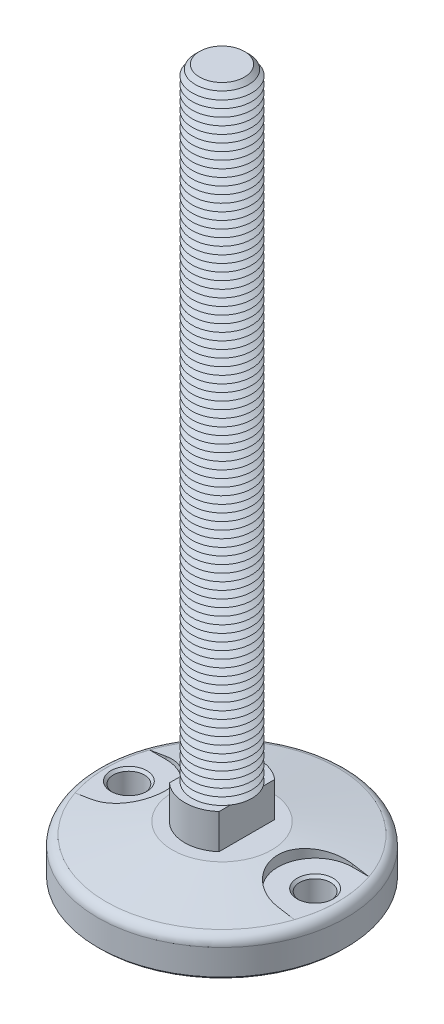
ISO-10303-21;
HEADER;
FILE_DESCRIPTION(('STEP AP214'),'2;1');
FILE_NAME('part.step','',(''),(''),'','','');
FILE_SCHEMA(('AUTOMOTIVE_DESIGN { 1 0 10303 214 1 1 1 1 }'));
ENDSEC;
DATA;
#1=APPLICATION_CONTEXT('core data for automotive mechanical design processes');
#2=APPLICATION_PROTOCOL_DEFINITION('international standard','automotive_design',2000,#1);
#3=PRODUCT_CONTEXT('',#1,'mechanical');
#4=PRODUCT('Part','Part','',(#3));
#5=PRODUCT_RELATED_PRODUCT_CATEGORY('part','',(#4));
#6=PRODUCT_DEFINITION_FORMATION('','',#4);
#7=PRODUCT_DEFINITION_CONTEXT('part definition',#1,'design');
#8=PRODUCT_DEFINITION('design','',#6,#7);
#9=PRODUCT_DEFINITION_SHAPE('','',#8);
#10=(LENGTH_UNIT() NAMED_UNIT(*) SI_UNIT(.MILLI.,.METRE.));
#11=(NAMED_UNIT(*) PLANE_ANGLE_UNIT() SI_UNIT($,.RADIAN.));
#12=(NAMED_UNIT(*) SI_UNIT($,.STERADIAN.) SOLID_ANGLE_UNIT());
#13=UNCERTAINTY_MEASURE_WITH_UNIT(LENGTH_MEASURE(1.E-05),#10,'distance_accuracy_value','');
#14=(GEOMETRIC_REPRESENTATION_CONTEXT(3) GLOBAL_UNCERTAINTY_ASSIGNED_CONTEXT((#13)) GLOBAL_UNIT_ASSIGNED_CONTEXT((#10,
#11,#12)) REPRESENTATION_CONTEXT('',''));
#15=CARTESIAN_POINT('',(0.,0.,0.));
#16=DIRECTION('',(0.,0.,1.));
#17=DIRECTION('',(1.,0.,0.));
#18=AXIS2_PLACEMENT_3D('',#15,#16,#17);
#19=CARTESIAN_POINT('',(0.,0.,0.));
#20=DIRECTION('',(0.,-1.,0.));
#21=DIRECTION('',(0.,0.,-1.));
#22=AXIS2_PLACEMENT_3D('',#19,#20,#21);
#23=CONICAL_SURFACE('',#22,20.,1.39626340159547);
#24=CARTESIAN_POINT('',(-37.5002,-3.59511701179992,14.9999999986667));
#25=CARTESIAN_POINT('',(-37.071618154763,-3.52495922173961,15.0000502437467));
#26=CARTESIAN_POINT('',(-36.6432161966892,-3.45377973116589,14.9816452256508));
#27=CARTESIAN_POINT('',(-35.7898597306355,-3.30975397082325,14.9083347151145));
#28=CARTESIAN_POINT('',(-35.3649049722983,-3.23690782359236,14.8534318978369));
#29=CARTESIAN_POINT('',(-34.5217702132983,-3.0899678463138,14.7075882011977));
#30=CARTESIAN_POINT('',(-34.1035855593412,-3.0158749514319,14.6166732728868));
#31=CARTESIAN_POINT('',(-33.276654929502,-2.86680950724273,14.3995164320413));
#32=CARTESIAN_POINT('',(-32.8679089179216,-2.79183696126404,14.2732746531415));
#33=CARTESIAN_POINT('',(-32.0626157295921,-2.64144796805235,13.9863372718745));
#34=CARTESIAN_POINT('',(-31.6660727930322,-2.56603137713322,13.8256298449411));
#35=CARTESIAN_POINT('',(-30.8881421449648,-2.41529591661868,13.4709346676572));
#36=CARTESIAN_POINT('',(-30.5067544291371,-2.33997704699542,13.276946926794));
#37=CARTESIAN_POINT('',(-29.7618852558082,-2.19002394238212,12.8570734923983));
#38=CARTESIAN_POINT('',(-29.3984015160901,-2.11538962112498,12.6311918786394));
#39=CARTESIAN_POINT('',(-28.6918747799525,-1.96744405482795,12.1490672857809));
#40=CARTESIAN_POINT('',(-28.3488317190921,-1.89413280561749,11.8928244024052));
#41=CARTESIAN_POINT('',(-27.68528276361,-1.7494825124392,11.3514262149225));
#42=CARTESIAN_POINT('',(-27.3648018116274,-1.67814570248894,11.0662397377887));
#43=CARTESIAN_POINT('',(-26.7491189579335,-1.5383468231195,10.4691194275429));
#44=CARTESIAN_POINT('',(-26.4539171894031,-1.46988476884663,10.1571854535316));
#45=CARTESIAN_POINT('',(-25.89093801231,-1.33673920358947,9.50863296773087));
#46=CARTESIAN_POINT('',(-25.6231651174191,-1.27205631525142,9.172010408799));
#47=CARTESIAN_POINT('',(-25.1171410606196,-1.14749043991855,8.47642452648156));
#48=CARTESIAN_POINT('',(-24.8788895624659,-1.08760739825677,8.11746145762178));
#49=CARTESIAN_POINT('',(-24.4362735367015,-0.974368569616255,7.38380225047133));
#50=CARTESIAN_POINT('',(-24.2315599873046,-0.920947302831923,7.009326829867));
#51=CARTESIAN_POINT('',(-23.8544760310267,-0.820970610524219,6.24354239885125));
#52=CARTESIAN_POINT('',(-23.6821054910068,-0.774415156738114,5.85223345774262));
#53=CARTESIAN_POINT('',(-23.3712027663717,-0.689292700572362,5.05567287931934));
#54=CARTESIAN_POINT('',(-23.2326612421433,-0.650723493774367,4.65042512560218));
#55=CARTESIAN_POINT('',(-22.9905836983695,-0.582602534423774,3.82886542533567));
#56=CARTESIAN_POINT('',(-22.8870466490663,-0.553050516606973,3.41255380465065));
#57=CARTESIAN_POINT('',(-22.7185202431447,-0.504595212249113,2.58473472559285));
#58=CARTESIAN_POINT('',(-22.6524606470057,-0.485397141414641,2.17346220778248));
#59=CARTESIAN_POINT('',(-22.5547584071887,-0.456903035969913,1.34650988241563));
#60=CARTESIAN_POINT('',(-22.5231150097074,-0.447606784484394,0.930830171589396));
#61=CARTESIAN_POINT('',(-22.4945397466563,-0.439214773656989,0.0982343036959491));
#62=CARTESIAN_POINT('',(-22.4976030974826,-0.440117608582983,-0.318681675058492));
#63=CARTESIAN_POINT('',(-22.5384014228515,-0.452091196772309,-1.15066338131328));
#64=CARTESIAN_POINT('',(-22.5761359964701,-0.463161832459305,-1.56572913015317));
#65=CARTESIAN_POINT('',(-22.684465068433,-0.494692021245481,-2.37993589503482));
#66=CARTESIAN_POINT('',(-22.7541599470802,-0.514894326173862,-2.77920702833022));
#67=CARTESIAN_POINT('',(-22.9254719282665,-0.564017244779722,-3.57028216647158));
#68=CARTESIAN_POINT('',(-23.0270883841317,-0.59293768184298,-3.96208632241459));
#69=CARTESIAN_POINT('',(-23.2614195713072,-0.658733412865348,-4.7356274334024));
#70=CARTESIAN_POINT('',(-23.3941371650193,-0.695609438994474,-5.11736345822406));
#71=CARTESIAN_POINT('',(-23.6896243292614,-0.77643223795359,-5.86824656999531));
#72=CARTESIAN_POINT('',(-23.8523945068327,-0.820379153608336,-6.23739340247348));
#73=CARTESIAN_POINT('',(-24.2096654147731,-0.91517964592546,-6.96667519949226));
#74=CARTESIAN_POINT('',(-24.4046414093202,-0.966134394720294,-7.32656415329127));
#75=CARTESIAN_POINT('',(-24.8229317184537,-1.07340641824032,-8.02863083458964));
#76=CARTESIAN_POINT('',(-25.0462462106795,-1.12972372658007,-8.37080845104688));
#77=CARTESIAN_POINT('',(-25.5196353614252,-1.24678782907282,-9.03533577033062));
#78=CARTESIAN_POINT('',(-25.7697111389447,-1.30753480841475,-9.35768464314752));
#79=CARTESIAN_POINT('',(-26.2948980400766,-1.43258611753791,-9.98056367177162));
#80=CARTESIAN_POINT('',(-26.5700098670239,-1.4968905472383,-10.2810932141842));
#81=CARTESIAN_POINT('',(-27.1529305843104,-1.63043794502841,-10.8680655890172));
#82=CARTESIAN_POINT('',(-27.4615208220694,-1.69977394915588,-11.1537117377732));
#83=CARTESIAN_POINT('',(-28.101294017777,-1.84060155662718,-11.6978928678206));
#84=CARTESIAN_POINT('',(-28.4324776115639,-1.91209322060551,-11.9564270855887));
#85=CARTESIAN_POINT('',(-29.1152826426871,-2.05655312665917,-12.4447886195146));
#86=CARTESIAN_POINT('',(-29.4669124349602,-2.12952196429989,-12.6746040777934));
#87=CARTESIAN_POINT('',(-30.1880609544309,-2.27627325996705,-13.1038783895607));
#88=CARTESIAN_POINT('',(-30.5575792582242,-2.35005569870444,-13.303337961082));
#89=CARTESIAN_POINT('',(-31.3189196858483,-2.49923001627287,-13.6739446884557));
#90=CARTESIAN_POINT('',(-31.7110266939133,-2.5746265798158,-13.8445050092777));
#91=CARTESIAN_POINT('',(-32.5084114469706,-2.72514849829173,-14.1515569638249));
#92=CARTESIAN_POINT('',(-32.9136891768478,-2.80027385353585,-14.2880486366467));
#93=CARTESIAN_POINT('',(-33.7340205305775,-2.94968142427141,-14.5258238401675));
#94=CARTESIAN_POINT('',(-34.1490613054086,-3.02396457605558,-14.6271511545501));
#95=CARTESIAN_POINT('',(-34.9863081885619,-3.17132754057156,-14.7940335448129));
#96=CARTESIAN_POINT('',(-35.4085107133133,-3.24440792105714,-14.8596059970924));
#97=CARTESIAN_POINT('',(-36.1096790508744,-3.36387020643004,-14.9380274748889));
#98=CARTESIAN_POINT('',(-36.3874461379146,-3.41070654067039,-14.9612791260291));
#99=CARTESIAN_POINT('',(-36.943509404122,-3.50354098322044,-14.9922564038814));
#100=CARTESIAN_POINT('',(-37.2218039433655,-3.54954035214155,-15.0000076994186));
#101=CARTESIAN_POINT('',(-37.5002,-3.59511701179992,-14.9999999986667));
#102=B_SPLINE_CURVE_WITH_KNOTS('',3,(#24,#25,#26,#27,#28,#29,#30,#31,#32,#33,#34,#35,#36,#37,
#38,#39,#40,#41,#42,#43,#44,#45,#46,#47,#48,#49,#50,#51,#52,#53,#54,#55,#56,#57,#58,#59,#60,#61,
#62,#63,#64,#65,#66,#67,#68,#69,#70,#71,#72,#73,#74,#75,#76,#77,#78,#79,#80,#81,#82,#83,#84,#85,
#86,#87,#88,#89,#90,#91,#92,#93,#94,#95,#96,#97,#98,#99,#100,#101),.UNSPECIFIED.,.F.,.F.,(4,2,2,
2,2,2,2,2,2,2,2,2,2,2,2,2,2,2,2,2,2,2,2,2,2,2,2,2,2,2,2,2,2,2,2,2,2,2,4),(0.,1.30244924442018,
2.60480303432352,3.90622002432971,5.20763209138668,6.50949136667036,7.81135027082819,
9.11304279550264,10.4147312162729,11.7178367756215,13.0209491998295,14.3242757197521,
15.6275873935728,16.9163305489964,18.205068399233,19.4934500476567,20.7817937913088,
22.0312084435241,23.2805957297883,24.5298108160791,25.779011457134,26.9950246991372,
28.2110133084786,29.4271138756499,30.6432390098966,31.8792469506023,33.1152626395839,
34.3513300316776,35.5874321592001,36.864491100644,38.1415859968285,39.4192064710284,
40.6967967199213,41.9978357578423,43.2988733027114,44.5982850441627,45.8970647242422,
46.7446059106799,47.590742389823),.UNSPECIFIED.);
#103=CARTESIAN_POINT('',(-37.5,-3.59508426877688,15.));
#104=VERTEX_POINT('',#103);
#105=CARTESIAN_POINT('',(-37.5,-3.59508426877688,-15.));
#106=VERTEX_POINT('',#105);
#107=EDGE_CURVE('E943',#104,#106,#102,.T.);
#108=ORIENTED_EDGE('',*,*,#107,.F.);
#109=CARTESIAN_POINT('',(-58.7331838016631,-7.16211468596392,15.));
#110=CARTESIAN_POINT('',(-57.4400366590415,-6.941199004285,15.));
#111=CARTESIAN_POINT('',(-56.1468183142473,-6.72069896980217,15.));
#112=CARTESIAN_POINT('',(-53.5602019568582,-6.2807555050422,15.));
#113=CARTESIAN_POINT('',(-52.2668039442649,-6.06131207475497,15.));
#114=CARTESIAN_POINT('',(-49.6798066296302,-5.62370977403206,15.));
#115=CARTESIAN_POINT('',(-48.3862073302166,-5.40555088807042,15.));
#116=CARTESIAN_POINT('',(-45.7987405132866,-4.97082983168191,15.));
#117=CARTESIAN_POINT('',(-44.5048729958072,-4.75426766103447,15.));
#118=CARTESIAN_POINT('',(-41.9167872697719,-4.32315417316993,15.));
#119=CARTESIAN_POINT('',(-40.6225690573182,-4.10860287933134,15.));
#120=CARTESIAN_POINT('',(-38.0337081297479,-3.68208609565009,15.));
#121=CARTESIAN_POINT('',(-36.7390654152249,-3.47012060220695,15.));
#122=CARTESIAN_POINT('',(-34.1492138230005,-3.04956665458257,15.));
#123=CARTESIAN_POINT('',(-32.854004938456,-2.84097824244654,15.));
#124=CARTESIAN_POINT('',(-30.9106470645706,-2.53149468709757,15.));
#125=CARTESIAN_POINT('',(-30.2627688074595,-2.4288997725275,15.));
#126=CARTESIAN_POINT('',(-28.9668013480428,-2.22504633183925,15.));
#127=CARTESIAN_POINT('',(-28.3187121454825,-2.12378780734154,15.));
#128=CARTESIAN_POINT('',(-27.6705030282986,-2.02329919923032,15.));
#129=B_SPLINE_CURVE_WITH_KNOTS('',3,(#109,#110,#111,#112,#113,#114,#115,#116,#117,#118,#119,
#120,#121,#122,#123,#124,#125,#126,#127,#128),.UNSPECIFIED.,.F.,.F.,(4,2,2,2,2,2,2,2,2,4),(0.,
3.93564494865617,7.87128985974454,11.8068871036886,15.7424838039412,19.6781262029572,
23.6137631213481,27.5494490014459,29.5173013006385,31.4851559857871),.UNSPECIFIED.);
#130=CARTESIAN_POINT('',(-44.1779505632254,-4.7,15.));
#131=VERTEX_POINT('',#130);
#132=EDGE_CURVE('E917',#131,#104,#129,.T.);
#133=ORIENTED_EDGE('',*,*,#132,.F.);
#134=CARTESIAN_POINT('',(0.,-4.7,0.));
#135=DIRECTION('',(0.,1.,0.));
#136=DIRECTION('',(0.,0.,1.));
#137=AXIS2_PLACEMENT_3D('',#134,#135,#136);
#138=CIRCLE('',#137,46.6550245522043);
#139=CARTESIAN_POINT('',(-44.1779505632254,-4.7,-15.));
#140=VERTEX_POINT('',#139);
#141=EDGE_CURVE('E901',#131,#140,#138,.F.);
#142=ORIENTED_EDGE('',*,*,#141,.T.);
#143=CARTESIAN_POINT('',(-27.6705030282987,-2.02329919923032,-15.));
#144=CARTESIAN_POINT('',(-28.3187121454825,-2.12378780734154,-15.));
#145=CARTESIAN_POINT('',(-28.9668013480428,-2.22504633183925,-15.));
#146=CARTESIAN_POINT('',(-30.2627688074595,-2.4288997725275,-15.));
#147=CARTESIAN_POINT('',(-30.9106470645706,-2.53149468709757,-15.));
#148=CARTESIAN_POINT('',(-32.854004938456,-2.84097824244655,-15.));
#149=CARTESIAN_POINT('',(-34.1492138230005,-3.04956665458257,-15.));
#150=CARTESIAN_POINT('',(-36.7390654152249,-3.47012060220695,-15.));
#151=CARTESIAN_POINT('',(-38.033708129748,-3.68208609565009,-15.));
#152=CARTESIAN_POINT('',(-40.6225690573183,-4.10860287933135,-15.));
#153=CARTESIAN_POINT('',(-41.9167872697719,-4.32315417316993,-15.));
#154=CARTESIAN_POINT('',(-44.5048729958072,-4.75426766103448,-15.));
#155=CARTESIAN_POINT('',(-45.7987405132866,-4.97082983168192,-15.));
#156=CARTESIAN_POINT('',(-48.3862073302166,-5.40555088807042,-15.));
#157=CARTESIAN_POINT('',(-49.6798066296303,-5.62370977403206,-15.));
#158=CARTESIAN_POINT('',(-52.2668039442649,-6.06131207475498,-15.));
#159=CARTESIAN_POINT('',(-53.5602019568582,-6.28075550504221,-15.));
#160=CARTESIAN_POINT('',(-56.1468183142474,-6.72069896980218,-15.));
#161=CARTESIAN_POINT('',(-57.4400366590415,-6.941199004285,-15.));
#162=CARTESIAN_POINT('',(-58.7331838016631,-7.16211468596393,-15.));
#163=B_SPLINE_CURVE_WITH_KNOTS('',3,(#143,#144,#145,#146,#147,#148,#149,#150,#151,#152,#153,
#154,#155,#156,#157,#158,#159,#160,#161,#162),.UNSPECIFIED.,.F.,.F.,(4,2,2,2,2,2,2,2,2,4),(0.,
1.96785468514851,3.93570698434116,7.87139286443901,11.8070297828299,15.7426721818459,
19.6782688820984,23.6138661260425,27.5495110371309,31.4851559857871),.UNSPECIFIED.);
#164=EDGE_CURVE('E909',#106,#140,#163,.T.);
#165=ORIENTED_EDGE('',*,*,#164,.F.);
#166=EDGE_LOOP('',(#108,#133,#142,#165));
#167=FACE_BOUND('',#166,.T.);
#168=CARTESIAN_POINT('',(0.,-4.70697693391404,0.));
#169=DIRECTION('',(0.,1.,0.));
#170=DIRECTION('',(0.,0.,1.));
#171=AXIS2_PLACEMENT_3D('',#168,#169,#170);
#172=CIRCLE('',#171,46.6945927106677);
#173=CARTESIAN_POINT('',(0.,-4.70697693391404,46.6945927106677));
#174=VERTEX_POINT('',#173);
#175=EDGE_CURVE('E890',#174,#174,#172,.T.);
#176=ORIENTED_EDGE('',*,*,#175,.T.);
#177=EDGE_LOOP('',(#176));
#178=FACE_BOUND('',#177,.T.);
#179=CARTESIAN_POINT('',(0.,0.,0.));
#180=DIRECTION('',(0.,1.,0.));
#181=DIRECTION('',(0.,0.,1.));
#182=AXIS2_PLACEMENT_3D('',#179,#180,#181);
#183=CIRCLE('',#182,20.);
#184=CARTESIAN_POINT('',(0.,0.,20.));
#185=VERTEX_POINT('',#184);
#186=EDGE_CURVE('E886',#185,#185,#183,.T.);
#187=ORIENTED_EDGE('',*,*,#186,.F.);
#188=EDGE_LOOP('',(#187));
#189=FACE_BOUND('',#188,.T.);
#190=CARTESIAN_POINT('',(53.8330700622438,-6.32728263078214,15.));
#191=CARTESIAN_POINT('',(52.5396994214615,-6.10761035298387,15.));
#192=CARTESIAN_POINT('',(51.2462390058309,-5.88846451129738,15.));
#193=CARTESIAN_POINT('',(48.6590869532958,-5.45154457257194,15.));
#194=CARTESIAN_POINT('',(47.3653953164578,-5.23377047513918,15.));
#195=CARTESIAN_POINT('',(44.7777592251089,-4.79991793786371,15.));
#196=CARTESIAN_POINT('',(43.4838147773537,-4.58383945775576,15.));
#197=CARTESIAN_POINT('',(40.8955691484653,-4.15382985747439,15.));
#198=CARTESIAN_POINT('',(39.6012679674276,-3.93989873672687,15.));
#199=CARTESIAN_POINT('',(37.0121780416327,-3.51480066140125,15.));
#200=CARTESIAN_POINT('',(35.7173892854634,-3.30363377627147,15.));
#201=CARTESIAN_POINT('',(33.1272261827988,-2.88493970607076,15.));
#202=CARTESIAN_POINT('',(31.8318518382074,-2.67741250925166,15.));
#203=CARTESIAN_POINT('',(29.8881899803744,-2.36980627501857,15.));
#204=CARTESIAN_POINT('',(29.2401942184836,-2.2678836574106,15.));
#205=CARTESIAN_POINT('',(27.9439769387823,-2.06548679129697,15.));
#206=CARTESIAN_POINT('',(27.2957554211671,-1.96501254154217,15.));
#207=CARTESIAN_POINT('',(25.9990437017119,-1.76576366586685,15.));
#208=CARTESIAN_POINT('',(25.3505534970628,-1.66698905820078,15.));
#209=CARTESIAN_POINT('',(24.0532646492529,-1.47147446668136,15.));
#210=CARTESIAN_POINT('',(23.4044660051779,-1.37473448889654,15.));
#211=CARTESIAN_POINT('',(22.7554917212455,-1.27917906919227,15.));
#212=B_SPLINE_CURVE_WITH_KNOTS('',3,(#190,#191,#192,#193,#194,#195,#196,#197,#198,#199,#200,
#201,#202,#203,#204,#205,#206,#207,#208,#209,#210,#211),.UNSPECIFIED.,.F.,.F.,(4,2,2,2,2,2,2,2,
2,2,4),(0.,3.93567975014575,7.87135837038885,11.806943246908,15.7425270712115,19.6782095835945,
23.6138793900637,25.5817654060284,27.5496497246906,29.5175551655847,31.4854664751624),.UNSPECIFIED.);
#213=CARTESIAN_POINT('',(44.1779505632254,-4.7,15.));
#214=VERTEX_POINT('',#213);
#215=CARTESIAN_POINT('',(37.5,-3.59508426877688,15.));
#216=VERTEX_POINT('',#215);
#217=EDGE_CURVE('E133',#214,#216,#212,.T.);
#218=ORIENTED_EDGE('',*,*,#217,.T.);
#219=CARTESIAN_POINT('',(37.5002,-3.59511701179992,14.9999999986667));
#220=CARTESIAN_POINT('',(37.071618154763,-3.52495922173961,15.0000502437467));
#221=CARTESIAN_POINT('',(36.6432161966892,-3.45377973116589,14.9816452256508));
#222=CARTESIAN_POINT('',(35.7898597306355,-3.30975397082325,14.9083347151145));
#223=CARTESIAN_POINT('',(35.3649049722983,-3.23690782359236,14.8534318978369));
#224=CARTESIAN_POINT('',(34.5217702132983,-3.0899678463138,14.7075882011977));
#225=CARTESIAN_POINT('',(34.1035855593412,-3.0158749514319,14.6166732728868));
#226=CARTESIAN_POINT('',(33.276654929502,-2.86680950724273,14.3995164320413));
#227=CARTESIAN_POINT('',(32.8679089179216,-2.79183696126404,14.2732746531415));
#228=CARTESIAN_POINT('',(32.0626157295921,-2.64144796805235,13.9863372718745));
#229=CARTESIAN_POINT('',(31.6660727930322,-2.56603137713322,13.8256298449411));
#230=CARTESIAN_POINT('',(30.8881421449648,-2.41529591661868,13.4709346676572));
#231=CARTESIAN_POINT('',(30.5067544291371,-2.33997704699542,13.276946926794));
#232=CARTESIAN_POINT('',(29.7618852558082,-2.19002394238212,12.8570734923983));
#233=CARTESIAN_POINT('',(29.3984015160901,-2.11538962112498,12.6311918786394));
#234=CARTESIAN_POINT('',(28.6918747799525,-1.96744405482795,12.1490672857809));
#235=CARTESIAN_POINT('',(28.3488317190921,-1.89413280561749,11.8928244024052));
#236=CARTESIAN_POINT('',(27.68528276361,-1.7494825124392,11.3514262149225));
#237=CARTESIAN_POINT('',(27.3648018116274,-1.67814570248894,11.0662397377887));
#238=CARTESIAN_POINT('',(26.7491189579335,-1.5383468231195,10.4691194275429));
#239=CARTESIAN_POINT('',(26.4539171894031,-1.46988476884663,10.1571854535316));
#240=CARTESIAN_POINT('',(25.89093801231,-1.33673920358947,9.50863296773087));
#241=CARTESIAN_POINT('',(25.6231651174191,-1.27205631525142,9.172010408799));
#242=CARTESIAN_POINT('',(25.1171410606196,-1.14749043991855,8.47642452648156));
#243=CARTESIAN_POINT('',(24.8788895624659,-1.08760739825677,8.11746145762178));
#244=CARTESIAN_POINT('',(24.4362735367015,-0.974368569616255,7.38380225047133));
#245=CARTESIAN_POINT('',(24.2315599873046,-0.920947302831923,7.009326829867));
#246=CARTESIAN_POINT('',(23.8544760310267,-0.820970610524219,6.24354239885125));
#247=CARTESIAN_POINT('',(23.6821054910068,-0.774415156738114,5.85223345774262));
#248=CARTESIAN_POINT('',(23.3712027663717,-0.689292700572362,5.05567287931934));
#249=CARTESIAN_POINT('',(23.2326612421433,-0.650723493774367,4.65042512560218));
#250=CARTESIAN_POINT('',(22.9905836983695,-0.582602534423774,3.82886542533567));
#251=CARTESIAN_POINT('',(22.8870466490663,-0.553050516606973,3.41255380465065));
#252=CARTESIAN_POINT('',(22.7185202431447,-0.504595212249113,2.58473472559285));
#253=CARTESIAN_POINT('',(22.6524606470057,-0.485397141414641,2.17346220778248));
#254=CARTESIAN_POINT('',(22.5547584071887,-0.456903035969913,1.34650988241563));
#255=CARTESIAN_POINT('',(22.5231150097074,-0.447606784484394,0.930830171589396));
#256=CARTESIAN_POINT('',(22.4945397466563,-0.439214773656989,0.0982343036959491));
#257=CARTESIAN_POINT('',(22.4976030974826,-0.440117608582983,-0.318681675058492));
#258=CARTESIAN_POINT('',(22.5384014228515,-0.452091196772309,-1.15066338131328));
#259=CARTESIAN_POINT('',(22.5761359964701,-0.463161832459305,-1.56572913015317));
#260=CARTESIAN_POINT('',(22.684465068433,-0.494692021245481,-2.37993589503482));
#261=CARTESIAN_POINT('',(22.7541599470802,-0.514894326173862,-2.77920702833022));
#262=CARTESIAN_POINT('',(22.9254719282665,-0.564017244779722,-3.57028216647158));
#263=CARTESIAN_POINT('',(23.0270883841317,-0.59293768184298,-3.96208632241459));
#264=CARTESIAN_POINT('',(23.2614195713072,-0.658733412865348,-4.7356274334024));
#265=CARTESIAN_POINT('',(23.3941371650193,-0.695609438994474,-5.11736345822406));
#266=CARTESIAN_POINT('',(23.6896243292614,-0.77643223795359,-5.86824656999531));
#267=CARTESIAN_POINT('',(23.8523945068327,-0.820379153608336,-6.23739340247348));
#268=CARTESIAN_POINT('',(24.2096654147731,-0.91517964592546,-6.96667519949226));
#269=CARTESIAN_POINT('',(24.4046414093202,-0.966134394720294,-7.32656415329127));
#270=CARTESIAN_POINT('',(24.8229317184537,-1.07340641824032,-8.02863083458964));
#271=CARTESIAN_POINT('',(25.0462462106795,-1.12972372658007,-8.37080845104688));
#272=CARTESIAN_POINT('',(25.5196353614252,-1.24678782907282,-9.03533577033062));
#273=CARTESIAN_POINT('',(25.7697111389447,-1.30753480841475,-9.35768464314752));
#274=CARTESIAN_POINT('',(26.2948980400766,-1.43258611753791,-9.98056367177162));
#275=CARTESIAN_POINT('',(26.5700098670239,-1.4968905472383,-10.2810932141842));
#276=CARTESIAN_POINT('',(27.1529305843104,-1.63043794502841,-10.8680655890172));
#277=CARTESIAN_POINT('',(27.4615208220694,-1.69977394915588,-11.1537117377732));
#278=CARTESIAN_POINT('',(28.101294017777,-1.84060155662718,-11.6978928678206));
#279=CARTESIAN_POINT('',(28.4324776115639,-1.91209322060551,-11.9564270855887));
#280=CARTESIAN_POINT('',(29.1152826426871,-2.05655312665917,-12.4447886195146));
#281=CARTESIAN_POINT('',(29.4669124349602,-2.12952196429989,-12.6746040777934));
#282=CARTESIAN_POINT('',(30.1880609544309,-2.27627325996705,-13.1038783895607));
#283=CARTESIAN_POINT('',(30.5575792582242,-2.35005569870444,-13.303337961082));
#284=CARTESIAN_POINT('',(31.3189196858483,-2.49923001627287,-13.6739446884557));
#285=CARTESIAN_POINT('',(31.7110266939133,-2.5746265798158,-13.8445050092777));
#286=CARTESIAN_POINT('',(32.5084114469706,-2.72514849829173,-14.1515569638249));
#287=CARTESIAN_POINT('',(32.9136891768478,-2.80027385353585,-14.2880486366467));
#288=CARTESIAN_POINT('',(33.7340205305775,-2.94968142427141,-14.5258238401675));
#289=CARTESIAN_POINT('',(34.1490613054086,-3.02396457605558,-14.6271511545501));
#290=CARTESIAN_POINT('',(34.9863081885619,-3.17132754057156,-14.7940335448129));
#291=CARTESIAN_POINT('',(35.4085107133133,-3.24440792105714,-14.8596059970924));
#292=CARTESIAN_POINT('',(36.1096790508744,-3.36387020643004,-14.9380274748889));
#293=CARTESIAN_POINT('',(36.3874461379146,-3.41070654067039,-14.9612791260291));
#294=CARTESIAN_POINT('',(36.943509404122,-3.50354098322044,-14.9922564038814));
#295=CARTESIAN_POINT('',(37.2218039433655,-3.54954035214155,-15.0000076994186));
#296=CARTESIAN_POINT('',(37.5002,-3.59511701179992,-14.9999999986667));
#297=B_SPLINE_CURVE_WITH_KNOTS('',3,(#219,#220,#221,#222,#223,#224,#225,#226,#227,#228,#229,
#230,#231,#232,#233,#234,#235,#236,#237,#238,#239,#240,#241,#242,#243,#244,#245,#246,#247,#248,
#249,#250,#251,#252,#253,#254,#255,#256,#257,#258,#259,#260,#261,#262,#263,#264,#265,#266,#267,
#268,#269,#270,#271,#272,#273,#274,#275,#276,#277,#278,#279,#280,#281,#282,#283,#284,#285,#286,
#287,#288,#289,#290,#291,#292,#293,#294,#295,#296),.UNSPECIFIED.,.F.,.F.,(4,2,2,2,2,2,2,2,2,2,2,
2,2,2,2,2,2,2,2,2,2,2,2,2,2,2,2,2,2,2,2,2,2,2,2,2,2,2,4),(0.,1.30244924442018,2.60480303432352,
3.90622002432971,5.20763209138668,6.50949136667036,7.81135027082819,9.11304279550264,
10.4147312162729,11.7178367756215,13.0209491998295,14.3242757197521,15.6275873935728,
16.9163305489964,18.205068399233,19.4934500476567,20.7817937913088,22.0312084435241,
23.2805957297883,24.5298108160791,25.779011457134,26.9950246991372,28.2110133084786,
29.4271138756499,30.6432390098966,31.8792469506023,33.1152626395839,34.3513300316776,
35.5874321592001,36.864491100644,38.1415859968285,39.4192064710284,40.6967967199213,
41.9978357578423,43.2988733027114,44.5982850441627,45.8970647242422,46.7446059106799,
47.590742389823),.UNSPECIFIED.);
#298=CARTESIAN_POINT('',(37.5,-3.59508426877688,-15.));
#299=VERTEX_POINT('',#298);
#300=EDGE_CURVE('E145',#216,#299,#297,.T.);
#301=ORIENTED_EDGE('',*,*,#300,.T.);
#302=CARTESIAN_POINT('',(22.7554917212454,-1.27917906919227,-15.));
#303=CARTESIAN_POINT('',(23.4044660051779,-1.37473448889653,-15.));
#304=CARTESIAN_POINT('',(24.0532646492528,-1.47147446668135,-15.));
#305=CARTESIAN_POINT('',(25.3505534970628,-1.66698905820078,-15.));
#306=CARTESIAN_POINT('',(25.9990437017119,-1.76576366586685,-15.));
#307=CARTESIAN_POINT('',(27.2957554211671,-1.96501254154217,-15.));
#308=CARTESIAN_POINT('',(27.9439769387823,-2.06548679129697,-15.));
#309=CARTESIAN_POINT('',(29.2401942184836,-2.2678836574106,-15.));
#310=CARTESIAN_POINT('',(29.8881899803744,-2.36980627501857,-15.));
#311=CARTESIAN_POINT('',(31.8318518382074,-2.67741250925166,-15.));
#312=CARTESIAN_POINT('',(33.1272261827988,-2.88493970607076,-15.));
#313=CARTESIAN_POINT('',(35.7173892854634,-3.30363377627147,-15.));
#314=CARTESIAN_POINT('',(37.0121780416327,-3.51480066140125,-15.));
#315=CARTESIAN_POINT('',(39.6012679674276,-3.93989873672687,-15.));
#316=CARTESIAN_POINT('',(40.8955691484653,-4.1538298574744,-15.));
#317=CARTESIAN_POINT('',(43.4838147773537,-4.58383945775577,-15.));
#318=CARTESIAN_POINT('',(44.7777592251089,-4.79991793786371,-15.));
#319=CARTESIAN_POINT('',(47.3653953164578,-5.23377047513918,-15.));
#320=CARTESIAN_POINT('',(48.6590869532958,-5.45154457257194,-15.));
#321=CARTESIAN_POINT('',(51.2462390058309,-5.88846451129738,-15.));
#322=CARTESIAN_POINT('',(52.5396994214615,-6.10761035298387,-15.));
#323=CARTESIAN_POINT('',(53.8330700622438,-6.32728263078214,-15.));
#324=B_SPLINE_CURVE_WITH_KNOTS('',3,(#302,#303,#304,#305,#306,#307,#308,#309,#310,#311,#312,
#313,#314,#315,#316,#317,#318,#319,#320,#321,#322,#323),.UNSPECIFIED.,.F.,.F.,(4,2,2,2,2,2,2,2,
2,2,4),(0.,1.96791130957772,3.93581675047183,5.90370106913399,7.87158708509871,11.8072568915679,
15.7429394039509,19.6785232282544,23.6141081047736,27.5497867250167,31.4854664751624),.UNSPECIFIED.);
#325=CARTESIAN_POINT('',(44.1779505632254,-4.7,-15.));
#326=VERTEX_POINT('',#325);
#327=EDGE_CURVE('E973',#299,#326,#324,.T.);
#328=ORIENTED_EDGE('',*,*,#327,.T.);
#329=CARTESIAN_POINT('',(0.,-4.7,0.));
#330=DIRECTION('',(0.,1.,0.));
#331=DIRECTION('',(0.,0.,1.));
#332=AXIS2_PLACEMENT_3D('',#329,#330,#331);
#333=CIRCLE('',#332,46.6550245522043);
#334=EDGE_CURVE('E964',#326,#214,#333,.F.);
#335=ORIENTED_EDGE('',*,*,#334,.T.);
#336=EDGE_LOOP('',(#218,#301,#328,#335));
#337=FACE_BOUND('',#336,.T.);
#338=ADVANCED_FACE('F39',(#167,#178,#189,#337),#23,.T.);
#339=CARTESIAN_POINT('',(0.,14.,0.));
#340=DIRECTION('',(0.,1.,0.));
#341=DIRECTION('',(0.,0.,1.));
#342=AXIS2_PLACEMENT_3D('',#339,#340,#341);
#343=PLANE('',#342);
#344=CARTESIAN_POINT('',(0.,14.,0.));
#345=DIRECTION('',(0.,1.,0.));
#346=DIRECTION('',(0.,0.,1.));
#347=AXIS2_PLACEMENT_3D('',#344,#345,#346);
#348=CIRCLE('',#347,12.);
#349=CARTESIAN_POINT('',(9.99999999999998,14.,-6.63324958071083));
#350=VERTEX_POINT('',#349);
#351=CARTESIAN_POINT('',(-10.,14.,-6.6332495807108));
#352=VERTEX_POINT('',#351);
#353=EDGE_CURVE('E902',#350,#352,#348,.T.);
#354=ORIENTED_EDGE('',*,*,#353,.F.);
#355=DIRECTION('',(0.,0.,1.));
#356=VECTOR('',#355,1.);
#357=CARTESIAN_POINT('',(10.,14.,11.1803398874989));
#358=LINE('',#357,#356);
#359=CARTESIAN_POINT('',(10.,14.,-11.1803398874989));
#360=VERTEX_POINT('',#359);
#361=EDGE_CURVE('E865',#360,#350,#358,.T.);
#362=ORIENTED_EDGE('',*,*,#361,.F.);
#363=CARTESIAN_POINT('',(0.,14.,0.));
#364=DIRECTION('',(0.,1.,0.));
#365=DIRECTION('',(0.,0.,1.));
#366=AXIS2_PLACEMENT_3D('',#363,#364,#365);
#367=CIRCLE('',#366,15.);
#368=CARTESIAN_POINT('',(-10.,14.,-11.1803398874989));
#369=VERTEX_POINT('',#368);
#370=EDGE_CURVE('E879',#360,#369,#367,.T.);
#371=ORIENTED_EDGE('',*,*,#370,.T.);
#372=DIRECTION('',(0.,0.,-1.));
#373=VECTOR('',#372,1.);
#374=CARTESIAN_POINT('',(-10.,14.,-11.1803398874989));
#375=LINE('',#374,#373);
#376=EDGE_CURVE('E852',#352,#369,#375,.T.);
#377=ORIENTED_EDGE('',*,*,#376,.F.);
#378=EDGE_LOOP('',(#354,#362,#371,#377));
#379=FACE_BOUND('',#378,.T.);
#380=ADVANCED_FACE('F1028',(#379),#343,.T.);
#381=CARTESIAN_POINT('',(0.,14.,0.));
#382=DIRECTION('',(0.,-1.,0.));
#383=DIRECTION('',(0.,0.,-1.));
#384=AXIS2_PLACEMENT_3D('',#381,#382,#383);
#385=CYLINDRICAL_SURFACE('',#384,15.);
#386=CARTESIAN_POINT('',(-10.,14.,11.1803398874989));
#387=VERTEX_POINT('',#386);
#388=CARTESIAN_POINT('',(10.,14.,11.1803398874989));
#389=VERTEX_POINT('',#388);
#390=EDGE_CURVE('E857',#387,#389,#367,.T.);
#391=ORIENTED_EDGE('',*,*,#390,.F.);
#392=DIRECTION('',(0.,1.,0.));
#393=VECTOR('',#392,1.);
#394=CARTESIAN_POINT('',(-10.,0.,11.1803398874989));
#395=LINE('',#394,#393);
#396=CARTESIAN_POINT('',(-10.,0.,11.1803398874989));
#397=VERTEX_POINT('',#396);
#398=EDGE_CURVE('E846',#397,#387,#395,.T.);
#399=ORIENTED_EDGE('',*,*,#398,.F.);
#400=CARTESIAN_POINT('',(0.,0.,0.));
#401=DIRECTION('',(0.,1.,0.));
#402=DIRECTION('',(0.,0.,1.));
#403=AXIS2_PLACEMENT_3D('',#400,#401,#402);
#404=CIRCLE('',#403,15.);
#405=CARTESIAN_POINT('',(10.,0.,11.1803398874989));
#406=VERTEX_POINT('',#405);
#407=EDGE_CURVE('E880',#397,#406,#404,.T.);
#408=ORIENTED_EDGE('',*,*,#407,.T.);
#409=DIRECTION('',(0.,1.,0.));
#410=VECTOR('',#409,1.);
#411=CARTESIAN_POINT('',(10.,0.,11.1803398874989));
#412=LINE('',#411,#410);
#413=EDGE_CURVE('E870',#406,#389,#412,.T.);
#414=ORIENTED_EDGE('',*,*,#413,.T.);
#415=EDGE_LOOP('',(#391,#399,#408,#414));
#416=FACE_BOUND('',#415,.T.);
#417=ADVANCED_FACE('F1033',(#416),#385,.T.);
#418=CARTESIAN_POINT('',(0.,0.,0.));
#419=DIRECTION('',(0.,1.,0.));
#420=DIRECTION('',(0.,0.,1.));
#421=AXIS2_PLACEMENT_3D('',#418,#419,#420);
#422=PLANE('',#421);
#423=CARTESIAN_POINT('',(10.,0.,-11.1803398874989));
#424=VERTEX_POINT('',#423);
#425=CARTESIAN_POINT('',(-10.,0.,-11.1803398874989));
#426=VERTEX_POINT('',#425);
#427=EDGE_CURVE('E884',#424,#426,#404,.T.);
#428=ORIENTED_EDGE('',*,*,#427,.F.);
#429=DIRECTION('',(0.,0.,1.));
#430=VECTOR('',#429,1.);
#431=CARTESIAN_POINT('',(10.,0.,11.1803398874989));
#432=LINE('',#431,#430);
#433=EDGE_CURVE('E860',#424,#406,#432,.T.);
#434=ORIENTED_EDGE('',*,*,#433,.T.);
#435=ORIENTED_EDGE('',*,*,#407,.F.);
#436=DIRECTION('',(0.,0.,-1.));
#437=VECTOR('',#436,1.);
#438=CARTESIAN_POINT('',(-10.,0.,-11.1803398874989));
#439=LINE('',#438,#437);
#440=EDGE_CURVE('E842',#397,#426,#439,.T.);
#441=ORIENTED_EDGE('',*,*,#440,.T.);
#442=EDGE_LOOP('',(#428,#434,#435,#441));
#443=FACE_BOUND('',#442,.T.);
#444=ORIENTED_EDGE('',*,*,#186,.T.);
#445=EDGE_LOOP('',(#444));
#446=FACE_BOUND('',#445,.T.);
#447=ADVANCED_FACE('F1136',(#443,#446),#422,.T.);
#448=CARTESIAN_POINT('',(0.,61.3388655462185,0.));
#449=DIRECTION('',(0.,1.,0.));
#450=DIRECTION('',(0.,0.,1.));
#451=AXIS2_PLACEMENT_3D('',#448,#449,#450);
#452=CYLINDRICAL_SURFACE('',#451,50.);
#453=CARTESIAN_POINT('',(0.,-19.,0.));
#454=DIRECTION('',(0.,-1.,0.));
#455=DIRECTION('',(0.,0.,-1.));
#456=AXIS2_PLACEMENT_3D('',#453,#454,#455);
#457=CIRCLE('',#456,50.);
#458=CARTESIAN_POINT('',(0.,-19.,-50.));
#459=VERTEX_POINT('',#458);
#460=EDGE_CURVE('E48',#459,#459,#457,.F.);
#461=ORIENTED_EDGE('',*,*,#460,.T.);
#462=EDGE_LOOP('',(#461));
#463=FACE_BOUND('',#462,.T.);
#464=CARTESIAN_POINT('',(0.,-8.64620794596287,0.));
#465=DIRECTION('',(0.,-1.,0.));
#466=DIRECTION('',(0.,0.,-1.));
#467=AXIS2_PLACEMENT_3D('',#464,#465,#466);
#468=CIRCLE('',#467,50.);
#469=CARTESIAN_POINT('',(0.,-8.64620794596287,-50.));
#470=VERTEX_POINT('',#469);
#471=EDGE_CURVE('E885',#470,#470,#468,.T.);
#472=ORIENTED_EDGE('',*,*,#471,.T.);
#473=EDGE_LOOP('',(#472));
#474=FACE_BOUND('',#473,.T.);
#475=ADVANCED_FACE('F1015',(#463,#474),#452,.T.);
#476=CARTESIAN_POINT('',(0.,-20.,50.));
#477=DIRECTION('',(0.,-1.,0.));
#478=DIRECTION('',(0.,0.,-1.));
#479=AXIS2_PLACEMENT_3D('',#476,#477,#478);
#480=PLANE('',#479);
#481=CARTESIAN_POINT('',(0.,-20.,0.));
#482=DIRECTION('',(0.,-1.,0.));
#483=DIRECTION('',(0.,0.,-1.));
#484=AXIS2_PLACEMENT_3D('',#481,#482,#483);
#485=CIRCLE('',#484,49.);
#486=CARTESIAN_POINT('',(0.,-20.,-49.));
#487=VERTEX_POINT('',#486);
#488=EDGE_CURVE('E11',#487,#487,#485,.T.);
#489=ORIENTED_EDGE('',*,*,#488,.T.);
#490=EDGE_LOOP('',(#489));
#491=FACE_BOUND('',#490,.T.);
#492=CARTESIAN_POINT('',(37.5,-20.,0.));
#493=DIRECTION('',(0.,-1.,0.));
#494=DIRECTION('',(0.,0.,-1.));
#495=AXIS2_PLACEMENT_3D('',#492,#493,#494);
#496=CIRCLE('',#495,7.25000000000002);
#497=CARTESIAN_POINT('',(37.5,-20.,-7.25000000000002));
#498=VERTEX_POINT('',#497);
#499=EDGE_CURVE('E1003',#498,#498,#496,.F.);
#500=ORIENTED_EDGE('',*,*,#499,.T.);
#501=EDGE_LOOP('',(#500));
#502=FACE_BOUND('',#501,.T.);
#503=CARTESIAN_POINT('',(-37.5,-20.,0.));
#504=DIRECTION('',(0.,-1.,0.));
#505=DIRECTION('',(0.,0.,-1.));
#506=AXIS2_PLACEMENT_3D('',#503,#504,#505);
#507=CIRCLE('',#506,7.24999999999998);
#508=CARTESIAN_POINT('',(-37.5,-20.,-7.24999999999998));
#509=VERTEX_POINT('',#508);
#510=EDGE_CURVE('E949',#509,#509,#507,.F.);
#511=ORIENTED_EDGE('',*,*,#510,.T.);
#512=EDGE_LOOP('',(#511));
#513=FACE_BOUND('',#512,.T.);
#514=ADVANCED_FACE('F1120',(#491,#502,#513),#480,.T.);
#515=CARTESIAN_POINT('',(0.,-8.64620794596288,0.));
#516=DIRECTION('',(0.,-1.,0.));
#517=DIRECTION('',(0.,0.,-1.));
#518=AXIS2_PLACEMENT_3D('',#515,#516,#517);
#519=TOROIDAL_SURFACE('',#518,46.,4.);
#520=ORIENTED_EDGE('',*,*,#471,.F.);
#521=EDGE_LOOP('',(#520));
#522=FACE_BOUND('',#521,.T.);
#523=ORIENTED_EDGE('',*,*,#175,.F.);
#524=EDGE_LOOP('',(#523));
#525=FACE_BOUND('',#524,.T.);
#526=ADVANCED_FACE('F1125',(#522,#525),#519,.T.);
#527=ORIENTED_EDGE('',*,*,#427,.T.);
#528=DIRECTION('',(0.,1.,0.));
#529=VECTOR('',#528,1.);
#530=CARTESIAN_POINT('',(-10.,0.,-11.1803398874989));
#531=LINE('',#530,#529);
#532=EDGE_CURVE('E853',#426,#369,#531,.T.);
#533=ORIENTED_EDGE('',*,*,#532,.T.);
#534=ORIENTED_EDGE('',*,*,#370,.F.);
#535=DIRECTION('',(0.,1.,0.));
#536=VECTOR('',#535,1.);
#537=CARTESIAN_POINT('',(10.,0.,-11.1803398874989));
#538=LINE('',#537,#536);
#539=EDGE_CURVE('E864',#424,#360,#538,.T.);
#540=ORIENTED_EDGE('',*,*,#539,.F.);
#541=EDGE_LOOP('',(#527,#533,#534,#540));
#542=FACE_BOUND('',#541,.T.);
#543=ADVANCED_FACE('F1155',(#542),#385,.T.);
#544=CARTESIAN_POINT('',(-10.,14.,6.6332495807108));
#545=VERTEX_POINT('',#544);
#546=CARTESIAN_POINT('',(10.,14.,6.6332495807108));
#547=VERTEX_POINT('',#546);
#548=EDGE_CURVE('E841',#545,#547,#348,.T.);
#549=ORIENTED_EDGE('',*,*,#548,.F.);
#550=EDGE_CURVE('E847',#387,#545,#375,.T.);
#551=ORIENTED_EDGE('',*,*,#550,.F.);
#552=ORIENTED_EDGE('',*,*,#390,.T.);
#553=EDGE_CURVE('E840',#547,#389,#358,.T.);
#554=ORIENTED_EDGE('',*,*,#553,.F.);
#555=EDGE_LOOP('',(#549,#551,#552,#554));
#556=FACE_BOUND('',#555,.T.);
#557=ADVANCED_FACE('F1036',(#556),#343,.T.);
#558=CARTESIAN_POINT('',(10.,0.,11.1803398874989));
#559=DIRECTION('',(-1.,0.,0.));
#560=DIRECTION('',(0.,0.,1.));
#561=AXIS2_PLACEMENT_3D('',#558,#559,#560);
#562=PLANE('',#561);
#563=ORIENTED_EDGE('',*,*,#361,.T.);
#564=EDGE_CURVE('E869',#350,#547,#358,.T.);
#565=ORIENTED_EDGE('',*,*,#564,.T.);
#566=ORIENTED_EDGE('',*,*,#553,.T.);
#567=ORIENTED_EDGE('',*,*,#413,.F.);
#568=ORIENTED_EDGE('',*,*,#433,.F.);
#569=ORIENTED_EDGE('',*,*,#539,.T.);
#570=EDGE_LOOP('',(#563,#565,#566,#567,#568,#569));
#571=FACE_BOUND('',#570,.T.);
#572=ADVANCED_FACE('F2763',(#571),#562,.F.);
#573=CARTESIAN_POINT('',(-10.,0.,-11.1803398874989));
#574=DIRECTION('',(1.,0.,0.));
#575=DIRECTION('',(0.,0.,-1.));
#576=AXIS2_PLACEMENT_3D('',#573,#574,#575);
#577=PLANE('',#576);
#578=ORIENTED_EDGE('',*,*,#550,.T.);
#579=EDGE_CURVE('E851',#545,#352,#375,.T.);
#580=ORIENTED_EDGE('',*,*,#579,.T.);
#581=ORIENTED_EDGE('',*,*,#376,.T.);
#582=ORIENTED_EDGE('',*,*,#532,.F.);
#583=ORIENTED_EDGE('',*,*,#440,.F.);
#584=ORIENTED_EDGE('',*,*,#398,.T.);
#585=EDGE_LOOP('',(#578,#580,#581,#582,#583,#584));
#586=FACE_BOUND('',#585,.T.);
#587=ADVANCED_FACE('F2755',(#586),#577,.F.);
#588=CARTESIAN_POINT('',(0.,14.,0.));
#589=DIRECTION('',(0.,1.,0.));
#590=DIRECTION('',(0.,0.,1.));
#591=AXIS2_PLACEMENT_3D('',#588,#589,#590);
#592=PLANE('',#591);
#593=ORIENTED_EDGE('',*,*,#579,.F.);
#594=EDGE_CURVE('E836',#352,#545,#348,.T.);
#595=ORIENTED_EDGE('',*,*,#594,.F.);
#596=EDGE_LOOP('',(#593,#595));
#597=FACE_BOUND('',#596,.T.);
#598=ADVANCED_FACE('F2746',(#597),#592,.F.);
#599=ORIENTED_EDGE('',*,*,#564,.F.);
#600=EDGE_CURVE('E837',#547,#350,#348,.T.);
#601=ORIENTED_EDGE('',*,*,#600,.F.);
#602=EDGE_LOOP('',(#599,#601));
#603=FACE_BOUND('',#602,.T.);
#604=ADVANCED_FACE('F2737',(#603),#592,.F.);
#605=CARTESIAN_POINT('',(0.,14.,0.));
#606=DIRECTION('',(0.,-1.,0.));
#607=DIRECTION('',(0.,0.,-1.));
#608=AXIS2_PLACEMENT_3D('',#605,#606,#607);
#609=CONICAL_SURFACE('',#608,12.,1.0471975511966);
#610=CARTESIAN_POINT('',(0.,15.5,0.));
#611=DIRECTION('',(0.,1.,0.));
#612=DIRECTION('',(0.,0.,1.));
#613=AXIS2_PLACEMENT_3D('',#610,#611,#612);
#614=CIRCLE('',#613,9.40192378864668);
#615=CARTESIAN_POINT('',(0.,15.5,9.40192378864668));
#616=VERTEX_POINT('',#615);
#617=EDGE_CURVE('E832',#616,#616,#614,.T.);
#618=ORIENTED_EDGE('',*,*,#617,.F.);
#619=EDGE_LOOP('',(#618));
#620=FACE_BOUND('',#619,.T.);
#621=ORIENTED_EDGE('',*,*,#600,.T.);
#622=ORIENTED_EDGE('',*,*,#353,.T.);
#623=ORIENTED_EDGE('',*,*,#594,.T.);
#624=ORIENTED_EDGE('',*,*,#548,.T.);
#625=EDGE_LOOP('',(#621,#622,#623,#624));
#626=FACE_BOUND('',#625,.T.);
#627=ADVANCED_FACE('F2728',(#620,#626),#609,.T.);
#628=CARTESIAN_POINT('',(0.,15.5,0.));
#629=DIRECTION('',(0.,1.,0.));
#630=DIRECTION('',(0.,0.,1.));
#631=AXIS2_PLACEMENT_3D('',#628,#629,#630);
#632=CONICAL_SURFACE('',#631,9.40192378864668,1.0471975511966);
#633=CARTESIAN_POINT('',(0.,17.,0.));
#634=DIRECTION('',(0.,1.,0.));
#635=DIRECTION('',(0.,0.,1.));
#636=AXIS2_PLACEMENT_3D('',#633,#634,#635);
#637=CIRCLE('',#636,12.);
#638=CARTESIAN_POINT('',(0.,17.,12.));
#639=VERTEX_POINT('',#638);
#640=EDGE_CURVE('E828',#639,#639,#637,.T.);
#641=ORIENTED_EDGE('',*,*,#640,.F.);
#642=EDGE_LOOP('',(#641));
#643=FACE_BOUND('',#642,.T.);
#644=ORIENTED_EDGE('',*,*,#617,.T.);
#645=EDGE_LOOP('',(#644));
#646=FACE_BOUND('',#645,.T.);
#647=ADVANCED_FACE('F2719',(#643,#646),#632,.T.);
#648=CARTESIAN_POINT('',(0.,17.,0.));
#649=DIRECTION('',(0.,-1.,0.));
#650=DIRECTION('',(0.,0.,-1.));
#651=AXIS2_PLACEMENT_3D('',#648,#649,#650);
#652=CONICAL_SURFACE('',#651,12.,1.0471975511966);
#653=CARTESIAN_POINT('',(0.,18.5,0.));
#654=DIRECTION('',(0.,1.,0.));
#655=DIRECTION('',(0.,0.,1.));
#656=AXIS2_PLACEMENT_3D('',#653,#654,#655);
#657=CIRCLE('',#656,9.40192378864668);
#658=CARTESIAN_POINT('',(0.,18.5,9.40192378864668));
#659=VERTEX_POINT('',#658);
#660=EDGE_CURVE('E824',#659,#659,#657,.T.);
#661=ORIENTED_EDGE('',*,*,#660,.F.);
#662=EDGE_LOOP('',(#661));
#663=FACE_BOUND('',#662,.T.);
#664=ORIENTED_EDGE('',*,*,#640,.T.);
#665=EDGE_LOOP('',(#664));
#666=FACE_BOUND('',#665,.T.);
#667=ADVANCED_FACE('F2710',(#663,#666),#652,.T.);
#668=CARTESIAN_POINT('',(0.,18.5,0.));
#669=DIRECTION('',(0.,1.,0.));
#670=DIRECTION('',(0.,0.,1.));
#671=AXIS2_PLACEMENT_3D('',#668,#669,#670);
#672=CONICAL_SURFACE('',#671,9.40192378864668,1.0471975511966);
#673=CARTESIAN_POINT('',(0.,20.,0.));
#674=DIRECTION('',(0.,1.,0.));
#675=DIRECTION('',(0.,0.,1.));
#676=AXIS2_PLACEMENT_3D('',#673,#674,#675);
#677=CIRCLE('',#676,12.);
#678=CARTESIAN_POINT('',(0.,20.,12.));
#679=VERTEX_POINT('',#678);
#680=EDGE_CURVE('E820',#679,#679,#677,.T.);
#681=ORIENTED_EDGE('',*,*,#680,.F.);
#682=EDGE_LOOP('',(#681));
#683=FACE_BOUND('',#682,.T.);
#684=ORIENTED_EDGE('',*,*,#660,.T.);
#685=EDGE_LOOP('',(#684));
#686=FACE_BOUND('',#685,.T.);
#687=ADVANCED_FACE('F2701',(#683,#686),#672,.T.);
#688=CARTESIAN_POINT('',(0.,20.,0.));
#689=DIRECTION('',(0.,-1.,0.));
#690=DIRECTION('',(0.,0.,-1.));
#691=AXIS2_PLACEMENT_3D('',#688,#689,#690);
#692=CONICAL_SURFACE('',#691,12.,1.0471975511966);
#693=CARTESIAN_POINT('',(0.,21.5,0.));
#694=DIRECTION('',(0.,1.,0.));
#695=DIRECTION('',(0.,0.,1.));
#696=AXIS2_PLACEMENT_3D('',#693,#694,#695);
#697=CIRCLE('',#696,9.40192378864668);
#698=CARTESIAN_POINT('',(0.,21.5,9.40192378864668));
#699=VERTEX_POINT('',#698);
#700=EDGE_CURVE('E816',#699,#699,#697,.T.);
#701=ORIENTED_EDGE('',*,*,#700,.F.);
#702=EDGE_LOOP('',(#701));
#703=FACE_BOUND('',#702,.T.);
#704=ORIENTED_EDGE('',*,*,#680,.T.);
#705=EDGE_LOOP('',(#704));
#706=FACE_BOUND('',#705,.T.);
#707=ADVANCED_FACE('F2692',(#703,#706),#692,.T.);
#708=CARTESIAN_POINT('',(0.,21.5,0.));
#709=DIRECTION('',(0.,1.,0.));
#710=DIRECTION('',(0.,0.,1.));
#711=AXIS2_PLACEMENT_3D('',#708,#709,#710);
#712=CONICAL_SURFACE('',#711,9.40192378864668,1.0471975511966);
#713=CARTESIAN_POINT('',(0.,23.,0.));
#714=DIRECTION('',(0.,1.,0.));
#715=DIRECTION('',(0.,0.,1.));
#716=AXIS2_PLACEMENT_3D('',#713,#714,#715);
#717=CIRCLE('',#716,12.);
#718=CARTESIAN_POINT('',(0.,23.,12.));
#719=VERTEX_POINT('',#718);
#720=EDGE_CURVE('E812',#719,#719,#717,.T.);
#721=ORIENTED_EDGE('',*,*,#720,.F.);
#722=EDGE_LOOP('',(#721));
#723=FACE_BOUND('',#722,.T.);
#724=ORIENTED_EDGE('',*,*,#700,.T.);
#725=EDGE_LOOP('',(#724));
#726=FACE_BOUND('',#725,.T.);
#727=ADVANCED_FACE('F2683',(#723,#726),#712,.T.);
#728=CARTESIAN_POINT('',(0.,23.,0.));
#729=DIRECTION('',(0.,-1.,0.));
#730=DIRECTION('',(0.,0.,-1.));
#731=AXIS2_PLACEMENT_3D('',#728,#729,#730);
#732=CONICAL_SURFACE('',#731,12.,1.0471975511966);
#733=CARTESIAN_POINT('',(0.,24.5,0.));
#734=DIRECTION('',(0.,1.,0.));
#735=DIRECTION('',(0.,0.,1.));
#736=AXIS2_PLACEMENT_3D('',#733,#734,#735);
#737=CIRCLE('',#736,9.40192378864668);
#738=CARTESIAN_POINT('',(0.,24.5,9.40192378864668));
#739=VERTEX_POINT('',#738);
#740=EDGE_CURVE('E808',#739,#739,#737,.T.);
#741=ORIENTED_EDGE('',*,*,#740,.F.);
#742=EDGE_LOOP('',(#741));
#743=FACE_BOUND('',#742,.T.);
#744=ORIENTED_EDGE('',*,*,#720,.T.);
#745=EDGE_LOOP('',(#744));
#746=FACE_BOUND('',#745,.T.);
#747=ADVANCED_FACE('F2674',(#743,#746),#732,.T.);
#748=CARTESIAN_POINT('',(0.,24.5,0.));
#749=DIRECTION('',(0.,1.,0.));
#750=DIRECTION('',(0.,0.,1.));
#751=AXIS2_PLACEMENT_3D('',#748,#749,#750);
#752=CONICAL_SURFACE('',#751,9.40192378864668,1.0471975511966);
#753=CARTESIAN_POINT('',(0.,26.,0.));
#754=DIRECTION('',(0.,1.,0.));
#755=DIRECTION('',(0.,0.,1.));
#756=AXIS2_PLACEMENT_3D('',#753,#754,#755);
#757=CIRCLE('',#756,12.);
#758=CARTESIAN_POINT('',(0.,26.,12.));
#759=VERTEX_POINT('',#758);
#760=EDGE_CURVE('E804',#759,#759,#757,.T.);
#761=ORIENTED_EDGE('',*,*,#760,.F.);
#762=EDGE_LOOP('',(#761));
#763=FACE_BOUND('',#762,.T.);
#764=ORIENTED_EDGE('',*,*,#740,.T.);
#765=EDGE_LOOP('',(#764));
#766=FACE_BOUND('',#765,.T.);
#767=ADVANCED_FACE('F2665',(#763,#766),#752,.T.);
#768=CARTESIAN_POINT('',(0.,26.,0.));
#769=DIRECTION('',(0.,-1.,0.));
#770=DIRECTION('',(0.,0.,-1.));
#771=AXIS2_PLACEMENT_3D('',#768,#769,#770);
#772=CONICAL_SURFACE('',#771,12.,1.0471975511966);
#773=CARTESIAN_POINT('',(0.,27.5,0.));
#774=DIRECTION('',(0.,1.,0.));
#775=DIRECTION('',(0.,0.,1.));
#776=AXIS2_PLACEMENT_3D('',#773,#774,#775);
#777=CIRCLE('',#776,9.40192378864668);
#778=CARTESIAN_POINT('',(0.,27.5,9.40192378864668));
#779=VERTEX_POINT('',#778);
#780=EDGE_CURVE('E800',#779,#779,#777,.T.);
#781=ORIENTED_EDGE('',*,*,#780,.F.);
#782=EDGE_LOOP('',(#781));
#783=FACE_BOUND('',#782,.T.);
#784=ORIENTED_EDGE('',*,*,#760,.T.);
#785=EDGE_LOOP('',(#784));
#786=FACE_BOUND('',#785,.T.);
#787=ADVANCED_FACE('F2656',(#783,#786),#772,.T.);
#788=CARTESIAN_POINT('',(0.,27.5,0.));
#789=DIRECTION('',(0.,1.,0.));
#790=DIRECTION('',(0.,0.,1.));
#791=AXIS2_PLACEMENT_3D('',#788,#789,#790);
#792=CONICAL_SURFACE('',#791,9.40192378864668,1.0471975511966);
#793=CARTESIAN_POINT('',(0.,29.,0.));
#794=DIRECTION('',(0.,1.,0.));
#795=DIRECTION('',(0.,0.,1.));
#796=AXIS2_PLACEMENT_3D('',#793,#794,#795);
#797=CIRCLE('',#796,12.);
#798=CARTESIAN_POINT('',(0.,29.,12.));
#799=VERTEX_POINT('',#798);
#800=EDGE_CURVE('E796',#799,#799,#797,.T.);
#801=ORIENTED_EDGE('',*,*,#800,.F.);
#802=EDGE_LOOP('',(#801));
#803=FACE_BOUND('',#802,.T.);
#804=ORIENTED_EDGE('',*,*,#780,.T.);
#805=EDGE_LOOP('',(#804));
#806=FACE_BOUND('',#805,.T.);
#807=ADVANCED_FACE('F2647',(#803,#806),#792,.T.);
#808=CARTESIAN_POINT('',(0.,29.,0.));
#809=DIRECTION('',(0.,-1.,0.));
#810=DIRECTION('',(0.,0.,-1.));
#811=AXIS2_PLACEMENT_3D('',#808,#809,#810);
#812=CONICAL_SURFACE('',#811,12.,1.0471975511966);
#813=CARTESIAN_POINT('',(0.,30.5,0.));
#814=DIRECTION('',(0.,1.,0.));
#815=DIRECTION('',(0.,0.,1.));
#816=AXIS2_PLACEMENT_3D('',#813,#814,#815);
#817=CIRCLE('',#816,9.40192378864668);
#818=CARTESIAN_POINT('',(0.,30.5,9.40192378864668));
#819=VERTEX_POINT('',#818);
#820=EDGE_CURVE('E792',#819,#819,#817,.T.);
#821=ORIENTED_EDGE('',*,*,#820,.F.);
#822=EDGE_LOOP('',(#821));
#823=FACE_BOUND('',#822,.T.);
#824=ORIENTED_EDGE('',*,*,#800,.T.);
#825=EDGE_LOOP('',(#824));
#826=FACE_BOUND('',#825,.T.);
#827=ADVANCED_FACE('F2638',(#823,#826),#812,.T.);
#828=CARTESIAN_POINT('',(0.,30.5,0.));
#829=DIRECTION('',(0.,1.,0.));
#830=DIRECTION('',(0.,0.,1.));
#831=AXIS2_PLACEMENT_3D('',#828,#829,#830);
#832=CONICAL_SURFACE('',#831,9.40192378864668,1.0471975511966);
#833=CARTESIAN_POINT('',(0.,32.,0.));
#834=DIRECTION('',(0.,1.,0.));
#835=DIRECTION('',(0.,0.,1.));
#836=AXIS2_PLACEMENT_3D('',#833,#834,#835);
#837=CIRCLE('',#836,12.);
#838=CARTESIAN_POINT('',(0.,32.,12.));
#839=VERTEX_POINT('',#838);
#840=EDGE_CURVE('E788',#839,#839,#837,.T.);
#841=ORIENTED_EDGE('',*,*,#840,.F.);
#842=EDGE_LOOP('',(#841));
#843=FACE_BOUND('',#842,.T.);
#844=ORIENTED_EDGE('',*,*,#820,.T.);
#845=EDGE_LOOP('',(#844));
#846=FACE_BOUND('',#845,.T.);
#847=ADVANCED_FACE('F2629',(#843,#846),#832,.T.);
#848=CARTESIAN_POINT('',(0.,32.,0.));
#849=DIRECTION('',(0.,-1.,0.));
#850=DIRECTION('',(0.,0.,-1.));
#851=AXIS2_PLACEMENT_3D('',#848,#849,#850);
#852=CONICAL_SURFACE('',#851,12.,1.0471975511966);
#853=CARTESIAN_POINT('',(0.,33.5,0.));
#854=DIRECTION('',(0.,1.,0.));
#855=DIRECTION('',(0.,0.,1.));
#856=AXIS2_PLACEMENT_3D('',#853,#854,#855);
#857=CIRCLE('',#856,9.40192378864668);
#858=CARTESIAN_POINT('',(0.,33.5,9.40192378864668));
#859=VERTEX_POINT('',#858);
#860=EDGE_CURVE('E784',#859,#859,#857,.T.);
#861=ORIENTED_EDGE('',*,*,#860,.F.);
#862=EDGE_LOOP('',(#861));
#863=FACE_BOUND('',#862,.T.);
#864=ORIENTED_EDGE('',*,*,#840,.T.);
#865=EDGE_LOOP('',(#864));
#866=FACE_BOUND('',#865,.T.);
#867=ADVANCED_FACE('F2620',(#863,#866),#852,.T.);
#868=CARTESIAN_POINT('',(0.,33.5,0.));
#869=DIRECTION('',(0.,1.,0.));
#870=DIRECTION('',(0.,0.,1.));
#871=AXIS2_PLACEMENT_3D('',#868,#869,#870);
#872=CONICAL_SURFACE('',#871,9.40192378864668,1.0471975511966);
#873=CARTESIAN_POINT('',(0.,35.,0.));
#874=DIRECTION('',(0.,1.,0.));
#875=DIRECTION('',(0.,0.,1.));
#876=AXIS2_PLACEMENT_3D('',#873,#874,#875);
#877=CIRCLE('',#876,12.);
#878=CARTESIAN_POINT('',(0.,35.,12.));
#879=VERTEX_POINT('',#878);
#880=EDGE_CURVE('E780',#879,#879,#877,.T.);
#881=ORIENTED_EDGE('',*,*,#880,.F.);
#882=EDGE_LOOP('',(#881));
#883=FACE_BOUND('',#882,.T.);
#884=ORIENTED_EDGE('',*,*,#860,.T.);
#885=EDGE_LOOP('',(#884));
#886=FACE_BOUND('',#885,.T.);
#887=ADVANCED_FACE('F2611',(#883,#886),#872,.T.);
#888=CARTESIAN_POINT('',(0.,35.,0.));
#889=DIRECTION('',(0.,-1.,0.));
#890=DIRECTION('',(0.,0.,-1.));
#891=AXIS2_PLACEMENT_3D('',#888,#889,#890);
#892=CONICAL_SURFACE('',#891,12.,1.0471975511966);
#893=CARTESIAN_POINT('',(0.,36.5,0.));
#894=DIRECTION('',(0.,1.,0.));
#895=DIRECTION('',(0.,0.,1.));
#896=AXIS2_PLACEMENT_3D('',#893,#894,#895);
#897=CIRCLE('',#896,9.40192378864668);
#898=CARTESIAN_POINT('',(0.,36.5,9.40192378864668));
#899=VERTEX_POINT('',#898);
#900=EDGE_CURVE('E776',#899,#899,#897,.T.);
#901=ORIENTED_EDGE('',*,*,#900,.F.);
#902=EDGE_LOOP('',(#901));
#903=FACE_BOUND('',#902,.T.);
#904=ORIENTED_EDGE('',*,*,#880,.T.);
#905=EDGE_LOOP('',(#904));
#906=FACE_BOUND('',#905,.T.);
#907=ADVANCED_FACE('F2602',(#903,#906),#892,.T.);
#908=CARTESIAN_POINT('',(0.,36.5,0.));
#909=DIRECTION('',(0.,1.,0.));
#910=DIRECTION('',(0.,0.,1.));
#911=AXIS2_PLACEMENT_3D('',#908,#909,#910);
#912=CONICAL_SURFACE('',#911,9.40192378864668,1.0471975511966);
#913=CARTESIAN_POINT('',(0.,38.,0.));
#914=DIRECTION('',(0.,1.,0.));
#915=DIRECTION('',(0.,0.,1.));
#916=AXIS2_PLACEMENT_3D('',#913,#914,#915);
#917=CIRCLE('',#916,12.);
#918=CARTESIAN_POINT('',(0.,38.,12.));
#919=VERTEX_POINT('',#918);
#920=EDGE_CURVE('E772',#919,#919,#917,.T.);
#921=ORIENTED_EDGE('',*,*,#920,.F.);
#922=EDGE_LOOP('',(#921));
#923=FACE_BOUND('',#922,.T.);
#924=ORIENTED_EDGE('',*,*,#900,.T.);
#925=EDGE_LOOP('',(#924));
#926=FACE_BOUND('',#925,.T.);
#927=ADVANCED_FACE('F2593',(#923,#926),#912,.T.);
#928=CARTESIAN_POINT('',(0.,38.,0.));
#929=DIRECTION('',(0.,-1.,0.));
#930=DIRECTION('',(0.,0.,-1.));
#931=AXIS2_PLACEMENT_3D('',#928,#929,#930);
#932=CONICAL_SURFACE('',#931,12.,1.0471975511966);
#933=CARTESIAN_POINT('',(0.,39.5,0.));
#934=DIRECTION('',(0.,1.,0.));
#935=DIRECTION('',(0.,0.,1.));
#936=AXIS2_PLACEMENT_3D('',#933,#934,#935);
#937=CIRCLE('',#936,9.40192378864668);
#938=CARTESIAN_POINT('',(0.,39.5,9.40192378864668));
#939=VERTEX_POINT('',#938);
#940=EDGE_CURVE('E768',#939,#939,#937,.T.);
#941=ORIENTED_EDGE('',*,*,#940,.F.);
#942=EDGE_LOOP('',(#941));
#943=FACE_BOUND('',#942,.T.);
#944=ORIENTED_EDGE('',*,*,#920,.T.);
#945=EDGE_LOOP('',(#944));
#946=FACE_BOUND('',#945,.T.);
#947=ADVANCED_FACE('F2584',(#943,#946),#932,.T.);
#948=CARTESIAN_POINT('',(0.,39.5,0.));
#949=DIRECTION('',(0.,1.,0.));
#950=DIRECTION('',(0.,0.,1.));
#951=AXIS2_PLACEMENT_3D('',#948,#949,#950);
#952=CONICAL_SURFACE('',#951,9.40192378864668,1.0471975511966);
#953=CARTESIAN_POINT('',(0.,41.,0.));
#954=DIRECTION('',(0.,1.,0.));
#955=DIRECTION('',(0.,0.,1.));
#956=AXIS2_PLACEMENT_3D('',#953,#954,#955);
#957=CIRCLE('',#956,12.);
#958=CARTESIAN_POINT('',(0.,41.,12.));
#959=VERTEX_POINT('',#958);
#960=EDGE_CURVE('E764',#959,#959,#957,.T.);
#961=ORIENTED_EDGE('',*,*,#960,.F.);
#962=EDGE_LOOP('',(#961));
#963=FACE_BOUND('',#962,.T.);
#964=ORIENTED_EDGE('',*,*,#940,.T.);
#965=EDGE_LOOP('',(#964));
#966=FACE_BOUND('',#965,.T.);
#967=ADVANCED_FACE('F2575',(#963,#966),#952,.T.);
#968=CARTESIAN_POINT('',(0.,41.,0.));
#969=DIRECTION('',(0.,-1.,0.));
#970=DIRECTION('',(0.,0.,-1.));
#971=AXIS2_PLACEMENT_3D('',#968,#969,#970);
#972=CONICAL_SURFACE('',#971,12.,1.0471975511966);
#973=CARTESIAN_POINT('',(0.,42.5,0.));
#974=DIRECTION('',(0.,1.,0.));
#975=DIRECTION('',(0.,0.,1.));
#976=AXIS2_PLACEMENT_3D('',#973,#974,#975);
#977=CIRCLE('',#976,9.40192378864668);
#978=CARTESIAN_POINT('',(0.,42.5,9.40192378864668));
#979=VERTEX_POINT('',#978);
#980=EDGE_CURVE('E760',#979,#979,#977,.T.);
#981=ORIENTED_EDGE('',*,*,#980,.F.);
#982=EDGE_LOOP('',(#981));
#983=FACE_BOUND('',#982,.T.);
#984=ORIENTED_EDGE('',*,*,#960,.T.);
#985=EDGE_LOOP('',(#984));
#986=FACE_BOUND('',#985,.T.);
#987=ADVANCED_FACE('F2566',(#983,#986),#972,.T.);
#988=CARTESIAN_POINT('',(0.,42.5,0.));
#989=DIRECTION('',(0.,1.,0.));
#990=DIRECTION('',(0.,0.,1.));
#991=AXIS2_PLACEMENT_3D('',#988,#989,#990);
#992=CONICAL_SURFACE('',#991,9.40192378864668,1.0471975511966);
#993=CARTESIAN_POINT('',(0.,44.,0.));
#994=DIRECTION('',(0.,1.,0.));
#995=DIRECTION('',(0.,0.,1.));
#996=AXIS2_PLACEMENT_3D('',#993,#994,#995);
#997=CIRCLE('',#996,12.);
#998=CARTESIAN_POINT('',(0.,44.,12.));
#999=VERTEX_POINT('',#998);
#1000=EDGE_CURVE('E756',#999,#999,#997,.T.);
#1001=ORIENTED_EDGE('',*,*,#1000,.F.);
#1002=EDGE_LOOP('',(#1001));
#1003=FACE_BOUND('',#1002,.T.);
#1004=ORIENTED_EDGE('',*,*,#980,.T.);
#1005=EDGE_LOOP('',(#1004));
#1006=FACE_BOUND('',#1005,.T.);
#1007=ADVANCED_FACE('F2557',(#1003,#1006),#992,.T.);
#1008=CARTESIAN_POINT('',(0.,44.,0.));
#1009=DIRECTION('',(0.,-1.,0.));
#1010=DIRECTION('',(0.,0.,-1.));
#1011=AXIS2_PLACEMENT_3D('',#1008,#1009,#1010);
#1012=CONICAL_SURFACE('',#1011,12.,1.0471975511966);
#1013=CARTESIAN_POINT('',(0.,45.5,0.));
#1014=DIRECTION('',(0.,1.,0.));
#1015=DIRECTION('',(0.,0.,1.));
#1016=AXIS2_PLACEMENT_3D('',#1013,#1014,#1015);
#1017=CIRCLE('',#1016,9.40192378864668);
#1018=CARTESIAN_POINT('',(0.,45.5,9.40192378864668));
#1019=VERTEX_POINT('',#1018);
#1020=EDGE_CURVE('E752',#1019,#1019,#1017,.T.);
#1021=ORIENTED_EDGE('',*,*,#1020,.F.);
#1022=EDGE_LOOP('',(#1021));
#1023=FACE_BOUND('',#1022,.T.);
#1024=ORIENTED_EDGE('',*,*,#1000,.T.);
#1025=EDGE_LOOP('',(#1024));
#1026=FACE_BOUND('',#1025,.T.);
#1027=ADVANCED_FACE('F2548',(#1023,#1026),#1012,.T.);
#1028=CARTESIAN_POINT('',(0.,45.5,0.));
#1029=DIRECTION('',(0.,1.,0.));
#1030=DIRECTION('',(0.,0.,1.));
#1031=AXIS2_PLACEMENT_3D('',#1028,#1029,#1030);
#1032=CONICAL_SURFACE('',#1031,9.40192378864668,1.0471975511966);
#1033=CARTESIAN_POINT('',(0.,47.,0.));
#1034=DIRECTION('',(0.,1.,0.));
#1035=DIRECTION('',(0.,0.,1.));
#1036=AXIS2_PLACEMENT_3D('',#1033,#1034,#1035);
#1037=CIRCLE('',#1036,12.);
#1038=CARTESIAN_POINT('',(0.,47.,12.));
#1039=VERTEX_POINT('',#1038);
#1040=EDGE_CURVE('E748',#1039,#1039,#1037,.T.);
#1041=ORIENTED_EDGE('',*,*,#1040,.F.);
#1042=EDGE_LOOP('',(#1041));
#1043=FACE_BOUND('',#1042,.T.);
#1044=ORIENTED_EDGE('',*,*,#1020,.T.);
#1045=EDGE_LOOP('',(#1044));
#1046=FACE_BOUND('',#1045,.T.);
#1047=ADVANCED_FACE('F2539',(#1043,#1046),#1032,.T.);
#1048=CARTESIAN_POINT('',(0.,47.,0.));
#1049=DIRECTION('',(0.,-1.,0.));
#1050=DIRECTION('',(0.,0.,-1.));
#1051=AXIS2_PLACEMENT_3D('',#1048,#1049,#1050);
#1052=CONICAL_SURFACE('',#1051,12.,1.0471975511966);
#1053=CARTESIAN_POINT('',(0.,48.5,0.));
#1054=DIRECTION('',(0.,1.,0.));
#1055=DIRECTION('',(0.,0.,1.));
#1056=AXIS2_PLACEMENT_3D('',#1053,#1054,#1055);
#1057=CIRCLE('',#1056,9.40192378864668);
#1058=CARTESIAN_POINT('',(0.,48.5,9.40192378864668));
#1059=VERTEX_POINT('',#1058);
#1060=EDGE_CURVE('E744',#1059,#1059,#1057,.T.);
#1061=ORIENTED_EDGE('',*,*,#1060,.F.);
#1062=EDGE_LOOP('',(#1061));
#1063=FACE_BOUND('',#1062,.T.);
#1064=ORIENTED_EDGE('',*,*,#1040,.T.);
#1065=EDGE_LOOP('',(#1064));
#1066=FACE_BOUND('',#1065,.T.);
#1067=ADVANCED_FACE('F2530',(#1063,#1066),#1052,.T.);
#1068=CARTESIAN_POINT('',(0.,48.5,0.));
#1069=DIRECTION('',(0.,1.,0.));
#1070=DIRECTION('',(0.,0.,1.));
#1071=AXIS2_PLACEMENT_3D('',#1068,#1069,#1070);
#1072=CONICAL_SURFACE('',#1071,9.40192378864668,1.0471975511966);
#1073=CARTESIAN_POINT('',(0.,50.,0.));
#1074=DIRECTION('',(0.,1.,0.));
#1075=DIRECTION('',(0.,0.,1.));
#1076=AXIS2_PLACEMENT_3D('',#1073,#1074,#1075);
#1077=CIRCLE('',#1076,12.);
#1078=CARTESIAN_POINT('',(0.,50.,12.));
#1079=VERTEX_POINT('',#1078);
#1080=EDGE_CURVE('E740',#1079,#1079,#1077,.T.);
#1081=ORIENTED_EDGE('',*,*,#1080,.F.);
#1082=EDGE_LOOP('',(#1081));
#1083=FACE_BOUND('',#1082,.T.);
#1084=ORIENTED_EDGE('',*,*,#1060,.T.);
#1085=EDGE_LOOP('',(#1084));
#1086=FACE_BOUND('',#1085,.T.);
#1087=ADVANCED_FACE('F2521',(#1083,#1086),#1072,.T.);
#1088=CARTESIAN_POINT('',(0.,50.,0.));
#1089=DIRECTION('',(0.,-1.,0.));
#1090=DIRECTION('',(0.,0.,-1.));
#1091=AXIS2_PLACEMENT_3D('',#1088,#1089,#1090);
#1092=CONICAL_SURFACE('',#1091,12.,1.0471975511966);
#1093=CARTESIAN_POINT('',(0.,51.5,0.));
#1094=DIRECTION('',(0.,1.,0.));
#1095=DIRECTION('',(0.,0.,1.));
#1096=AXIS2_PLACEMENT_3D('',#1093,#1094,#1095);
#1097=CIRCLE('',#1096,9.40192378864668);
#1098=CARTESIAN_POINT('',(0.,51.5,9.40192378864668));
#1099=VERTEX_POINT('',#1098);
#1100=EDGE_CURVE('E736',#1099,#1099,#1097,.T.);
#1101=ORIENTED_EDGE('',*,*,#1100,.F.);
#1102=EDGE_LOOP('',(#1101));
#1103=FACE_BOUND('',#1102,.T.);
#1104=ORIENTED_EDGE('',*,*,#1080,.T.);
#1105=EDGE_LOOP('',(#1104));
#1106=FACE_BOUND('',#1105,.T.);
#1107=ADVANCED_FACE('F2512',(#1103,#1106),#1092,.T.);
#1108=CARTESIAN_POINT('',(0.,51.5,0.));
#1109=DIRECTION('',(0.,1.,0.));
#1110=DIRECTION('',(0.,0.,1.));
#1111=AXIS2_PLACEMENT_3D('',#1108,#1109,#1110);
#1112=CONICAL_SURFACE('',#1111,9.40192378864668,1.0471975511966);
#1113=CARTESIAN_POINT('',(0.,53.,0.));
#1114=DIRECTION('',(0.,1.,0.));
#1115=DIRECTION('',(0.,0.,1.));
#1116=AXIS2_PLACEMENT_3D('',#1113,#1114,#1115);
#1117=CIRCLE('',#1116,12.);
#1118=CARTESIAN_POINT('',(0.,53.,12.));
#1119=VERTEX_POINT('',#1118);
#1120=EDGE_CURVE('E732',#1119,#1119,#1117,.T.);
#1121=ORIENTED_EDGE('',*,*,#1120,.F.);
#1122=EDGE_LOOP('',(#1121));
#1123=FACE_BOUND('',#1122,.T.);
#1124=ORIENTED_EDGE('',*,*,#1100,.T.);
#1125=EDGE_LOOP('',(#1124));
#1126=FACE_BOUND('',#1125,.T.);
#1127=ADVANCED_FACE('F2503',(#1123,#1126),#1112,.T.);
#1128=CARTESIAN_POINT('',(0.,53.,0.));
#1129=DIRECTION('',(0.,-1.,0.));
#1130=DIRECTION('',(0.,0.,-1.));
#1131=AXIS2_PLACEMENT_3D('',#1128,#1129,#1130);
#1132=CONICAL_SURFACE('',#1131,12.,1.0471975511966);
#1133=CARTESIAN_POINT('',(0.,54.5,0.));
#1134=DIRECTION('',(0.,1.,0.));
#1135=DIRECTION('',(0.,0.,1.));
#1136=AXIS2_PLACEMENT_3D('',#1133,#1134,#1135);
#1137=CIRCLE('',#1136,9.40192378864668);
#1138=CARTESIAN_POINT('',(0.,54.5,9.40192378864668));
#1139=VERTEX_POINT('',#1138);
#1140=EDGE_CURVE('E728',#1139,#1139,#1137,.T.);
#1141=ORIENTED_EDGE('',*,*,#1140,.F.);
#1142=EDGE_LOOP('',(#1141));
#1143=FACE_BOUND('',#1142,.T.);
#1144=ORIENTED_EDGE('',*,*,#1120,.T.);
#1145=EDGE_LOOP('',(#1144));
#1146=FACE_BOUND('',#1145,.T.);
#1147=ADVANCED_FACE('F2494',(#1143,#1146),#1132,.T.);
#1148=CARTESIAN_POINT('',(0.,54.5,0.));
#1149=DIRECTION('',(0.,1.,0.));
#1150=DIRECTION('',(0.,0.,1.));
#1151=AXIS2_PLACEMENT_3D('',#1148,#1149,#1150);
#1152=CONICAL_SURFACE('',#1151,9.40192378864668,1.0471975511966);
#1153=CARTESIAN_POINT('',(0.,56.,0.));
#1154=DIRECTION('',(0.,1.,0.));
#1155=DIRECTION('',(0.,0.,1.));
#1156=AXIS2_PLACEMENT_3D('',#1153,#1154,#1155);
#1157=CIRCLE('',#1156,12.);
#1158=CARTESIAN_POINT('',(0.,56.,12.));
#1159=VERTEX_POINT('',#1158);
#1160=EDGE_CURVE('E724',#1159,#1159,#1157,.T.);
#1161=ORIENTED_EDGE('',*,*,#1160,.F.);
#1162=EDGE_LOOP('',(#1161));
#1163=FACE_BOUND('',#1162,.T.);
#1164=ORIENTED_EDGE('',*,*,#1140,.T.);
#1165=EDGE_LOOP('',(#1164));
#1166=FACE_BOUND('',#1165,.T.);
#1167=ADVANCED_FACE('F2485',(#1163,#1166),#1152,.T.);
#1168=CARTESIAN_POINT('',(0.,56.,0.));
#1169=DIRECTION('',(0.,-1.,0.));
#1170=DIRECTION('',(0.,0.,-1.));
#1171=AXIS2_PLACEMENT_3D('',#1168,#1169,#1170);
#1172=CONICAL_SURFACE('',#1171,12.,1.0471975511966);
#1173=CARTESIAN_POINT('',(0.,57.5,0.));
#1174=DIRECTION('',(0.,1.,0.));
#1175=DIRECTION('',(0.,0.,1.));
#1176=AXIS2_PLACEMENT_3D('',#1173,#1174,#1175);
#1177=CIRCLE('',#1176,9.40192378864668);
#1178=CARTESIAN_POINT('',(0.,57.5,9.40192378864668));
#1179=VERTEX_POINT('',#1178);
#1180=EDGE_CURVE('E720',#1179,#1179,#1177,.T.);
#1181=ORIENTED_EDGE('',*,*,#1180,.F.);
#1182=EDGE_LOOP('',(#1181));
#1183=FACE_BOUND('',#1182,.T.);
#1184=ORIENTED_EDGE('',*,*,#1160,.T.);
#1185=EDGE_LOOP('',(#1184));
#1186=FACE_BOUND('',#1185,.T.);
#1187=ADVANCED_FACE('F2476',(#1183,#1186),#1172,.T.);
#1188=CARTESIAN_POINT('',(0.,57.5,0.));
#1189=DIRECTION('',(0.,1.,0.));
#1190=DIRECTION('',(0.,0.,1.));
#1191=AXIS2_PLACEMENT_3D('',#1188,#1189,#1190);
#1192=CONICAL_SURFACE('',#1191,9.40192378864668,1.0471975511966);
#1193=CARTESIAN_POINT('',(0.,59.,0.));
#1194=DIRECTION('',(0.,1.,0.));
#1195=DIRECTION('',(0.,0.,1.));
#1196=AXIS2_PLACEMENT_3D('',#1193,#1194,#1195);
#1197=CIRCLE('',#1196,12.);
#1198=CARTESIAN_POINT('',(0.,59.,12.));
#1199=VERTEX_POINT('',#1198);
#1200=EDGE_CURVE('E716',#1199,#1199,#1197,.T.);
#1201=ORIENTED_EDGE('',*,*,#1200,.F.);
#1202=EDGE_LOOP('',(#1201));
#1203=FACE_BOUND('',#1202,.T.);
#1204=ORIENTED_EDGE('',*,*,#1180,.T.);
#1205=EDGE_LOOP('',(#1204));
#1206=FACE_BOUND('',#1205,.T.);
#1207=ADVANCED_FACE('F2467',(#1203,#1206),#1192,.T.);
#1208=CARTESIAN_POINT('',(0.,59.,0.));
#1209=DIRECTION('',(0.,-1.,0.));
#1210=DIRECTION('',(0.,0.,-1.));
#1211=AXIS2_PLACEMENT_3D('',#1208,#1209,#1210);
#1212=CONICAL_SURFACE('',#1211,12.,1.0471975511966);
#1213=CARTESIAN_POINT('',(0.,60.5,0.));
#1214=DIRECTION('',(0.,1.,0.));
#1215=DIRECTION('',(0.,0.,1.));
#1216=AXIS2_PLACEMENT_3D('',#1213,#1214,#1215);
#1217=CIRCLE('',#1216,9.40192378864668);
#1218=CARTESIAN_POINT('',(0.,60.5,9.40192378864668));
#1219=VERTEX_POINT('',#1218);
#1220=EDGE_CURVE('E712',#1219,#1219,#1217,.T.);
#1221=ORIENTED_EDGE('',*,*,#1220,.F.);
#1222=EDGE_LOOP('',(#1221));
#1223=FACE_BOUND('',#1222,.T.);
#1224=ORIENTED_EDGE('',*,*,#1200,.T.);
#1225=EDGE_LOOP('',(#1224));
#1226=FACE_BOUND('',#1225,.T.);
#1227=ADVANCED_FACE('F2458',(#1223,#1226),#1212,.T.);
#1228=CARTESIAN_POINT('',(0.,60.5,0.));
#1229=DIRECTION('',(0.,1.,0.));
#1230=DIRECTION('',(0.,0.,1.));
#1231=AXIS2_PLACEMENT_3D('',#1228,#1229,#1230);
#1232=CONICAL_SURFACE('',#1231,9.40192378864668,1.0471975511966);
#1233=CARTESIAN_POINT('',(0.,62.,0.));
#1234=DIRECTION('',(0.,1.,0.));
#1235=DIRECTION('',(0.,0.,1.));
#1236=AXIS2_PLACEMENT_3D('',#1233,#1234,#1235);
#1237=CIRCLE('',#1236,12.);
#1238=CARTESIAN_POINT('',(0.,62.,12.));
#1239=VERTEX_POINT('',#1238);
#1240=EDGE_CURVE('E708',#1239,#1239,#1237,.T.);
#1241=ORIENTED_EDGE('',*,*,#1240,.F.);
#1242=EDGE_LOOP('',(#1241));
#1243=FACE_BOUND('',#1242,.T.);
#1244=ORIENTED_EDGE('',*,*,#1220,.T.);
#1245=EDGE_LOOP('',(#1244));
#1246=FACE_BOUND('',#1245,.T.);
#1247=ADVANCED_FACE('F2449',(#1243,#1246),#1232,.T.);
#1248=CARTESIAN_POINT('',(0.,62.,0.));
#1249=DIRECTION('',(0.,-1.,0.));
#1250=DIRECTION('',(0.,0.,-1.));
#1251=AXIS2_PLACEMENT_3D('',#1248,#1249,#1250);
#1252=CONICAL_SURFACE('',#1251,12.,1.0471975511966);
#1253=CARTESIAN_POINT('',(0.,63.5,0.));
#1254=DIRECTION('',(0.,1.,0.));
#1255=DIRECTION('',(0.,0.,1.));
#1256=AXIS2_PLACEMENT_3D('',#1253,#1254,#1255);
#1257=CIRCLE('',#1256,9.40192378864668);
#1258=CARTESIAN_POINT('',(0.,63.5,9.40192378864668));
#1259=VERTEX_POINT('',#1258);
#1260=EDGE_CURVE('E704',#1259,#1259,#1257,.T.);
#1261=ORIENTED_EDGE('',*,*,#1260,.F.);
#1262=EDGE_LOOP('',(#1261));
#1263=FACE_BOUND('',#1262,.T.);
#1264=ORIENTED_EDGE('',*,*,#1240,.T.);
#1265=EDGE_LOOP('',(#1264));
#1266=FACE_BOUND('',#1265,.T.);
#1267=ADVANCED_FACE('F2440',(#1263,#1266),#1252,.T.);
#1268=CARTESIAN_POINT('',(0.,63.5,0.));
#1269=DIRECTION('',(0.,1.,0.));
#1270=DIRECTION('',(0.,0.,1.));
#1271=AXIS2_PLACEMENT_3D('',#1268,#1269,#1270);
#1272=CONICAL_SURFACE('',#1271,9.40192378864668,1.0471975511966);
#1273=CARTESIAN_POINT('',(0.,65.,0.));
#1274=DIRECTION('',(0.,1.,0.));
#1275=DIRECTION('',(0.,0.,1.));
#1276=AXIS2_PLACEMENT_3D('',#1273,#1274,#1275);
#1277=CIRCLE('',#1276,12.);
#1278=CARTESIAN_POINT('',(0.,65.,12.));
#1279=VERTEX_POINT('',#1278);
#1280=EDGE_CURVE('E700',#1279,#1279,#1277,.T.);
#1281=ORIENTED_EDGE('',*,*,#1280,.F.);
#1282=EDGE_LOOP('',(#1281));
#1283=FACE_BOUND('',#1282,.T.);
#1284=ORIENTED_EDGE('',*,*,#1260,.T.);
#1285=EDGE_LOOP('',(#1284));
#1286=FACE_BOUND('',#1285,.T.);
#1287=ADVANCED_FACE('F2431',(#1283,#1286),#1272,.T.);
#1288=CARTESIAN_POINT('',(0.,65.,0.));
#1289=DIRECTION('',(0.,-1.,0.));
#1290=DIRECTION('',(0.,0.,-1.));
#1291=AXIS2_PLACEMENT_3D('',#1288,#1289,#1290);
#1292=CONICAL_SURFACE('',#1291,12.,1.0471975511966);
#1293=CARTESIAN_POINT('',(0.,66.5,0.));
#1294=DIRECTION('',(0.,1.,0.));
#1295=DIRECTION('',(0.,0.,1.));
#1296=AXIS2_PLACEMENT_3D('',#1293,#1294,#1295);
#1297=CIRCLE('',#1296,9.40192378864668);
#1298=CARTESIAN_POINT('',(0.,66.5,9.40192378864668));
#1299=VERTEX_POINT('',#1298);
#1300=EDGE_CURVE('E696',#1299,#1299,#1297,.T.);
#1301=ORIENTED_EDGE('',*,*,#1300,.F.);
#1302=EDGE_LOOP('',(#1301));
#1303=FACE_BOUND('',#1302,.T.);
#1304=ORIENTED_EDGE('',*,*,#1280,.T.);
#1305=EDGE_LOOP('',(#1304));
#1306=FACE_BOUND('',#1305,.T.);
#1307=ADVANCED_FACE('F2422',(#1303,#1306),#1292,.T.);
#1308=CARTESIAN_POINT('',(0.,66.5,0.));
#1309=DIRECTION('',(0.,1.,0.));
#1310=DIRECTION('',(0.,0.,1.));
#1311=AXIS2_PLACEMENT_3D('',#1308,#1309,#1310);
#1312=CONICAL_SURFACE('',#1311,9.40192378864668,1.0471975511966);
#1313=CARTESIAN_POINT('',(0.,68.,0.));
#1314=DIRECTION('',(0.,1.,0.));
#1315=DIRECTION('',(0.,0.,1.));
#1316=AXIS2_PLACEMENT_3D('',#1313,#1314,#1315);
#1317=CIRCLE('',#1316,12.);
#1318=CARTESIAN_POINT('',(0.,68.,12.));
#1319=VERTEX_POINT('',#1318);
#1320=EDGE_CURVE('E692',#1319,#1319,#1317,.T.);
#1321=ORIENTED_EDGE('',*,*,#1320,.F.);
#1322=EDGE_LOOP('',(#1321));
#1323=FACE_BOUND('',#1322,.T.);
#1324=ORIENTED_EDGE('',*,*,#1300,.T.);
#1325=EDGE_LOOP('',(#1324));
#1326=FACE_BOUND('',#1325,.T.);
#1327=ADVANCED_FACE('F2413',(#1323,#1326),#1312,.T.);
#1328=CARTESIAN_POINT('',(0.,68.,0.));
#1329=DIRECTION('',(0.,-1.,0.));
#1330=DIRECTION('',(0.,0.,-1.));
#1331=AXIS2_PLACEMENT_3D('',#1328,#1329,#1330);
#1332=CONICAL_SURFACE('',#1331,12.,1.0471975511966);
#1333=CARTESIAN_POINT('',(0.,69.5,0.));
#1334=DIRECTION('',(0.,1.,0.));
#1335=DIRECTION('',(0.,0.,1.));
#1336=AXIS2_PLACEMENT_3D('',#1333,#1334,#1335);
#1337=CIRCLE('',#1336,9.40192378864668);
#1338=CARTESIAN_POINT('',(0.,69.5,9.40192378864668));
#1339=VERTEX_POINT('',#1338);
#1340=EDGE_CURVE('E688',#1339,#1339,#1337,.T.);
#1341=ORIENTED_EDGE('',*,*,#1340,.F.);
#1342=EDGE_LOOP('',(#1341));
#1343=FACE_BOUND('',#1342,.T.);
#1344=ORIENTED_EDGE('',*,*,#1320,.T.);
#1345=EDGE_LOOP('',(#1344));
#1346=FACE_BOUND('',#1345,.T.);
#1347=ADVANCED_FACE('F2404',(#1343,#1346),#1332,.T.);
#1348=CARTESIAN_POINT('',(0.,69.5,0.));
#1349=DIRECTION('',(0.,1.,0.));
#1350=DIRECTION('',(0.,0.,1.));
#1351=AXIS2_PLACEMENT_3D('',#1348,#1349,#1350);
#1352=CONICAL_SURFACE('',#1351,9.40192378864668,1.0471975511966);
#1353=CARTESIAN_POINT('',(0.,71.,0.));
#1354=DIRECTION('',(0.,1.,0.));
#1355=DIRECTION('',(0.,0.,1.));
#1356=AXIS2_PLACEMENT_3D('',#1353,#1354,#1355);
#1357=CIRCLE('',#1356,12.);
#1358=CARTESIAN_POINT('',(0.,71.,12.));
#1359=VERTEX_POINT('',#1358);
#1360=EDGE_CURVE('E684',#1359,#1359,#1357,.T.);
#1361=ORIENTED_EDGE('',*,*,#1360,.F.);
#1362=EDGE_LOOP('',(#1361));
#1363=FACE_BOUND('',#1362,.T.);
#1364=ORIENTED_EDGE('',*,*,#1340,.T.);
#1365=EDGE_LOOP('',(#1364));
#1366=FACE_BOUND('',#1365,.T.);
#1367=ADVANCED_FACE('F2395',(#1363,#1366),#1352,.T.);
#1368=CARTESIAN_POINT('',(0.,71.,0.));
#1369=DIRECTION('',(0.,-1.,0.));
#1370=DIRECTION('',(0.,0.,-1.));
#1371=AXIS2_PLACEMENT_3D('',#1368,#1369,#1370);
#1372=CONICAL_SURFACE('',#1371,12.,1.0471975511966);
#1373=CARTESIAN_POINT('',(0.,72.5,0.));
#1374=DIRECTION('',(0.,1.,0.));
#1375=DIRECTION('',(0.,0.,1.));
#1376=AXIS2_PLACEMENT_3D('',#1373,#1374,#1375);
#1377=CIRCLE('',#1376,9.40192378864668);
#1378=CARTESIAN_POINT('',(0.,72.5,9.40192378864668));
#1379=VERTEX_POINT('',#1378);
#1380=EDGE_CURVE('E680',#1379,#1379,#1377,.T.);
#1381=ORIENTED_EDGE('',*,*,#1380,.F.);
#1382=EDGE_LOOP('',(#1381));
#1383=FACE_BOUND('',#1382,.T.);
#1384=ORIENTED_EDGE('',*,*,#1360,.T.);
#1385=EDGE_LOOP('',(#1384));
#1386=FACE_BOUND('',#1385,.T.);
#1387=ADVANCED_FACE('F2386',(#1383,#1386),#1372,.T.);
#1388=CARTESIAN_POINT('',(0.,72.5,0.));
#1389=DIRECTION('',(0.,1.,0.));
#1390=DIRECTION('',(0.,0.,1.));
#1391=AXIS2_PLACEMENT_3D('',#1388,#1389,#1390);
#1392=CONICAL_SURFACE('',#1391,9.40192378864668,1.0471975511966);
#1393=CARTESIAN_POINT('',(0.,74.,0.));
#1394=DIRECTION('',(0.,1.,0.));
#1395=DIRECTION('',(0.,0.,1.));
#1396=AXIS2_PLACEMENT_3D('',#1393,#1394,#1395);
#1397=CIRCLE('',#1396,12.);
#1398=CARTESIAN_POINT('',(0.,74.,12.));
#1399=VERTEX_POINT('',#1398);
#1400=EDGE_CURVE('E676',#1399,#1399,#1397,.T.);
#1401=ORIENTED_EDGE('',*,*,#1400,.F.);
#1402=EDGE_LOOP('',(#1401));
#1403=FACE_BOUND('',#1402,.T.);
#1404=ORIENTED_EDGE('',*,*,#1380,.T.);
#1405=EDGE_LOOP('',(#1404));
#1406=FACE_BOUND('',#1405,.T.);
#1407=ADVANCED_FACE('F2377',(#1403,#1406),#1392,.T.);
#1408=CARTESIAN_POINT('',(0.,74.,0.));
#1409=DIRECTION('',(0.,-1.,0.));
#1410=DIRECTION('',(0.,0.,-1.));
#1411=AXIS2_PLACEMENT_3D('',#1408,#1409,#1410);
#1412=CONICAL_SURFACE('',#1411,12.,1.0471975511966);
#1413=CARTESIAN_POINT('',(0.,75.5,0.));
#1414=DIRECTION('',(0.,1.,0.));
#1415=DIRECTION('',(0.,0.,1.));
#1416=AXIS2_PLACEMENT_3D('',#1413,#1414,#1415);
#1417=CIRCLE('',#1416,9.40192378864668);
#1418=CARTESIAN_POINT('',(0.,75.5,9.40192378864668));
#1419=VERTEX_POINT('',#1418);
#1420=EDGE_CURVE('E672',#1419,#1419,#1417,.T.);
#1421=ORIENTED_EDGE('',*,*,#1420,.F.);
#1422=EDGE_LOOP('',(#1421));
#1423=FACE_BOUND('',#1422,.T.);
#1424=ORIENTED_EDGE('',*,*,#1400,.T.);
#1425=EDGE_LOOP('',(#1424));
#1426=FACE_BOUND('',#1425,.T.);
#1427=ADVANCED_FACE('F2368',(#1423,#1426),#1412,.T.);
#1428=CARTESIAN_POINT('',(0.,75.5,0.));
#1429=DIRECTION('',(0.,1.,0.));
#1430=DIRECTION('',(0.,0.,1.));
#1431=AXIS2_PLACEMENT_3D('',#1428,#1429,#1430);
#1432=CONICAL_SURFACE('',#1431,9.40192378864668,1.0471975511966);
#1433=CARTESIAN_POINT('',(0.,77.,0.));
#1434=DIRECTION('',(0.,1.,0.));
#1435=DIRECTION('',(0.,0.,1.));
#1436=AXIS2_PLACEMENT_3D('',#1433,#1434,#1435);
#1437=CIRCLE('',#1436,12.);
#1438=CARTESIAN_POINT('',(0.,77.,12.));
#1439=VERTEX_POINT('',#1438);
#1440=EDGE_CURVE('E668',#1439,#1439,#1437,.T.);
#1441=ORIENTED_EDGE('',*,*,#1440,.F.);
#1442=EDGE_LOOP('',(#1441));
#1443=FACE_BOUND('',#1442,.T.);
#1444=ORIENTED_EDGE('',*,*,#1420,.T.);
#1445=EDGE_LOOP('',(#1444));
#1446=FACE_BOUND('',#1445,.T.);
#1447=ADVANCED_FACE('F2359',(#1443,#1446),#1432,.T.);
#1448=CARTESIAN_POINT('',(0.,77.,0.));
#1449=DIRECTION('',(0.,-1.,0.));
#1450=DIRECTION('',(0.,0.,-1.));
#1451=AXIS2_PLACEMENT_3D('',#1448,#1449,#1450);
#1452=CONICAL_SURFACE('',#1451,12.,1.0471975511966);
#1453=CARTESIAN_POINT('',(0.,78.5,0.));
#1454=DIRECTION('',(0.,1.,0.));
#1455=DIRECTION('',(0.,0.,1.));
#1456=AXIS2_PLACEMENT_3D('',#1453,#1454,#1455);
#1457=CIRCLE('',#1456,9.40192378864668);
#1458=CARTESIAN_POINT('',(0.,78.5,9.40192378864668));
#1459=VERTEX_POINT('',#1458);
#1460=EDGE_CURVE('E664',#1459,#1459,#1457,.T.);
#1461=ORIENTED_EDGE('',*,*,#1460,.F.);
#1462=EDGE_LOOP('',(#1461));
#1463=FACE_BOUND('',#1462,.T.);
#1464=ORIENTED_EDGE('',*,*,#1440,.T.);
#1465=EDGE_LOOP('',(#1464));
#1466=FACE_BOUND('',#1465,.T.);
#1467=ADVANCED_FACE('F2350',(#1463,#1466),#1452,.T.);
#1468=CARTESIAN_POINT('',(0.,78.5,0.));
#1469=DIRECTION('',(0.,1.,0.));
#1470=DIRECTION('',(0.,0.,1.));
#1471=AXIS2_PLACEMENT_3D('',#1468,#1469,#1470);
#1472=CONICAL_SURFACE('',#1471,9.40192378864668,1.0471975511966);
#1473=CARTESIAN_POINT('',(0.,80.,0.));
#1474=DIRECTION('',(0.,1.,0.));
#1475=DIRECTION('',(0.,0.,1.));
#1476=AXIS2_PLACEMENT_3D('',#1473,#1474,#1475);
#1477=CIRCLE('',#1476,12.);
#1478=CARTESIAN_POINT('',(0.,80.,12.));
#1479=VERTEX_POINT('',#1478);
#1480=EDGE_CURVE('E660',#1479,#1479,#1477,.T.);
#1481=ORIENTED_EDGE('',*,*,#1480,.F.);
#1482=EDGE_LOOP('',(#1481));
#1483=FACE_BOUND('',#1482,.T.);
#1484=ORIENTED_EDGE('',*,*,#1460,.T.);
#1485=EDGE_LOOP('',(#1484));
#1486=FACE_BOUND('',#1485,.T.);
#1487=ADVANCED_FACE('F2341',(#1483,#1486),#1472,.T.);
#1488=CARTESIAN_POINT('',(0.,80.,0.));
#1489=DIRECTION('',(0.,-1.,0.));
#1490=DIRECTION('',(0.,0.,-1.));
#1491=AXIS2_PLACEMENT_3D('',#1488,#1489,#1490);
#1492=CONICAL_SURFACE('',#1491,12.,1.0471975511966);
#1493=CARTESIAN_POINT('',(0.,81.5,0.));
#1494=DIRECTION('',(0.,1.,0.));
#1495=DIRECTION('',(0.,0.,1.));
#1496=AXIS2_PLACEMENT_3D('',#1493,#1494,#1495);
#1497=CIRCLE('',#1496,9.40192378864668);
#1498=CARTESIAN_POINT('',(0.,81.5,9.40192378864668));
#1499=VERTEX_POINT('',#1498);
#1500=EDGE_CURVE('E656',#1499,#1499,#1497,.T.);
#1501=ORIENTED_EDGE('',*,*,#1500,.F.);
#1502=EDGE_LOOP('',(#1501));
#1503=FACE_BOUND('',#1502,.T.);
#1504=ORIENTED_EDGE('',*,*,#1480,.T.);
#1505=EDGE_LOOP('',(#1504));
#1506=FACE_BOUND('',#1505,.T.);
#1507=ADVANCED_FACE('F2332',(#1503,#1506),#1492,.T.);
#1508=CARTESIAN_POINT('',(0.,81.5,0.));
#1509=DIRECTION('',(0.,1.,0.));
#1510=DIRECTION('',(0.,0.,1.));
#1511=AXIS2_PLACEMENT_3D('',#1508,#1509,#1510);
#1512=CONICAL_SURFACE('',#1511,9.40192378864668,1.0471975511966);
#1513=CARTESIAN_POINT('',(0.,83.,0.));
#1514=DIRECTION('',(0.,1.,0.));
#1515=DIRECTION('',(0.,0.,1.));
#1516=AXIS2_PLACEMENT_3D('',#1513,#1514,#1515);
#1517=CIRCLE('',#1516,12.);
#1518=CARTESIAN_POINT('',(0.,83.,12.));
#1519=VERTEX_POINT('',#1518);
#1520=EDGE_CURVE('E652',#1519,#1519,#1517,.T.);
#1521=ORIENTED_EDGE('',*,*,#1520,.F.);
#1522=EDGE_LOOP('',(#1521));
#1523=FACE_BOUND('',#1522,.T.);
#1524=ORIENTED_EDGE('',*,*,#1500,.T.);
#1525=EDGE_LOOP('',(#1524));
#1526=FACE_BOUND('',#1525,.T.);
#1527=ADVANCED_FACE('F2323',(#1523,#1526),#1512,.T.);
#1528=CARTESIAN_POINT('',(0.,83.,0.));
#1529=DIRECTION('',(0.,-1.,0.));
#1530=DIRECTION('',(0.,0.,-1.));
#1531=AXIS2_PLACEMENT_3D('',#1528,#1529,#1530);
#1532=CONICAL_SURFACE('',#1531,12.,1.0471975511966);
#1533=CARTESIAN_POINT('',(0.,84.5,0.));
#1534=DIRECTION('',(0.,1.,0.));
#1535=DIRECTION('',(0.,0.,1.));
#1536=AXIS2_PLACEMENT_3D('',#1533,#1534,#1535);
#1537=CIRCLE('',#1536,9.40192378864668);
#1538=CARTESIAN_POINT('',(0.,84.5,9.40192378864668));
#1539=VERTEX_POINT('',#1538);
#1540=EDGE_CURVE('E648',#1539,#1539,#1537,.T.);
#1541=ORIENTED_EDGE('',*,*,#1540,.F.);
#1542=EDGE_LOOP('',(#1541));
#1543=FACE_BOUND('',#1542,.T.);
#1544=ORIENTED_EDGE('',*,*,#1520,.T.);
#1545=EDGE_LOOP('',(#1544));
#1546=FACE_BOUND('',#1545,.T.);
#1547=ADVANCED_FACE('F2314',(#1543,#1546),#1532,.T.);
#1548=CARTESIAN_POINT('',(0.,84.5,0.));
#1549=DIRECTION('',(0.,1.,0.));
#1550=DIRECTION('',(0.,0.,1.));
#1551=AXIS2_PLACEMENT_3D('',#1548,#1549,#1550);
#1552=CONICAL_SURFACE('',#1551,9.40192378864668,1.0471975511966);
#1553=CARTESIAN_POINT('',(0.,86.,0.));
#1554=DIRECTION('',(0.,1.,0.));
#1555=DIRECTION('',(0.,0.,1.));
#1556=AXIS2_PLACEMENT_3D('',#1553,#1554,#1555);
#1557=CIRCLE('',#1556,12.);
#1558=CARTESIAN_POINT('',(0.,86.,12.));
#1559=VERTEX_POINT('',#1558);
#1560=EDGE_CURVE('E644',#1559,#1559,#1557,.T.);
#1561=ORIENTED_EDGE('',*,*,#1560,.F.);
#1562=EDGE_LOOP('',(#1561));
#1563=FACE_BOUND('',#1562,.T.);
#1564=ORIENTED_EDGE('',*,*,#1540,.T.);
#1565=EDGE_LOOP('',(#1564));
#1566=FACE_BOUND('',#1565,.T.);
#1567=ADVANCED_FACE('F2305',(#1563,#1566),#1552,.T.);
#1568=CARTESIAN_POINT('',(0.,86.,0.));
#1569=DIRECTION('',(0.,-1.,0.));
#1570=DIRECTION('',(0.,0.,-1.));
#1571=AXIS2_PLACEMENT_3D('',#1568,#1569,#1570);
#1572=CONICAL_SURFACE('',#1571,12.,1.0471975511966);
#1573=CARTESIAN_POINT('',(0.,87.5,0.));
#1574=DIRECTION('',(0.,1.,0.));
#1575=DIRECTION('',(0.,0.,1.));
#1576=AXIS2_PLACEMENT_3D('',#1573,#1574,#1575);
#1577=CIRCLE('',#1576,9.40192378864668);
#1578=CARTESIAN_POINT('',(0.,87.5,9.40192378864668));
#1579=VERTEX_POINT('',#1578);
#1580=EDGE_CURVE('E640',#1579,#1579,#1577,.T.);
#1581=ORIENTED_EDGE('',*,*,#1580,.F.);
#1582=EDGE_LOOP('',(#1581));
#1583=FACE_BOUND('',#1582,.T.);
#1584=ORIENTED_EDGE('',*,*,#1560,.T.);
#1585=EDGE_LOOP('',(#1584));
#1586=FACE_BOUND('',#1585,.T.);
#1587=ADVANCED_FACE('F2296',(#1583,#1586),#1572,.T.);
#1588=CARTESIAN_POINT('',(0.,87.5,0.));
#1589=DIRECTION('',(0.,1.,0.));
#1590=DIRECTION('',(0.,0.,1.));
#1591=AXIS2_PLACEMENT_3D('',#1588,#1589,#1590);
#1592=CONICAL_SURFACE('',#1591,9.40192378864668,1.0471975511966);
#1593=CARTESIAN_POINT('',(0.,89.,0.));
#1594=DIRECTION('',(0.,1.,0.));
#1595=DIRECTION('',(0.,0.,1.));
#1596=AXIS2_PLACEMENT_3D('',#1593,#1594,#1595);
#1597=CIRCLE('',#1596,12.);
#1598=CARTESIAN_POINT('',(0.,89.,12.));
#1599=VERTEX_POINT('',#1598);
#1600=EDGE_CURVE('E636',#1599,#1599,#1597,.T.);
#1601=ORIENTED_EDGE('',*,*,#1600,.F.);
#1602=EDGE_LOOP('',(#1601));
#1603=FACE_BOUND('',#1602,.T.);
#1604=ORIENTED_EDGE('',*,*,#1580,.T.);
#1605=EDGE_LOOP('',(#1604));
#1606=FACE_BOUND('',#1605,.T.);
#1607=ADVANCED_FACE('F2287',(#1603,#1606),#1592,.T.);
#1608=CARTESIAN_POINT('',(0.,89.,0.));
#1609=DIRECTION('',(0.,-1.,0.));
#1610=DIRECTION('',(0.,0.,-1.));
#1611=AXIS2_PLACEMENT_3D('',#1608,#1609,#1610);
#1612=CONICAL_SURFACE('',#1611,12.,1.0471975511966);
#1613=CARTESIAN_POINT('',(0.,90.5,0.));
#1614=DIRECTION('',(0.,1.,0.));
#1615=DIRECTION('',(0.,0.,1.));
#1616=AXIS2_PLACEMENT_3D('',#1613,#1614,#1615);
#1617=CIRCLE('',#1616,9.40192378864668);
#1618=CARTESIAN_POINT('',(0.,90.5,9.40192378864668));
#1619=VERTEX_POINT('',#1618);
#1620=EDGE_CURVE('E632',#1619,#1619,#1617,.T.);
#1621=ORIENTED_EDGE('',*,*,#1620,.F.);
#1622=EDGE_LOOP('',(#1621));
#1623=FACE_BOUND('',#1622,.T.);
#1624=ORIENTED_EDGE('',*,*,#1600,.T.);
#1625=EDGE_LOOP('',(#1624));
#1626=FACE_BOUND('',#1625,.T.);
#1627=ADVANCED_FACE('F2278',(#1623,#1626),#1612,.T.);
#1628=CARTESIAN_POINT('',(0.,90.5,0.));
#1629=DIRECTION('',(0.,1.,0.));
#1630=DIRECTION('',(0.,0.,1.));
#1631=AXIS2_PLACEMENT_3D('',#1628,#1629,#1630);
#1632=CONICAL_SURFACE('',#1631,9.40192378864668,1.0471975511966);
#1633=CARTESIAN_POINT('',(0.,92.,0.));
#1634=DIRECTION('',(0.,1.,0.));
#1635=DIRECTION('',(0.,0.,1.));
#1636=AXIS2_PLACEMENT_3D('',#1633,#1634,#1635);
#1637=CIRCLE('',#1636,12.);
#1638=CARTESIAN_POINT('',(0.,92.,12.));
#1639=VERTEX_POINT('',#1638);
#1640=EDGE_CURVE('E628',#1639,#1639,#1637,.T.);
#1641=ORIENTED_EDGE('',*,*,#1640,.F.);
#1642=EDGE_LOOP('',(#1641));
#1643=FACE_BOUND('',#1642,.T.);
#1644=ORIENTED_EDGE('',*,*,#1620,.T.);
#1645=EDGE_LOOP('',(#1644));
#1646=FACE_BOUND('',#1645,.T.);
#1647=ADVANCED_FACE('F2269',(#1643,#1646),#1632,.T.);
#1648=CARTESIAN_POINT('',(0.,92.,0.));
#1649=DIRECTION('',(0.,-1.,0.));
#1650=DIRECTION('',(0.,0.,-1.));
#1651=AXIS2_PLACEMENT_3D('',#1648,#1649,#1650);
#1652=CONICAL_SURFACE('',#1651,12.,1.0471975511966);
#1653=CARTESIAN_POINT('',(0.,93.5,0.));
#1654=DIRECTION('',(0.,1.,0.));
#1655=DIRECTION('',(0.,0.,1.));
#1656=AXIS2_PLACEMENT_3D('',#1653,#1654,#1655);
#1657=CIRCLE('',#1656,9.40192378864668);
#1658=CARTESIAN_POINT('',(0.,93.5,9.40192378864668));
#1659=VERTEX_POINT('',#1658);
#1660=EDGE_CURVE('E624',#1659,#1659,#1657,.T.);
#1661=ORIENTED_EDGE('',*,*,#1660,.F.);
#1662=EDGE_LOOP('',(#1661));
#1663=FACE_BOUND('',#1662,.T.);
#1664=ORIENTED_EDGE('',*,*,#1640,.T.);
#1665=EDGE_LOOP('',(#1664));
#1666=FACE_BOUND('',#1665,.T.);
#1667=ADVANCED_FACE('F2260',(#1663,#1666),#1652,.T.);
#1668=CARTESIAN_POINT('',(0.,93.5,0.));
#1669=DIRECTION('',(0.,1.,0.));
#1670=DIRECTION('',(0.,0.,1.));
#1671=AXIS2_PLACEMENT_3D('',#1668,#1669,#1670);
#1672=CONICAL_SURFACE('',#1671,9.40192378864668,1.0471975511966);
#1673=CARTESIAN_POINT('',(0.,95.,0.));
#1674=DIRECTION('',(0.,1.,0.));
#1675=DIRECTION('',(0.,0.,1.));
#1676=AXIS2_PLACEMENT_3D('',#1673,#1674,#1675);
#1677=CIRCLE('',#1676,12.);
#1678=CARTESIAN_POINT('',(0.,95.,12.));
#1679=VERTEX_POINT('',#1678);
#1680=EDGE_CURVE('E620',#1679,#1679,#1677,.T.);
#1681=ORIENTED_EDGE('',*,*,#1680,.F.);
#1682=EDGE_LOOP('',(#1681));
#1683=FACE_BOUND('',#1682,.T.);
#1684=ORIENTED_EDGE('',*,*,#1660,.T.);
#1685=EDGE_LOOP('',(#1684));
#1686=FACE_BOUND('',#1685,.T.);
#1687=ADVANCED_FACE('F2251',(#1683,#1686),#1672,.T.);
#1688=CARTESIAN_POINT('',(0.,95.,0.));
#1689=DIRECTION('',(0.,-1.,0.));
#1690=DIRECTION('',(0.,0.,-1.));
#1691=AXIS2_PLACEMENT_3D('',#1688,#1689,#1690);
#1692=CONICAL_SURFACE('',#1691,12.,1.0471975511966);
#1693=CARTESIAN_POINT('',(0.,96.5,0.));
#1694=DIRECTION('',(0.,1.,0.));
#1695=DIRECTION('',(0.,0.,1.));
#1696=AXIS2_PLACEMENT_3D('',#1693,#1694,#1695);
#1697=CIRCLE('',#1696,9.40192378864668);
#1698=CARTESIAN_POINT('',(0.,96.5,9.40192378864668));
#1699=VERTEX_POINT('',#1698);
#1700=EDGE_CURVE('E616',#1699,#1699,#1697,.T.);
#1701=ORIENTED_EDGE('',*,*,#1700,.F.);
#1702=EDGE_LOOP('',(#1701));
#1703=FACE_BOUND('',#1702,.T.);
#1704=ORIENTED_EDGE('',*,*,#1680,.T.);
#1705=EDGE_LOOP('',(#1704));
#1706=FACE_BOUND('',#1705,.T.);
#1707=ADVANCED_FACE('F2242',(#1703,#1706),#1692,.T.);
#1708=CARTESIAN_POINT('',(0.,96.5,0.));
#1709=DIRECTION('',(0.,1.,0.));
#1710=DIRECTION('',(0.,0.,1.));
#1711=AXIS2_PLACEMENT_3D('',#1708,#1709,#1710);
#1712=CONICAL_SURFACE('',#1711,9.40192378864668,1.0471975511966);
#1713=CARTESIAN_POINT('',(0.,98.,0.));
#1714=DIRECTION('',(0.,1.,0.));
#1715=DIRECTION('',(0.,0.,1.));
#1716=AXIS2_PLACEMENT_3D('',#1713,#1714,#1715);
#1717=CIRCLE('',#1716,12.);
#1718=CARTESIAN_POINT('',(0.,98.,12.));
#1719=VERTEX_POINT('',#1718);
#1720=EDGE_CURVE('E612',#1719,#1719,#1717,.T.);
#1721=ORIENTED_EDGE('',*,*,#1720,.F.);
#1722=EDGE_LOOP('',(#1721));
#1723=FACE_BOUND('',#1722,.T.);
#1724=ORIENTED_EDGE('',*,*,#1700,.T.);
#1725=EDGE_LOOP('',(#1724));
#1726=FACE_BOUND('',#1725,.T.);
#1727=ADVANCED_FACE('F2233',(#1723,#1726),#1712,.T.);
#1728=CARTESIAN_POINT('',(0.,98.,0.));
#1729=DIRECTION('',(0.,-1.,0.));
#1730=DIRECTION('',(0.,0.,-1.));
#1731=AXIS2_PLACEMENT_3D('',#1728,#1729,#1730);
#1732=CONICAL_SURFACE('',#1731,12.,1.0471975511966);
#1733=CARTESIAN_POINT('',(0.,99.5,0.));
#1734=DIRECTION('',(0.,1.,0.));
#1735=DIRECTION('',(0.,0.,1.));
#1736=AXIS2_PLACEMENT_3D('',#1733,#1734,#1735);
#1737=CIRCLE('',#1736,9.40192378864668);
#1738=CARTESIAN_POINT('',(0.,99.5,9.40192378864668));
#1739=VERTEX_POINT('',#1738);
#1740=EDGE_CURVE('E608',#1739,#1739,#1737,.T.);
#1741=ORIENTED_EDGE('',*,*,#1740,.F.);
#1742=EDGE_LOOP('',(#1741));
#1743=FACE_BOUND('',#1742,.T.);
#1744=ORIENTED_EDGE('',*,*,#1720,.T.);
#1745=EDGE_LOOP('',(#1744));
#1746=FACE_BOUND('',#1745,.T.);
#1747=ADVANCED_FACE('F2224',(#1743,#1746),#1732,.T.);
#1748=CARTESIAN_POINT('',(0.,99.5,0.));
#1749=DIRECTION('',(0.,1.,0.));
#1750=DIRECTION('',(0.,0.,1.));
#1751=AXIS2_PLACEMENT_3D('',#1748,#1749,#1750);
#1752=CONICAL_SURFACE('',#1751,9.40192378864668,1.0471975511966);
#1753=CARTESIAN_POINT('',(0.,101.,0.));
#1754=DIRECTION('',(0.,1.,0.));
#1755=DIRECTION('',(0.,0.,1.));
#1756=AXIS2_PLACEMENT_3D('',#1753,#1754,#1755);
#1757=CIRCLE('',#1756,12.);
#1758=CARTESIAN_POINT('',(0.,101.,12.));
#1759=VERTEX_POINT('',#1758);
#1760=EDGE_CURVE('E604',#1759,#1759,#1757,.T.);
#1761=ORIENTED_EDGE('',*,*,#1760,.F.);
#1762=EDGE_LOOP('',(#1761));
#1763=FACE_BOUND('',#1762,.T.);
#1764=ORIENTED_EDGE('',*,*,#1740,.T.);
#1765=EDGE_LOOP('',(#1764));
#1766=FACE_BOUND('',#1765,.T.);
#1767=ADVANCED_FACE('F2215',(#1763,#1766),#1752,.T.);
#1768=CARTESIAN_POINT('',(0.,101.,0.));
#1769=DIRECTION('',(0.,-1.,0.));
#1770=DIRECTION('',(0.,0.,-1.));
#1771=AXIS2_PLACEMENT_3D('',#1768,#1769,#1770);
#1772=CONICAL_SURFACE('',#1771,12.,1.0471975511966);
#1773=CARTESIAN_POINT('',(0.,102.5,0.));
#1774=DIRECTION('',(0.,1.,0.));
#1775=DIRECTION('',(0.,0.,1.));
#1776=AXIS2_PLACEMENT_3D('',#1773,#1774,#1775);
#1777=CIRCLE('',#1776,9.40192378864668);
#1778=CARTESIAN_POINT('',(0.,102.5,9.40192378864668));
#1779=VERTEX_POINT('',#1778);
#1780=EDGE_CURVE('E600',#1779,#1779,#1777,.T.);
#1781=ORIENTED_EDGE('',*,*,#1780,.F.);
#1782=EDGE_LOOP('',(#1781));
#1783=FACE_BOUND('',#1782,.T.);
#1784=ORIENTED_EDGE('',*,*,#1760,.T.);
#1785=EDGE_LOOP('',(#1784));
#1786=FACE_BOUND('',#1785,.T.);
#1787=ADVANCED_FACE('F2206',(#1783,#1786),#1772,.T.);
#1788=CARTESIAN_POINT('',(0.,102.5,0.));
#1789=DIRECTION('',(0.,1.,0.));
#1790=DIRECTION('',(0.,0.,1.));
#1791=AXIS2_PLACEMENT_3D('',#1788,#1789,#1790);
#1792=CONICAL_SURFACE('',#1791,9.40192378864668,1.0471975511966);
#1793=CARTESIAN_POINT('',(0.,104.,0.));
#1794=DIRECTION('',(0.,1.,0.));
#1795=DIRECTION('',(0.,0.,1.));
#1796=AXIS2_PLACEMENT_3D('',#1793,#1794,#1795);
#1797=CIRCLE('',#1796,12.);
#1798=CARTESIAN_POINT('',(0.,104.,12.));
#1799=VERTEX_POINT('',#1798);
#1800=EDGE_CURVE('E596',#1799,#1799,#1797,.T.);
#1801=ORIENTED_EDGE('',*,*,#1800,.F.);
#1802=EDGE_LOOP('',(#1801));
#1803=FACE_BOUND('',#1802,.T.);
#1804=ORIENTED_EDGE('',*,*,#1780,.T.);
#1805=EDGE_LOOP('',(#1804));
#1806=FACE_BOUND('',#1805,.T.);
#1807=ADVANCED_FACE('F2197',(#1803,#1806),#1792,.T.);
#1808=CARTESIAN_POINT('',(0.,104.,0.));
#1809=DIRECTION('',(0.,-1.,0.));
#1810=DIRECTION('',(0.,0.,-1.));
#1811=AXIS2_PLACEMENT_3D('',#1808,#1809,#1810);
#1812=CONICAL_SURFACE('',#1811,12.,1.0471975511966);
#1813=CARTESIAN_POINT('',(0.,105.5,0.));
#1814=DIRECTION('',(0.,1.,0.));
#1815=DIRECTION('',(0.,0.,1.));
#1816=AXIS2_PLACEMENT_3D('',#1813,#1814,#1815);
#1817=CIRCLE('',#1816,9.40192378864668);
#1818=CARTESIAN_POINT('',(0.,105.5,9.40192378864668));
#1819=VERTEX_POINT('',#1818);
#1820=EDGE_CURVE('E592',#1819,#1819,#1817,.T.);
#1821=ORIENTED_EDGE('',*,*,#1820,.F.);
#1822=EDGE_LOOP('',(#1821));
#1823=FACE_BOUND('',#1822,.T.);
#1824=ORIENTED_EDGE('',*,*,#1800,.T.);
#1825=EDGE_LOOP('',(#1824));
#1826=FACE_BOUND('',#1825,.T.);
#1827=ADVANCED_FACE('F2188',(#1823,#1826),#1812,.T.);
#1828=CARTESIAN_POINT('',(0.,105.5,0.));
#1829=DIRECTION('',(0.,1.,0.));
#1830=DIRECTION('',(0.,0.,1.));
#1831=AXIS2_PLACEMENT_3D('',#1828,#1829,#1830);
#1832=CONICAL_SURFACE('',#1831,9.40192378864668,1.0471975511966);
#1833=CARTESIAN_POINT('',(0.,107.,0.));
#1834=DIRECTION('',(0.,1.,0.));
#1835=DIRECTION('',(0.,0.,1.));
#1836=AXIS2_PLACEMENT_3D('',#1833,#1834,#1835);
#1837=CIRCLE('',#1836,12.);
#1838=CARTESIAN_POINT('',(0.,107.,12.));
#1839=VERTEX_POINT('',#1838);
#1840=EDGE_CURVE('E588',#1839,#1839,#1837,.T.);
#1841=ORIENTED_EDGE('',*,*,#1840,.F.);
#1842=EDGE_LOOP('',(#1841));
#1843=FACE_BOUND('',#1842,.T.);
#1844=ORIENTED_EDGE('',*,*,#1820,.T.);
#1845=EDGE_LOOP('',(#1844));
#1846=FACE_BOUND('',#1845,.T.);
#1847=ADVANCED_FACE('F2179',(#1843,#1846),#1832,.T.);
#1848=CARTESIAN_POINT('',(0.,107.,0.));
#1849=DIRECTION('',(0.,-1.,0.));
#1850=DIRECTION('',(0.,0.,-1.));
#1851=AXIS2_PLACEMENT_3D('',#1848,#1849,#1850);
#1852=CONICAL_SURFACE('',#1851,12.,1.0471975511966);
#1853=CARTESIAN_POINT('',(0.,108.5,0.));
#1854=DIRECTION('',(0.,1.,0.));
#1855=DIRECTION('',(0.,0.,1.));
#1856=AXIS2_PLACEMENT_3D('',#1853,#1854,#1855);
#1857=CIRCLE('',#1856,9.40192378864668);
#1858=CARTESIAN_POINT('',(0.,108.5,9.40192378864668));
#1859=VERTEX_POINT('',#1858);
#1860=EDGE_CURVE('E584',#1859,#1859,#1857,.T.);
#1861=ORIENTED_EDGE('',*,*,#1860,.F.);
#1862=EDGE_LOOP('',(#1861));
#1863=FACE_BOUND('',#1862,.T.);
#1864=ORIENTED_EDGE('',*,*,#1840,.T.);
#1865=EDGE_LOOP('',(#1864));
#1866=FACE_BOUND('',#1865,.T.);
#1867=ADVANCED_FACE('F2170',(#1863,#1866),#1852,.T.);
#1868=CARTESIAN_POINT('',(0.,108.5,0.));
#1869=DIRECTION('',(0.,1.,0.));
#1870=DIRECTION('',(0.,0.,1.));
#1871=AXIS2_PLACEMENT_3D('',#1868,#1869,#1870);
#1872=CONICAL_SURFACE('',#1871,9.40192378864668,1.0471975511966);
#1873=CARTESIAN_POINT('',(0.,110.,0.));
#1874=DIRECTION('',(0.,1.,0.));
#1875=DIRECTION('',(0.,0.,1.));
#1876=AXIS2_PLACEMENT_3D('',#1873,#1874,#1875);
#1877=CIRCLE('',#1876,12.);
#1878=CARTESIAN_POINT('',(0.,110.,12.));
#1879=VERTEX_POINT('',#1878);
#1880=EDGE_CURVE('E580',#1879,#1879,#1877,.T.);
#1881=ORIENTED_EDGE('',*,*,#1880,.F.);
#1882=EDGE_LOOP('',(#1881));
#1883=FACE_BOUND('',#1882,.T.);
#1884=ORIENTED_EDGE('',*,*,#1860,.T.);
#1885=EDGE_LOOP('',(#1884));
#1886=FACE_BOUND('',#1885,.T.);
#1887=ADVANCED_FACE('F2161',(#1883,#1886),#1872,.T.);
#1888=CARTESIAN_POINT('',(0.,110.,0.));
#1889=DIRECTION('',(0.,-1.,0.));
#1890=DIRECTION('',(0.,0.,-1.));
#1891=AXIS2_PLACEMENT_3D('',#1888,#1889,#1890);
#1892=CONICAL_SURFACE('',#1891,12.,1.0471975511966);
#1893=CARTESIAN_POINT('',(0.,111.5,0.));
#1894=DIRECTION('',(0.,1.,0.));
#1895=DIRECTION('',(0.,0.,1.));
#1896=AXIS2_PLACEMENT_3D('',#1893,#1894,#1895);
#1897=CIRCLE('',#1896,9.40192378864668);
#1898=CARTESIAN_POINT('',(0.,111.5,9.40192378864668));
#1899=VERTEX_POINT('',#1898);
#1900=EDGE_CURVE('E576',#1899,#1899,#1897,.T.);
#1901=ORIENTED_EDGE('',*,*,#1900,.F.);
#1902=EDGE_LOOP('',(#1901));
#1903=FACE_BOUND('',#1902,.T.);
#1904=ORIENTED_EDGE('',*,*,#1880,.T.);
#1905=EDGE_LOOP('',(#1904));
#1906=FACE_BOUND('',#1905,.T.);
#1907=ADVANCED_FACE('F2152',(#1903,#1906),#1892,.T.);
#1908=CARTESIAN_POINT('',(0.,111.5,0.));
#1909=DIRECTION('',(0.,1.,0.));
#1910=DIRECTION('',(0.,0.,1.));
#1911=AXIS2_PLACEMENT_3D('',#1908,#1909,#1910);
#1912=CONICAL_SURFACE('',#1911,9.40192378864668,1.0471975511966);
#1913=CARTESIAN_POINT('',(0.,113.,0.));
#1914=DIRECTION('',(0.,1.,0.));
#1915=DIRECTION('',(0.,0.,1.));
#1916=AXIS2_PLACEMENT_3D('',#1913,#1914,#1915);
#1917=CIRCLE('',#1916,12.);
#1918=CARTESIAN_POINT('',(0.,113.,12.));
#1919=VERTEX_POINT('',#1918);
#1920=EDGE_CURVE('E572',#1919,#1919,#1917,.T.);
#1921=ORIENTED_EDGE('',*,*,#1920,.F.);
#1922=EDGE_LOOP('',(#1921));
#1923=FACE_BOUND('',#1922,.T.);
#1924=ORIENTED_EDGE('',*,*,#1900,.T.);
#1925=EDGE_LOOP('',(#1924));
#1926=FACE_BOUND('',#1925,.T.);
#1927=ADVANCED_FACE('F2143',(#1923,#1926),#1912,.T.);
#1928=CARTESIAN_POINT('',(0.,113.,0.));
#1929=DIRECTION('',(0.,-1.,0.));
#1930=DIRECTION('',(0.,0.,-1.));
#1931=AXIS2_PLACEMENT_3D('',#1928,#1929,#1930);
#1932=CONICAL_SURFACE('',#1931,12.,1.0471975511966);
#1933=CARTESIAN_POINT('',(0.,114.5,0.));
#1934=DIRECTION('',(0.,1.,0.));
#1935=DIRECTION('',(0.,0.,1.));
#1936=AXIS2_PLACEMENT_3D('',#1933,#1934,#1935);
#1937=CIRCLE('',#1936,9.40192378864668);
#1938=CARTESIAN_POINT('',(0.,114.5,9.40192378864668));
#1939=VERTEX_POINT('',#1938);
#1940=EDGE_CURVE('E568',#1939,#1939,#1937,.T.);
#1941=ORIENTED_EDGE('',*,*,#1940,.F.);
#1942=EDGE_LOOP('',(#1941));
#1943=FACE_BOUND('',#1942,.T.);
#1944=ORIENTED_EDGE('',*,*,#1920,.T.);
#1945=EDGE_LOOP('',(#1944));
#1946=FACE_BOUND('',#1945,.T.);
#1947=ADVANCED_FACE('F2134',(#1943,#1946),#1932,.T.);
#1948=CARTESIAN_POINT('',(0.,114.5,0.));
#1949=DIRECTION('',(0.,1.,0.));
#1950=DIRECTION('',(0.,0.,1.));
#1951=AXIS2_PLACEMENT_3D('',#1948,#1949,#1950);
#1952=CONICAL_SURFACE('',#1951,9.40192378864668,1.0471975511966);
#1953=CARTESIAN_POINT('',(0.,116.,0.));
#1954=DIRECTION('',(0.,1.,0.));
#1955=DIRECTION('',(0.,0.,1.));
#1956=AXIS2_PLACEMENT_3D('',#1953,#1954,#1955);
#1957=CIRCLE('',#1956,12.);
#1958=CARTESIAN_POINT('',(0.,116.,12.));
#1959=VERTEX_POINT('',#1958);
#1960=EDGE_CURVE('E564',#1959,#1959,#1957,.T.);
#1961=ORIENTED_EDGE('',*,*,#1960,.F.);
#1962=EDGE_LOOP('',(#1961));
#1963=FACE_BOUND('',#1962,.T.);
#1964=ORIENTED_EDGE('',*,*,#1940,.T.);
#1965=EDGE_LOOP('',(#1964));
#1966=FACE_BOUND('',#1965,.T.);
#1967=ADVANCED_FACE('F2125',(#1963,#1966),#1952,.T.);
#1968=CARTESIAN_POINT('',(0.,116.,0.));
#1969=DIRECTION('',(0.,-1.,0.));
#1970=DIRECTION('',(0.,0.,-1.));
#1971=AXIS2_PLACEMENT_3D('',#1968,#1969,#1970);
#1972=CONICAL_SURFACE('',#1971,12.,1.0471975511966);
#1973=CARTESIAN_POINT('',(0.,117.5,0.));
#1974=DIRECTION('',(0.,1.,0.));
#1975=DIRECTION('',(0.,0.,1.));
#1976=AXIS2_PLACEMENT_3D('',#1973,#1974,#1975);
#1977=CIRCLE('',#1976,9.40192378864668);
#1978=CARTESIAN_POINT('',(0.,117.5,9.40192378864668));
#1979=VERTEX_POINT('',#1978);
#1980=EDGE_CURVE('E560',#1979,#1979,#1977,.T.);
#1981=ORIENTED_EDGE('',*,*,#1980,.F.);
#1982=EDGE_LOOP('',(#1981));
#1983=FACE_BOUND('',#1982,.T.);
#1984=ORIENTED_EDGE('',*,*,#1960,.T.);
#1985=EDGE_LOOP('',(#1984));
#1986=FACE_BOUND('',#1985,.T.);
#1987=ADVANCED_FACE('F2116',(#1983,#1986),#1972,.T.);
#1988=CARTESIAN_POINT('',(0.,117.5,0.));
#1989=DIRECTION('',(0.,1.,0.));
#1990=DIRECTION('',(0.,0.,1.));
#1991=AXIS2_PLACEMENT_3D('',#1988,#1989,#1990);
#1992=CONICAL_SURFACE('',#1991,9.40192378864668,1.0471975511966);
#1993=CARTESIAN_POINT('',(0.,119.,0.));
#1994=DIRECTION('',(0.,1.,0.));
#1995=DIRECTION('',(0.,0.,1.));
#1996=AXIS2_PLACEMENT_3D('',#1993,#1994,#1995);
#1997=CIRCLE('',#1996,12.);
#1998=CARTESIAN_POINT('',(0.,119.,12.));
#1999=VERTEX_POINT('',#1998);
#2000=EDGE_CURVE('E556',#1999,#1999,#1997,.T.);
#2001=ORIENTED_EDGE('',*,*,#2000,.F.);
#2002=EDGE_LOOP('',(#2001));
#2003=FACE_BOUND('',#2002,.T.);
#2004=ORIENTED_EDGE('',*,*,#1980,.T.);
#2005=EDGE_LOOP('',(#2004));
#2006=FACE_BOUND('',#2005,.T.);
#2007=ADVANCED_FACE('F2107',(#2003,#2006),#1992,.T.);
#2008=CARTESIAN_POINT('',(0.,119.,0.));
#2009=DIRECTION('',(0.,-1.,0.));
#2010=DIRECTION('',(0.,0.,-1.));
#2011=AXIS2_PLACEMENT_3D('',#2008,#2009,#2010);
#2012=CONICAL_SURFACE('',#2011,12.,1.0471975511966);
#2013=CARTESIAN_POINT('',(0.,120.5,0.));
#2014=DIRECTION('',(0.,1.,0.));
#2015=DIRECTION('',(0.,0.,1.));
#2016=AXIS2_PLACEMENT_3D('',#2013,#2014,#2015);
#2017=CIRCLE('',#2016,9.40192378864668);
#2018=CARTESIAN_POINT('',(0.,120.5,9.40192378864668));
#2019=VERTEX_POINT('',#2018);
#2020=EDGE_CURVE('E552',#2019,#2019,#2017,.T.);
#2021=ORIENTED_EDGE('',*,*,#2020,.F.);
#2022=EDGE_LOOP('',(#2021));
#2023=FACE_BOUND('',#2022,.T.);
#2024=ORIENTED_EDGE('',*,*,#2000,.T.);
#2025=EDGE_LOOP('',(#2024));
#2026=FACE_BOUND('',#2025,.T.);
#2027=ADVANCED_FACE('F2098',(#2023,#2026),#2012,.T.);
#2028=CARTESIAN_POINT('',(0.,120.5,0.));
#2029=DIRECTION('',(0.,1.,0.));
#2030=DIRECTION('',(0.,0.,1.));
#2031=AXIS2_PLACEMENT_3D('',#2028,#2029,#2030);
#2032=CONICAL_SURFACE('',#2031,9.40192378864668,1.0471975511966);
#2033=CARTESIAN_POINT('',(0.,122.,0.));
#2034=DIRECTION('',(0.,1.,0.));
#2035=DIRECTION('',(0.,0.,1.));
#2036=AXIS2_PLACEMENT_3D('',#2033,#2034,#2035);
#2037=CIRCLE('',#2036,12.);
#2038=CARTESIAN_POINT('',(0.,122.,12.));
#2039=VERTEX_POINT('',#2038);
#2040=EDGE_CURVE('E548',#2039,#2039,#2037,.T.);
#2041=ORIENTED_EDGE('',*,*,#2040,.F.);
#2042=EDGE_LOOP('',(#2041));
#2043=FACE_BOUND('',#2042,.T.);
#2044=ORIENTED_EDGE('',*,*,#2020,.T.);
#2045=EDGE_LOOP('',(#2044));
#2046=FACE_BOUND('',#2045,.T.);
#2047=ADVANCED_FACE('F2089',(#2043,#2046),#2032,.T.);
#2048=CARTESIAN_POINT('',(0.,122.,0.));
#2049=DIRECTION('',(0.,-1.,0.));
#2050=DIRECTION('',(0.,0.,-1.));
#2051=AXIS2_PLACEMENT_3D('',#2048,#2049,#2050);
#2052=CONICAL_SURFACE('',#2051,12.,1.0471975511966);
#2053=CARTESIAN_POINT('',(0.,123.5,0.));
#2054=DIRECTION('',(0.,1.,0.));
#2055=DIRECTION('',(0.,0.,1.));
#2056=AXIS2_PLACEMENT_3D('',#2053,#2054,#2055);
#2057=CIRCLE('',#2056,9.40192378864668);
#2058=CARTESIAN_POINT('',(0.,123.5,9.40192378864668));
#2059=VERTEX_POINT('',#2058);
#2060=EDGE_CURVE('E544',#2059,#2059,#2057,.T.);
#2061=ORIENTED_EDGE('',*,*,#2060,.F.);
#2062=EDGE_LOOP('',(#2061));
#2063=FACE_BOUND('',#2062,.T.);
#2064=ORIENTED_EDGE('',*,*,#2040,.T.);
#2065=EDGE_LOOP('',(#2064));
#2066=FACE_BOUND('',#2065,.T.);
#2067=ADVANCED_FACE('F2080',(#2063,#2066),#2052,.T.);
#2068=CARTESIAN_POINT('',(0.,123.5,0.));
#2069=DIRECTION('',(0.,1.,0.));
#2070=DIRECTION('',(0.,0.,1.));
#2071=AXIS2_PLACEMENT_3D('',#2068,#2069,#2070);
#2072=CONICAL_SURFACE('',#2071,9.40192378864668,1.0471975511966);
#2073=CARTESIAN_POINT('',(0.,125.,0.));
#2074=DIRECTION('',(0.,1.,0.));
#2075=DIRECTION('',(0.,0.,1.));
#2076=AXIS2_PLACEMENT_3D('',#2073,#2074,#2075);
#2077=CIRCLE('',#2076,12.);
#2078=CARTESIAN_POINT('',(0.,125.,12.));
#2079=VERTEX_POINT('',#2078);
#2080=EDGE_CURVE('E540',#2079,#2079,#2077,.T.);
#2081=ORIENTED_EDGE('',*,*,#2080,.F.);
#2082=EDGE_LOOP('',(#2081));
#2083=FACE_BOUND('',#2082,.T.);
#2084=ORIENTED_EDGE('',*,*,#2060,.T.);
#2085=EDGE_LOOP('',(#2084));
#2086=FACE_BOUND('',#2085,.T.);
#2087=ADVANCED_FACE('F2071',(#2083,#2086),#2072,.T.);
#2088=CARTESIAN_POINT('',(0.,125.,0.));
#2089=DIRECTION('',(0.,-1.,0.));
#2090=DIRECTION('',(0.,0.,-1.));
#2091=AXIS2_PLACEMENT_3D('',#2088,#2089,#2090);
#2092=CONICAL_SURFACE('',#2091,12.,1.0471975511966);
#2093=CARTESIAN_POINT('',(0.,126.5,0.));
#2094=DIRECTION('',(0.,1.,0.));
#2095=DIRECTION('',(0.,0.,1.));
#2096=AXIS2_PLACEMENT_3D('',#2093,#2094,#2095);
#2097=CIRCLE('',#2096,9.40192378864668);
#2098=CARTESIAN_POINT('',(0.,126.5,9.40192378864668));
#2099=VERTEX_POINT('',#2098);
#2100=EDGE_CURVE('E536',#2099,#2099,#2097,.T.);
#2101=ORIENTED_EDGE('',*,*,#2100,.F.);
#2102=EDGE_LOOP('',(#2101));
#2103=FACE_BOUND('',#2102,.T.);
#2104=ORIENTED_EDGE('',*,*,#2080,.T.);
#2105=EDGE_LOOP('',(#2104));
#2106=FACE_BOUND('',#2105,.T.);
#2107=ADVANCED_FACE('F2062',(#2103,#2106),#2092,.T.);
#2108=CARTESIAN_POINT('',(0.,126.5,0.));
#2109=DIRECTION('',(0.,1.,0.));
#2110=DIRECTION('',(0.,0.,1.));
#2111=AXIS2_PLACEMENT_3D('',#2108,#2109,#2110);
#2112=CONICAL_SURFACE('',#2111,9.40192378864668,1.0471975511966);
#2113=CARTESIAN_POINT('',(0.,128.,0.));
#2114=DIRECTION('',(0.,1.,0.));
#2115=DIRECTION('',(0.,0.,1.));
#2116=AXIS2_PLACEMENT_3D('',#2113,#2114,#2115);
#2117=CIRCLE('',#2116,12.);
#2118=CARTESIAN_POINT('',(0.,128.,12.));
#2119=VERTEX_POINT('',#2118);
#2120=EDGE_CURVE('E532',#2119,#2119,#2117,.T.);
#2121=ORIENTED_EDGE('',*,*,#2120,.F.);
#2122=EDGE_LOOP('',(#2121));
#2123=FACE_BOUND('',#2122,.T.);
#2124=ORIENTED_EDGE('',*,*,#2100,.T.);
#2125=EDGE_LOOP('',(#2124));
#2126=FACE_BOUND('',#2125,.T.);
#2127=ADVANCED_FACE('F2053',(#2123,#2126),#2112,.T.);
#2128=CARTESIAN_POINT('',(0.,128.,0.));
#2129=DIRECTION('',(0.,-1.,0.));
#2130=DIRECTION('',(0.,0.,-1.));
#2131=AXIS2_PLACEMENT_3D('',#2128,#2129,#2130);
#2132=CONICAL_SURFACE('',#2131,12.,1.0471975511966);
#2133=CARTESIAN_POINT('',(0.,129.5,0.));
#2134=DIRECTION('',(0.,1.,0.));
#2135=DIRECTION('',(0.,0.,1.));
#2136=AXIS2_PLACEMENT_3D('',#2133,#2134,#2135);
#2137=CIRCLE('',#2136,9.40192378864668);
#2138=CARTESIAN_POINT('',(0.,129.5,9.40192378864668));
#2139=VERTEX_POINT('',#2138);
#2140=EDGE_CURVE('E528',#2139,#2139,#2137,.T.);
#2141=ORIENTED_EDGE('',*,*,#2140,.F.);
#2142=EDGE_LOOP('',(#2141));
#2143=FACE_BOUND('',#2142,.T.);
#2144=ORIENTED_EDGE('',*,*,#2120,.T.);
#2145=EDGE_LOOP('',(#2144));
#2146=FACE_BOUND('',#2145,.T.);
#2147=ADVANCED_FACE('F2044',(#2143,#2146),#2132,.T.);
#2148=CARTESIAN_POINT('',(0.,129.5,0.));
#2149=DIRECTION('',(0.,1.,0.));
#2150=DIRECTION('',(0.,0.,1.));
#2151=AXIS2_PLACEMENT_3D('',#2148,#2149,#2150);
#2152=CONICAL_SURFACE('',#2151,9.40192378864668,1.0471975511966);
#2153=CARTESIAN_POINT('',(0.,131.,0.));
#2154=DIRECTION('',(0.,1.,0.));
#2155=DIRECTION('',(0.,0.,1.));
#2156=AXIS2_PLACEMENT_3D('',#2153,#2154,#2155);
#2157=CIRCLE('',#2156,12.);
#2158=CARTESIAN_POINT('',(0.,131.,12.));
#2159=VERTEX_POINT('',#2158);
#2160=EDGE_CURVE('E524',#2159,#2159,#2157,.T.);
#2161=ORIENTED_EDGE('',*,*,#2160,.F.);
#2162=EDGE_LOOP('',(#2161));
#2163=FACE_BOUND('',#2162,.T.);
#2164=ORIENTED_EDGE('',*,*,#2140,.T.);
#2165=EDGE_LOOP('',(#2164));
#2166=FACE_BOUND('',#2165,.T.);
#2167=ADVANCED_FACE('F2035',(#2163,#2166),#2152,.T.);
#2168=CARTESIAN_POINT('',(0.,131.,0.));
#2169=DIRECTION('',(0.,-1.,0.));
#2170=DIRECTION('',(0.,0.,-1.));
#2171=AXIS2_PLACEMENT_3D('',#2168,#2169,#2170);
#2172=CONICAL_SURFACE('',#2171,12.,1.0471975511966);
#2173=CARTESIAN_POINT('',(0.,132.5,0.));
#2174=DIRECTION('',(0.,1.,0.));
#2175=DIRECTION('',(0.,0.,1.));
#2176=AXIS2_PLACEMENT_3D('',#2173,#2174,#2175);
#2177=CIRCLE('',#2176,9.40192378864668);
#2178=CARTESIAN_POINT('',(0.,132.5,9.40192378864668));
#2179=VERTEX_POINT('',#2178);
#2180=EDGE_CURVE('E520',#2179,#2179,#2177,.T.);
#2181=ORIENTED_EDGE('',*,*,#2180,.F.);
#2182=EDGE_LOOP('',(#2181));
#2183=FACE_BOUND('',#2182,.T.);
#2184=ORIENTED_EDGE('',*,*,#2160,.T.);
#2185=EDGE_LOOP('',(#2184));
#2186=FACE_BOUND('',#2185,.T.);
#2187=ADVANCED_FACE('F2026',(#2183,#2186),#2172,.T.);
#2188=CARTESIAN_POINT('',(0.,132.5,0.));
#2189=DIRECTION('',(0.,1.,0.));
#2190=DIRECTION('',(0.,0.,1.));
#2191=AXIS2_PLACEMENT_3D('',#2188,#2189,#2190);
#2192=CONICAL_SURFACE('',#2191,9.40192378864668,1.0471975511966);
#2193=CARTESIAN_POINT('',(0.,134.,0.));
#2194=DIRECTION('',(0.,1.,0.));
#2195=DIRECTION('',(0.,0.,1.));
#2196=AXIS2_PLACEMENT_3D('',#2193,#2194,#2195);
#2197=CIRCLE('',#2196,12.);
#2198=CARTESIAN_POINT('',(0.,134.,12.));
#2199=VERTEX_POINT('',#2198);
#2200=EDGE_CURVE('E516',#2199,#2199,#2197,.T.);
#2201=ORIENTED_EDGE('',*,*,#2200,.F.);
#2202=EDGE_LOOP('',(#2201));
#2203=FACE_BOUND('',#2202,.T.);
#2204=ORIENTED_EDGE('',*,*,#2180,.T.);
#2205=EDGE_LOOP('',(#2204));
#2206=FACE_BOUND('',#2205,.T.);
#2207=ADVANCED_FACE('F2017',(#2203,#2206),#2192,.T.);
#2208=CARTESIAN_POINT('',(0.,134.,0.));
#2209=DIRECTION('',(0.,-1.,0.));
#2210=DIRECTION('',(0.,0.,-1.));
#2211=AXIS2_PLACEMENT_3D('',#2208,#2209,#2210);
#2212=CONICAL_SURFACE('',#2211,12.,1.0471975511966);
#2213=CARTESIAN_POINT('',(0.,135.5,0.));
#2214=DIRECTION('',(0.,1.,0.));
#2215=DIRECTION('',(0.,0.,1.));
#2216=AXIS2_PLACEMENT_3D('',#2213,#2214,#2215);
#2217=CIRCLE('',#2216,9.40192378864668);
#2218=CARTESIAN_POINT('',(0.,135.5,9.40192378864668));
#2219=VERTEX_POINT('',#2218);
#2220=EDGE_CURVE('E512',#2219,#2219,#2217,.T.);
#2221=ORIENTED_EDGE('',*,*,#2220,.F.);
#2222=EDGE_LOOP('',(#2221));
#2223=FACE_BOUND('',#2222,.T.);
#2224=ORIENTED_EDGE('',*,*,#2200,.T.);
#2225=EDGE_LOOP('',(#2224));
#2226=FACE_BOUND('',#2225,.T.);
#2227=ADVANCED_FACE('F2008',(#2223,#2226),#2212,.T.);
#2228=CARTESIAN_POINT('',(0.,135.5,0.));
#2229=DIRECTION('',(0.,1.,0.));
#2230=DIRECTION('',(0.,0.,1.));
#2231=AXIS2_PLACEMENT_3D('',#2228,#2229,#2230);
#2232=CONICAL_SURFACE('',#2231,9.40192378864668,1.0471975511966);
#2233=CARTESIAN_POINT('',(0.,137.,0.));
#2234=DIRECTION('',(0.,1.,0.));
#2235=DIRECTION('',(0.,0.,1.));
#2236=AXIS2_PLACEMENT_3D('',#2233,#2234,#2235);
#2237=CIRCLE('',#2236,12.);
#2238=CARTESIAN_POINT('',(0.,137.,12.));
#2239=VERTEX_POINT('',#2238);
#2240=EDGE_CURVE('E508',#2239,#2239,#2237,.T.);
#2241=ORIENTED_EDGE('',*,*,#2240,.F.);
#2242=EDGE_LOOP('',(#2241));
#2243=FACE_BOUND('',#2242,.T.);
#2244=ORIENTED_EDGE('',*,*,#2220,.T.);
#2245=EDGE_LOOP('',(#2244));
#2246=FACE_BOUND('',#2245,.T.);
#2247=ADVANCED_FACE('F1999',(#2243,#2246),#2232,.T.);
#2248=CARTESIAN_POINT('',(0.,137.,0.));
#2249=DIRECTION('',(0.,-1.,0.));
#2250=DIRECTION('',(0.,0.,-1.));
#2251=AXIS2_PLACEMENT_3D('',#2248,#2249,#2250);
#2252=CONICAL_SURFACE('',#2251,12.,1.0471975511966);
#2253=CARTESIAN_POINT('',(0.,138.5,0.));
#2254=DIRECTION('',(0.,1.,0.));
#2255=DIRECTION('',(0.,0.,1.));
#2256=AXIS2_PLACEMENT_3D('',#2253,#2254,#2255);
#2257=CIRCLE('',#2256,9.40192378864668);
#2258=CARTESIAN_POINT('',(0.,138.5,9.40192378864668));
#2259=VERTEX_POINT('',#2258);
#2260=EDGE_CURVE('E504',#2259,#2259,#2257,.T.);
#2261=ORIENTED_EDGE('',*,*,#2260,.F.);
#2262=EDGE_LOOP('',(#2261));
#2263=FACE_BOUND('',#2262,.T.);
#2264=ORIENTED_EDGE('',*,*,#2240,.T.);
#2265=EDGE_LOOP('',(#2264));
#2266=FACE_BOUND('',#2265,.T.);
#2267=ADVANCED_FACE('F1990',(#2263,#2266),#2252,.T.);
#2268=CARTESIAN_POINT('',(0.,138.5,0.));
#2269=DIRECTION('',(0.,1.,0.));
#2270=DIRECTION('',(0.,0.,1.));
#2271=AXIS2_PLACEMENT_3D('',#2268,#2269,#2270);
#2272=CONICAL_SURFACE('',#2271,9.40192378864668,1.0471975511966);
#2273=CARTESIAN_POINT('',(0.,140.,0.));
#2274=DIRECTION('',(0.,1.,0.));
#2275=DIRECTION('',(0.,0.,1.));
#2276=AXIS2_PLACEMENT_3D('',#2273,#2274,#2275);
#2277=CIRCLE('',#2276,12.);
#2278=CARTESIAN_POINT('',(0.,140.,12.));
#2279=VERTEX_POINT('',#2278);
#2280=EDGE_CURVE('E500',#2279,#2279,#2277,.T.);
#2281=ORIENTED_EDGE('',*,*,#2280,.F.);
#2282=EDGE_LOOP('',(#2281));
#2283=FACE_BOUND('',#2282,.T.);
#2284=ORIENTED_EDGE('',*,*,#2260,.T.);
#2285=EDGE_LOOP('',(#2284));
#2286=FACE_BOUND('',#2285,.T.);
#2287=ADVANCED_FACE('F1981',(#2283,#2286),#2272,.T.);
#2288=CARTESIAN_POINT('',(0.,140.,0.));
#2289=DIRECTION('',(0.,-1.,0.));
#2290=DIRECTION('',(0.,0.,-1.));
#2291=AXIS2_PLACEMENT_3D('',#2288,#2289,#2290);
#2292=CONICAL_SURFACE('',#2291,12.,1.0471975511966);
#2293=CARTESIAN_POINT('',(0.,141.5,0.));
#2294=DIRECTION('',(0.,1.,0.));
#2295=DIRECTION('',(0.,0.,1.));
#2296=AXIS2_PLACEMENT_3D('',#2293,#2294,#2295);
#2297=CIRCLE('',#2296,9.40192378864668);
#2298=CARTESIAN_POINT('',(0.,141.5,9.40192378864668));
#2299=VERTEX_POINT('',#2298);
#2300=EDGE_CURVE('E496',#2299,#2299,#2297,.T.);
#2301=ORIENTED_EDGE('',*,*,#2300,.F.);
#2302=EDGE_LOOP('',(#2301));
#2303=FACE_BOUND('',#2302,.T.);
#2304=ORIENTED_EDGE('',*,*,#2280,.T.);
#2305=EDGE_LOOP('',(#2304));
#2306=FACE_BOUND('',#2305,.T.);
#2307=ADVANCED_FACE('F1972',(#2303,#2306),#2292,.T.);
#2308=CARTESIAN_POINT('',(0.,141.5,0.));
#2309=DIRECTION('',(0.,1.,0.));
#2310=DIRECTION('',(0.,0.,1.));
#2311=AXIS2_PLACEMENT_3D('',#2308,#2309,#2310);
#2312=CONICAL_SURFACE('',#2311,9.40192378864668,1.0471975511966);
#2313=CARTESIAN_POINT('',(0.,143.,0.));
#2314=DIRECTION('',(0.,1.,0.));
#2315=DIRECTION('',(0.,0.,1.));
#2316=AXIS2_PLACEMENT_3D('',#2313,#2314,#2315);
#2317=CIRCLE('',#2316,12.);
#2318=CARTESIAN_POINT('',(0.,143.,12.));
#2319=VERTEX_POINT('',#2318);
#2320=EDGE_CURVE('E492',#2319,#2319,#2317,.T.);
#2321=ORIENTED_EDGE('',*,*,#2320,.F.);
#2322=EDGE_LOOP('',(#2321));
#2323=FACE_BOUND('',#2322,.T.);
#2324=ORIENTED_EDGE('',*,*,#2300,.T.);
#2325=EDGE_LOOP('',(#2324));
#2326=FACE_BOUND('',#2325,.T.);
#2327=ADVANCED_FACE('F1963',(#2323,#2326),#2312,.T.);
#2328=CARTESIAN_POINT('',(0.,143.,0.));
#2329=DIRECTION('',(0.,-1.,0.));
#2330=DIRECTION('',(0.,0.,-1.));
#2331=AXIS2_PLACEMENT_3D('',#2328,#2329,#2330);
#2332=CONICAL_SURFACE('',#2331,12.,1.0471975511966);
#2333=CARTESIAN_POINT('',(0.,144.5,0.));
#2334=DIRECTION('',(0.,1.,0.));
#2335=DIRECTION('',(0.,0.,1.));
#2336=AXIS2_PLACEMENT_3D('',#2333,#2334,#2335);
#2337=CIRCLE('',#2336,9.40192378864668);
#2338=CARTESIAN_POINT('',(0.,144.5,9.40192378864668));
#2339=VERTEX_POINT('',#2338);
#2340=EDGE_CURVE('E488',#2339,#2339,#2337,.T.);
#2341=ORIENTED_EDGE('',*,*,#2340,.F.);
#2342=EDGE_LOOP('',(#2341));
#2343=FACE_BOUND('',#2342,.T.);
#2344=ORIENTED_EDGE('',*,*,#2320,.T.);
#2345=EDGE_LOOP('',(#2344));
#2346=FACE_BOUND('',#2345,.T.);
#2347=ADVANCED_FACE('F1954',(#2343,#2346),#2332,.T.);
#2348=CARTESIAN_POINT('',(0.,144.5,0.));
#2349=DIRECTION('',(0.,1.,0.));
#2350=DIRECTION('',(0.,0.,1.));
#2351=AXIS2_PLACEMENT_3D('',#2348,#2349,#2350);
#2352=CONICAL_SURFACE('',#2351,9.40192378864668,1.0471975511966);
#2353=CARTESIAN_POINT('',(0.,146.,0.));
#2354=DIRECTION('',(0.,1.,0.));
#2355=DIRECTION('',(0.,0.,1.));
#2356=AXIS2_PLACEMENT_3D('',#2353,#2354,#2355);
#2357=CIRCLE('',#2356,12.);
#2358=CARTESIAN_POINT('',(0.,146.,12.));
#2359=VERTEX_POINT('',#2358);
#2360=EDGE_CURVE('E484',#2359,#2359,#2357,.T.);
#2361=ORIENTED_EDGE('',*,*,#2360,.F.);
#2362=EDGE_LOOP('',(#2361));
#2363=FACE_BOUND('',#2362,.T.);
#2364=ORIENTED_EDGE('',*,*,#2340,.T.);
#2365=EDGE_LOOP('',(#2364));
#2366=FACE_BOUND('',#2365,.T.);
#2367=ADVANCED_FACE('F1945',(#2363,#2366),#2352,.T.);
#2368=CARTESIAN_POINT('',(0.,146.,0.));
#2369=DIRECTION('',(0.,-1.,0.));
#2370=DIRECTION('',(0.,0.,-1.));
#2371=AXIS2_PLACEMENT_3D('',#2368,#2369,#2370);
#2372=CONICAL_SURFACE('',#2371,12.,1.0471975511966);
#2373=CARTESIAN_POINT('',(0.,147.5,0.));
#2374=DIRECTION('',(0.,1.,0.));
#2375=DIRECTION('',(0.,0.,1.));
#2376=AXIS2_PLACEMENT_3D('',#2373,#2374,#2375);
#2377=CIRCLE('',#2376,9.40192378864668);
#2378=CARTESIAN_POINT('',(0.,147.5,9.40192378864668));
#2379=VERTEX_POINT('',#2378);
#2380=EDGE_CURVE('E480',#2379,#2379,#2377,.T.);
#2381=ORIENTED_EDGE('',*,*,#2380,.F.);
#2382=EDGE_LOOP('',(#2381));
#2383=FACE_BOUND('',#2382,.T.);
#2384=ORIENTED_EDGE('',*,*,#2360,.T.);
#2385=EDGE_LOOP('',(#2384));
#2386=FACE_BOUND('',#2385,.T.);
#2387=ADVANCED_FACE('F1936',(#2383,#2386),#2372,.T.);
#2388=CARTESIAN_POINT('',(0.,147.5,0.));
#2389=DIRECTION('',(0.,1.,0.));
#2390=DIRECTION('',(0.,0.,1.));
#2391=AXIS2_PLACEMENT_3D('',#2388,#2389,#2390);
#2392=CONICAL_SURFACE('',#2391,9.40192378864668,1.0471975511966);
#2393=CARTESIAN_POINT('',(0.,149.,0.));
#2394=DIRECTION('',(0.,1.,0.));
#2395=DIRECTION('',(0.,0.,1.));
#2396=AXIS2_PLACEMENT_3D('',#2393,#2394,#2395);
#2397=CIRCLE('',#2396,12.);
#2398=CARTESIAN_POINT('',(0.,149.,12.));
#2399=VERTEX_POINT('',#2398);
#2400=EDGE_CURVE('E476',#2399,#2399,#2397,.T.);
#2401=ORIENTED_EDGE('',*,*,#2400,.F.);
#2402=EDGE_LOOP('',(#2401));
#2403=FACE_BOUND('',#2402,.T.);
#2404=ORIENTED_EDGE('',*,*,#2380,.T.);
#2405=EDGE_LOOP('',(#2404));
#2406=FACE_BOUND('',#2405,.T.);
#2407=ADVANCED_FACE('F1927',(#2403,#2406),#2392,.T.);
#2408=CARTESIAN_POINT('',(0.,149.,0.));
#2409=DIRECTION('',(0.,-1.,0.));
#2410=DIRECTION('',(0.,0.,-1.));
#2411=AXIS2_PLACEMENT_3D('',#2408,#2409,#2410);
#2412=CONICAL_SURFACE('',#2411,12.,1.0471975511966);
#2413=CARTESIAN_POINT('',(0.,150.5,0.));
#2414=DIRECTION('',(0.,1.,0.));
#2415=DIRECTION('',(0.,0.,1.));
#2416=AXIS2_PLACEMENT_3D('',#2413,#2414,#2415);
#2417=CIRCLE('',#2416,9.40192378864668);
#2418=CARTESIAN_POINT('',(0.,150.5,9.40192378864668));
#2419=VERTEX_POINT('',#2418);
#2420=EDGE_CURVE('E472',#2419,#2419,#2417,.T.);
#2421=ORIENTED_EDGE('',*,*,#2420,.F.);
#2422=EDGE_LOOP('',(#2421));
#2423=FACE_BOUND('',#2422,.T.);
#2424=ORIENTED_EDGE('',*,*,#2400,.T.);
#2425=EDGE_LOOP('',(#2424));
#2426=FACE_BOUND('',#2425,.T.);
#2427=ADVANCED_FACE('F1918',(#2423,#2426),#2412,.T.);
#2428=CARTESIAN_POINT('',(0.,150.5,0.));
#2429=DIRECTION('',(0.,1.,0.));
#2430=DIRECTION('',(0.,0.,1.));
#2431=AXIS2_PLACEMENT_3D('',#2428,#2429,#2430);
#2432=CONICAL_SURFACE('',#2431,9.40192378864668,1.0471975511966);
#2433=CARTESIAN_POINT('',(0.,152.,0.));
#2434=DIRECTION('',(0.,1.,0.));
#2435=DIRECTION('',(0.,0.,1.));
#2436=AXIS2_PLACEMENT_3D('',#2433,#2434,#2435);
#2437=CIRCLE('',#2436,12.);
#2438=CARTESIAN_POINT('',(0.,152.,12.));
#2439=VERTEX_POINT('',#2438);
#2440=EDGE_CURVE('E468',#2439,#2439,#2437,.T.);
#2441=ORIENTED_EDGE('',*,*,#2440,.F.);
#2442=EDGE_LOOP('',(#2441));
#2443=FACE_BOUND('',#2442,.T.);
#2444=ORIENTED_EDGE('',*,*,#2420,.T.);
#2445=EDGE_LOOP('',(#2444));
#2446=FACE_BOUND('',#2445,.T.);
#2447=ADVANCED_FACE('F1909',(#2443,#2446),#2432,.T.);
#2448=CARTESIAN_POINT('',(0.,152.,0.));
#2449=DIRECTION('',(0.,-1.,0.));
#2450=DIRECTION('',(0.,0.,-1.));
#2451=AXIS2_PLACEMENT_3D('',#2448,#2449,#2450);
#2452=CONICAL_SURFACE('',#2451,12.,1.0471975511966);
#2453=CARTESIAN_POINT('',(0.,153.5,0.));
#2454=DIRECTION('',(0.,1.,0.));
#2455=DIRECTION('',(0.,0.,1.));
#2456=AXIS2_PLACEMENT_3D('',#2453,#2454,#2455);
#2457=CIRCLE('',#2456,9.40192378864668);
#2458=CARTESIAN_POINT('',(0.,153.5,9.40192378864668));
#2459=VERTEX_POINT('',#2458);
#2460=EDGE_CURVE('E464',#2459,#2459,#2457,.T.);
#2461=ORIENTED_EDGE('',*,*,#2460,.F.);
#2462=EDGE_LOOP('',(#2461));
#2463=FACE_BOUND('',#2462,.T.);
#2464=ORIENTED_EDGE('',*,*,#2440,.T.);
#2465=EDGE_LOOP('',(#2464));
#2466=FACE_BOUND('',#2465,.T.);
#2467=ADVANCED_FACE('F1900',(#2463,#2466),#2452,.T.);
#2468=CARTESIAN_POINT('',(0.,153.5,0.));
#2469=DIRECTION('',(0.,1.,0.));
#2470=DIRECTION('',(0.,0.,1.));
#2471=AXIS2_PLACEMENT_3D('',#2468,#2469,#2470);
#2472=CONICAL_SURFACE('',#2471,9.40192378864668,1.0471975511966);
#2473=CARTESIAN_POINT('',(0.,155.,0.));
#2474=DIRECTION('',(0.,1.,0.));
#2475=DIRECTION('',(0.,0.,1.));
#2476=AXIS2_PLACEMENT_3D('',#2473,#2474,#2475);
#2477=CIRCLE('',#2476,12.);
#2478=CARTESIAN_POINT('',(0.,155.,12.));
#2479=VERTEX_POINT('',#2478);
#2480=EDGE_CURVE('E460',#2479,#2479,#2477,.T.);
#2481=ORIENTED_EDGE('',*,*,#2480,.F.);
#2482=EDGE_LOOP('',(#2481));
#2483=FACE_BOUND('',#2482,.T.);
#2484=ORIENTED_EDGE('',*,*,#2460,.T.);
#2485=EDGE_LOOP('',(#2484));
#2486=FACE_BOUND('',#2485,.T.);
#2487=ADVANCED_FACE('F1891',(#2483,#2486),#2472,.T.);
#2488=CARTESIAN_POINT('',(0.,155.,0.));
#2489=DIRECTION('',(0.,-1.,0.));
#2490=DIRECTION('',(0.,0.,-1.));
#2491=AXIS2_PLACEMENT_3D('',#2488,#2489,#2490);
#2492=CONICAL_SURFACE('',#2491,12.,1.0471975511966);
#2493=CARTESIAN_POINT('',(0.,156.5,0.));
#2494=DIRECTION('',(0.,1.,0.));
#2495=DIRECTION('',(0.,0.,1.));
#2496=AXIS2_PLACEMENT_3D('',#2493,#2494,#2495);
#2497=CIRCLE('',#2496,9.40192378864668);
#2498=CARTESIAN_POINT('',(0.,156.5,9.40192378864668));
#2499=VERTEX_POINT('',#2498);
#2500=EDGE_CURVE('E456',#2499,#2499,#2497,.T.);
#2501=ORIENTED_EDGE('',*,*,#2500,.F.);
#2502=EDGE_LOOP('',(#2501));
#2503=FACE_BOUND('',#2502,.T.);
#2504=ORIENTED_EDGE('',*,*,#2480,.T.);
#2505=EDGE_LOOP('',(#2504));
#2506=FACE_BOUND('',#2505,.T.);
#2507=ADVANCED_FACE('F1882',(#2503,#2506),#2492,.T.);
#2508=CARTESIAN_POINT('',(0.,156.5,0.));
#2509=DIRECTION('',(0.,1.,0.));
#2510=DIRECTION('',(0.,0.,1.));
#2511=AXIS2_PLACEMENT_3D('',#2508,#2509,#2510);
#2512=CONICAL_SURFACE('',#2511,9.40192378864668,1.0471975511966);
#2513=CARTESIAN_POINT('',(0.,158.,0.));
#2514=DIRECTION('',(0.,1.,0.));
#2515=DIRECTION('',(0.,0.,1.));
#2516=AXIS2_PLACEMENT_3D('',#2513,#2514,#2515);
#2517=CIRCLE('',#2516,12.);
#2518=CARTESIAN_POINT('',(0.,158.,12.));
#2519=VERTEX_POINT('',#2518);
#2520=EDGE_CURVE('E452',#2519,#2519,#2517,.T.);
#2521=ORIENTED_EDGE('',*,*,#2520,.F.);
#2522=EDGE_LOOP('',(#2521));
#2523=FACE_BOUND('',#2522,.T.);
#2524=ORIENTED_EDGE('',*,*,#2500,.T.);
#2525=EDGE_LOOP('',(#2524));
#2526=FACE_BOUND('',#2525,.T.);
#2527=ADVANCED_FACE('F1873',(#2523,#2526),#2512,.T.);
#2528=CARTESIAN_POINT('',(0.,158.,0.));
#2529=DIRECTION('',(0.,-1.,0.));
#2530=DIRECTION('',(0.,0.,-1.));
#2531=AXIS2_PLACEMENT_3D('',#2528,#2529,#2530);
#2532=CONICAL_SURFACE('',#2531,12.,1.0471975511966);
#2533=CARTESIAN_POINT('',(0.,159.5,0.));
#2534=DIRECTION('',(0.,1.,0.));
#2535=DIRECTION('',(0.,0.,1.));
#2536=AXIS2_PLACEMENT_3D('',#2533,#2534,#2535);
#2537=CIRCLE('',#2536,9.40192378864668);
#2538=CARTESIAN_POINT('',(0.,159.5,9.40192378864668));
#2539=VERTEX_POINT('',#2538);
#2540=EDGE_CURVE('E448',#2539,#2539,#2537,.T.);
#2541=ORIENTED_EDGE('',*,*,#2540,.F.);
#2542=EDGE_LOOP('',(#2541));
#2543=FACE_BOUND('',#2542,.T.);
#2544=ORIENTED_EDGE('',*,*,#2520,.T.);
#2545=EDGE_LOOP('',(#2544));
#2546=FACE_BOUND('',#2545,.T.);
#2547=ADVANCED_FACE('F1864',(#2543,#2546),#2532,.T.);
#2548=CARTESIAN_POINT('',(0.,159.5,0.));
#2549=DIRECTION('',(0.,1.,0.));
#2550=DIRECTION('',(0.,0.,1.));
#2551=AXIS2_PLACEMENT_3D('',#2548,#2549,#2550);
#2552=CONICAL_SURFACE('',#2551,9.40192378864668,1.0471975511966);
#2553=CARTESIAN_POINT('',(0.,161.,0.));
#2554=DIRECTION('',(0.,1.,0.));
#2555=DIRECTION('',(0.,0.,1.));
#2556=AXIS2_PLACEMENT_3D('',#2553,#2554,#2555);
#2557=CIRCLE('',#2556,12.);
#2558=CARTESIAN_POINT('',(0.,161.,12.));
#2559=VERTEX_POINT('',#2558);
#2560=EDGE_CURVE('E444',#2559,#2559,#2557,.T.);
#2561=ORIENTED_EDGE('',*,*,#2560,.F.);
#2562=EDGE_LOOP('',(#2561));
#2563=FACE_BOUND('',#2562,.T.);
#2564=ORIENTED_EDGE('',*,*,#2540,.T.);
#2565=EDGE_LOOP('',(#2564));
#2566=FACE_BOUND('',#2565,.T.);
#2567=ADVANCED_FACE('F1855',(#2563,#2566),#2552,.T.);
#2568=CARTESIAN_POINT('',(0.,161.,0.));
#2569=DIRECTION('',(0.,-1.,0.));
#2570=DIRECTION('',(0.,0.,-1.));
#2571=AXIS2_PLACEMENT_3D('',#2568,#2569,#2570);
#2572=CONICAL_SURFACE('',#2571,12.,1.0471975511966);
#2573=CARTESIAN_POINT('',(0.,162.5,0.));
#2574=DIRECTION('',(0.,1.,0.));
#2575=DIRECTION('',(0.,0.,1.));
#2576=AXIS2_PLACEMENT_3D('',#2573,#2574,#2575);
#2577=CIRCLE('',#2576,9.40192378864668);
#2578=CARTESIAN_POINT('',(0.,162.5,9.40192378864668));
#2579=VERTEX_POINT('',#2578);
#2580=EDGE_CURVE('E440',#2579,#2579,#2577,.T.);
#2581=ORIENTED_EDGE('',*,*,#2580,.F.);
#2582=EDGE_LOOP('',(#2581));
#2583=FACE_BOUND('',#2582,.T.);
#2584=ORIENTED_EDGE('',*,*,#2560,.T.);
#2585=EDGE_LOOP('',(#2584));
#2586=FACE_BOUND('',#2585,.T.);
#2587=ADVANCED_FACE('F1846',(#2583,#2586),#2572,.T.);
#2588=CARTESIAN_POINT('',(0.,162.5,0.));
#2589=DIRECTION('',(0.,1.,0.));
#2590=DIRECTION('',(0.,0.,1.));
#2591=AXIS2_PLACEMENT_3D('',#2588,#2589,#2590);
#2592=CONICAL_SURFACE('',#2591,9.40192378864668,1.0471975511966);
#2593=CARTESIAN_POINT('',(0.,164.,0.));
#2594=DIRECTION('',(0.,1.,0.));
#2595=DIRECTION('',(0.,0.,1.));
#2596=AXIS2_PLACEMENT_3D('',#2593,#2594,#2595);
#2597=CIRCLE('',#2596,12.);
#2598=CARTESIAN_POINT('',(0.,164.,12.));
#2599=VERTEX_POINT('',#2598);
#2600=EDGE_CURVE('E436',#2599,#2599,#2597,.T.);
#2601=ORIENTED_EDGE('',*,*,#2600,.F.);
#2602=EDGE_LOOP('',(#2601));
#2603=FACE_BOUND('',#2602,.T.);
#2604=ORIENTED_EDGE('',*,*,#2580,.T.);
#2605=EDGE_LOOP('',(#2604));
#2606=FACE_BOUND('',#2605,.T.);
#2607=ADVANCED_FACE('F1837',(#2603,#2606),#2592,.T.);
#2608=CARTESIAN_POINT('',(0.,164.,0.));
#2609=DIRECTION('',(0.,-1.,0.));
#2610=DIRECTION('',(0.,0.,-1.));
#2611=AXIS2_PLACEMENT_3D('',#2608,#2609,#2610);
#2612=CONICAL_SURFACE('',#2611,12.,1.0471975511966);
#2613=CARTESIAN_POINT('',(0.,165.5,0.));
#2614=DIRECTION('',(0.,1.,0.));
#2615=DIRECTION('',(0.,0.,1.));
#2616=AXIS2_PLACEMENT_3D('',#2613,#2614,#2615);
#2617=CIRCLE('',#2616,9.40192378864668);
#2618=CARTESIAN_POINT('',(0.,165.5,9.40192378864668));
#2619=VERTEX_POINT('',#2618);
#2620=EDGE_CURVE('E432',#2619,#2619,#2617,.T.);
#2621=ORIENTED_EDGE('',*,*,#2620,.F.);
#2622=EDGE_LOOP('',(#2621));
#2623=FACE_BOUND('',#2622,.T.);
#2624=ORIENTED_EDGE('',*,*,#2600,.T.);
#2625=EDGE_LOOP('',(#2624));
#2626=FACE_BOUND('',#2625,.T.);
#2627=ADVANCED_FACE('F1828',(#2623,#2626),#2612,.T.);
#2628=CARTESIAN_POINT('',(0.,165.5,0.));
#2629=DIRECTION('',(0.,1.,0.));
#2630=DIRECTION('',(0.,0.,1.));
#2631=AXIS2_PLACEMENT_3D('',#2628,#2629,#2630);
#2632=CONICAL_SURFACE('',#2631,9.40192378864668,1.0471975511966);
#2633=CARTESIAN_POINT('',(0.,167.,0.));
#2634=DIRECTION('',(0.,1.,0.));
#2635=DIRECTION('',(0.,0.,1.));
#2636=AXIS2_PLACEMENT_3D('',#2633,#2634,#2635);
#2637=CIRCLE('',#2636,12.);
#2638=CARTESIAN_POINT('',(0.,167.,12.));
#2639=VERTEX_POINT('',#2638);
#2640=EDGE_CURVE('E428',#2639,#2639,#2637,.T.);
#2641=ORIENTED_EDGE('',*,*,#2640,.F.);
#2642=EDGE_LOOP('',(#2641));
#2643=FACE_BOUND('',#2642,.T.);
#2644=ORIENTED_EDGE('',*,*,#2620,.T.);
#2645=EDGE_LOOP('',(#2644));
#2646=FACE_BOUND('',#2645,.T.);
#2647=ADVANCED_FACE('F1819',(#2643,#2646),#2632,.T.);
#2648=CARTESIAN_POINT('',(0.,167.,0.));
#2649=DIRECTION('',(0.,-1.,0.));
#2650=DIRECTION('',(0.,0.,-1.));
#2651=AXIS2_PLACEMENT_3D('',#2648,#2649,#2650);
#2652=CONICAL_SURFACE('',#2651,12.,1.0471975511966);
#2653=CARTESIAN_POINT('',(0.,168.5,0.));
#2654=DIRECTION('',(0.,1.,0.));
#2655=DIRECTION('',(0.,0.,1.));
#2656=AXIS2_PLACEMENT_3D('',#2653,#2654,#2655);
#2657=CIRCLE('',#2656,9.40192378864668);
#2658=CARTESIAN_POINT('',(0.,168.5,9.40192378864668));
#2659=VERTEX_POINT('',#2658);
#2660=EDGE_CURVE('E424',#2659,#2659,#2657,.T.);
#2661=ORIENTED_EDGE('',*,*,#2660,.F.);
#2662=EDGE_LOOP('',(#2661));
#2663=FACE_BOUND('',#2662,.T.);
#2664=ORIENTED_EDGE('',*,*,#2640,.T.);
#2665=EDGE_LOOP('',(#2664));
#2666=FACE_BOUND('',#2665,.T.);
#2667=ADVANCED_FACE('F1810',(#2663,#2666),#2652,.T.);
#2668=CARTESIAN_POINT('',(0.,168.5,0.));
#2669=DIRECTION('',(0.,1.,0.));
#2670=DIRECTION('',(0.,0.,1.));
#2671=AXIS2_PLACEMENT_3D('',#2668,#2669,#2670);
#2672=CONICAL_SURFACE('',#2671,9.40192378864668,1.0471975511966);
#2673=CARTESIAN_POINT('',(0.,170.,0.));
#2674=DIRECTION('',(0.,1.,0.));
#2675=DIRECTION('',(0.,0.,1.));
#2676=AXIS2_PLACEMENT_3D('',#2673,#2674,#2675);
#2677=CIRCLE('',#2676,12.);
#2678=CARTESIAN_POINT('',(0.,170.,12.));
#2679=VERTEX_POINT('',#2678);
#2680=EDGE_CURVE('E420',#2679,#2679,#2677,.T.);
#2681=ORIENTED_EDGE('',*,*,#2680,.F.);
#2682=EDGE_LOOP('',(#2681));
#2683=FACE_BOUND('',#2682,.T.);
#2684=ORIENTED_EDGE('',*,*,#2660,.T.);
#2685=EDGE_LOOP('',(#2684));
#2686=FACE_BOUND('',#2685,.T.);
#2687=ADVANCED_FACE('F1801',(#2683,#2686),#2672,.T.);
#2688=CARTESIAN_POINT('',(0.,170.,0.));
#2689=DIRECTION('',(0.,-1.,0.));
#2690=DIRECTION('',(0.,0.,-1.));
#2691=AXIS2_PLACEMENT_3D('',#2688,#2689,#2690);
#2692=CONICAL_SURFACE('',#2691,12.,1.0471975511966);
#2693=CARTESIAN_POINT('',(0.,171.5,0.));
#2694=DIRECTION('',(0.,1.,0.));
#2695=DIRECTION('',(0.,0.,1.));
#2696=AXIS2_PLACEMENT_3D('',#2693,#2694,#2695);
#2697=CIRCLE('',#2696,9.40192378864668);
#2698=CARTESIAN_POINT('',(0.,171.5,9.40192378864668));
#2699=VERTEX_POINT('',#2698);
#2700=EDGE_CURVE('E416',#2699,#2699,#2697,.T.);
#2701=ORIENTED_EDGE('',*,*,#2700,.F.);
#2702=EDGE_LOOP('',(#2701));
#2703=FACE_BOUND('',#2702,.T.);
#2704=ORIENTED_EDGE('',*,*,#2680,.T.);
#2705=EDGE_LOOP('',(#2704));
#2706=FACE_BOUND('',#2705,.T.);
#2707=ADVANCED_FACE('F1792',(#2703,#2706),#2692,.T.);
#2708=CARTESIAN_POINT('',(0.,171.5,0.));
#2709=DIRECTION('',(0.,1.,0.));
#2710=DIRECTION('',(0.,0.,1.));
#2711=AXIS2_PLACEMENT_3D('',#2708,#2709,#2710);
#2712=CONICAL_SURFACE('',#2711,9.40192378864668,1.0471975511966);
#2713=CARTESIAN_POINT('',(0.,173.,0.));
#2714=DIRECTION('',(0.,1.,0.));
#2715=DIRECTION('',(0.,0.,1.));
#2716=AXIS2_PLACEMENT_3D('',#2713,#2714,#2715);
#2717=CIRCLE('',#2716,12.);
#2718=CARTESIAN_POINT('',(0.,173.,12.));
#2719=VERTEX_POINT('',#2718);
#2720=EDGE_CURVE('E412',#2719,#2719,#2717,.T.);
#2721=ORIENTED_EDGE('',*,*,#2720,.F.);
#2722=EDGE_LOOP('',(#2721));
#2723=FACE_BOUND('',#2722,.T.);
#2724=ORIENTED_EDGE('',*,*,#2700,.T.);
#2725=EDGE_LOOP('',(#2724));
#2726=FACE_BOUND('',#2725,.T.);
#2727=ADVANCED_FACE('F1783',(#2723,#2726),#2712,.T.);
#2728=CARTESIAN_POINT('',(0.,173.,0.));
#2729=DIRECTION('',(0.,-1.,0.));
#2730=DIRECTION('',(0.,0.,-1.));
#2731=AXIS2_PLACEMENT_3D('',#2728,#2729,#2730);
#2732=CONICAL_SURFACE('',#2731,12.,1.0471975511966);
#2733=CARTESIAN_POINT('',(0.,174.5,0.));
#2734=DIRECTION('',(0.,1.,0.));
#2735=DIRECTION('',(0.,0.,1.));
#2736=AXIS2_PLACEMENT_3D('',#2733,#2734,#2735);
#2737=CIRCLE('',#2736,9.40192378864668);
#2738=CARTESIAN_POINT('',(0.,174.5,9.40192378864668));
#2739=VERTEX_POINT('',#2738);
#2740=EDGE_CURVE('E408',#2739,#2739,#2737,.T.);
#2741=ORIENTED_EDGE('',*,*,#2740,.F.);
#2742=EDGE_LOOP('',(#2741));
#2743=FACE_BOUND('',#2742,.T.);
#2744=ORIENTED_EDGE('',*,*,#2720,.T.);
#2745=EDGE_LOOP('',(#2744));
#2746=FACE_BOUND('',#2745,.T.);
#2747=ADVANCED_FACE('F1774',(#2743,#2746),#2732,.T.);
#2748=CARTESIAN_POINT('',(0.,174.5,0.));
#2749=DIRECTION('',(0.,1.,0.));
#2750=DIRECTION('',(0.,0.,1.));
#2751=AXIS2_PLACEMENT_3D('',#2748,#2749,#2750);
#2752=CONICAL_SURFACE('',#2751,9.40192378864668,1.0471975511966);
#2753=CARTESIAN_POINT('',(0.,176.,0.));
#2754=DIRECTION('',(0.,1.,0.));
#2755=DIRECTION('',(0.,0.,1.));
#2756=AXIS2_PLACEMENT_3D('',#2753,#2754,#2755);
#2757=CIRCLE('',#2756,12.);
#2758=CARTESIAN_POINT('',(0.,176.,12.));
#2759=VERTEX_POINT('',#2758);
#2760=EDGE_CURVE('E404',#2759,#2759,#2757,.T.);
#2761=ORIENTED_EDGE('',*,*,#2760,.F.);
#2762=EDGE_LOOP('',(#2761));
#2763=FACE_BOUND('',#2762,.T.);
#2764=ORIENTED_EDGE('',*,*,#2740,.T.);
#2765=EDGE_LOOP('',(#2764));
#2766=FACE_BOUND('',#2765,.T.);
#2767=ADVANCED_FACE('F1765',(#2763,#2766),#2752,.T.);
#2768=CARTESIAN_POINT('',(0.,176.,0.));
#2769=DIRECTION('',(0.,-1.,0.));
#2770=DIRECTION('',(0.,0.,-1.));
#2771=AXIS2_PLACEMENT_3D('',#2768,#2769,#2770);
#2772=CONICAL_SURFACE('',#2771,12.,1.0471975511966);
#2773=CARTESIAN_POINT('',(0.,177.5,0.));
#2774=DIRECTION('',(0.,1.,0.));
#2775=DIRECTION('',(0.,0.,1.));
#2776=AXIS2_PLACEMENT_3D('',#2773,#2774,#2775);
#2777=CIRCLE('',#2776,9.40192378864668);
#2778=CARTESIAN_POINT('',(0.,177.5,9.40192378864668));
#2779=VERTEX_POINT('',#2778);
#2780=EDGE_CURVE('E400',#2779,#2779,#2777,.T.);
#2781=ORIENTED_EDGE('',*,*,#2780,.F.);
#2782=EDGE_LOOP('',(#2781));
#2783=FACE_BOUND('',#2782,.T.);
#2784=ORIENTED_EDGE('',*,*,#2760,.T.);
#2785=EDGE_LOOP('',(#2784));
#2786=FACE_BOUND('',#2785,.T.);
#2787=ADVANCED_FACE('F1756',(#2783,#2786),#2772,.T.);
#2788=CARTESIAN_POINT('',(0.,177.5,0.));
#2789=DIRECTION('',(0.,1.,0.));
#2790=DIRECTION('',(0.,0.,1.));
#2791=AXIS2_PLACEMENT_3D('',#2788,#2789,#2790);
#2792=CONICAL_SURFACE('',#2791,9.40192378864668,1.0471975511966);
#2793=CARTESIAN_POINT('',(0.,179.,0.));
#2794=DIRECTION('',(0.,1.,0.));
#2795=DIRECTION('',(0.,0.,1.));
#2796=AXIS2_PLACEMENT_3D('',#2793,#2794,#2795);
#2797=CIRCLE('',#2796,12.);
#2798=CARTESIAN_POINT('',(0.,179.,12.));
#2799=VERTEX_POINT('',#2798);
#2800=EDGE_CURVE('E396',#2799,#2799,#2797,.T.);
#2801=ORIENTED_EDGE('',*,*,#2800,.F.);
#2802=EDGE_LOOP('',(#2801));
#2803=FACE_BOUND('',#2802,.T.);
#2804=ORIENTED_EDGE('',*,*,#2780,.T.);
#2805=EDGE_LOOP('',(#2804));
#2806=FACE_BOUND('',#2805,.T.);
#2807=ADVANCED_FACE('F1747',(#2803,#2806),#2792,.T.);
#2808=CARTESIAN_POINT('',(0.,179.,0.));
#2809=DIRECTION('',(0.,-1.,0.));
#2810=DIRECTION('',(0.,0.,-1.));
#2811=AXIS2_PLACEMENT_3D('',#2808,#2809,#2810);
#2812=CONICAL_SURFACE('',#2811,12.,1.0471975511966);
#2813=CARTESIAN_POINT('',(0.,180.5,0.));
#2814=DIRECTION('',(0.,1.,0.));
#2815=DIRECTION('',(0.,0.,1.));
#2816=AXIS2_PLACEMENT_3D('',#2813,#2814,#2815);
#2817=CIRCLE('',#2816,9.40192378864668);
#2818=CARTESIAN_POINT('',(0.,180.5,9.40192378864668));
#2819=VERTEX_POINT('',#2818);
#2820=EDGE_CURVE('E392',#2819,#2819,#2817,.T.);
#2821=ORIENTED_EDGE('',*,*,#2820,.F.);
#2822=EDGE_LOOP('',(#2821));
#2823=FACE_BOUND('',#2822,.T.);
#2824=ORIENTED_EDGE('',*,*,#2800,.T.);
#2825=EDGE_LOOP('',(#2824));
#2826=FACE_BOUND('',#2825,.T.);
#2827=ADVANCED_FACE('F1738',(#2823,#2826),#2812,.T.);
#2828=CARTESIAN_POINT('',(0.,180.5,0.));
#2829=DIRECTION('',(0.,1.,0.));
#2830=DIRECTION('',(0.,0.,1.));
#2831=AXIS2_PLACEMENT_3D('',#2828,#2829,#2830);
#2832=CONICAL_SURFACE('',#2831,9.40192378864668,1.0471975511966);
#2833=CARTESIAN_POINT('',(0.,182.,0.));
#2834=DIRECTION('',(0.,1.,0.));
#2835=DIRECTION('',(0.,0.,1.));
#2836=AXIS2_PLACEMENT_3D('',#2833,#2834,#2835);
#2837=CIRCLE('',#2836,12.);
#2838=CARTESIAN_POINT('',(0.,182.,12.));
#2839=VERTEX_POINT('',#2838);
#2840=EDGE_CURVE('E388',#2839,#2839,#2837,.T.);
#2841=ORIENTED_EDGE('',*,*,#2840,.F.);
#2842=EDGE_LOOP('',(#2841));
#2843=FACE_BOUND('',#2842,.T.);
#2844=ORIENTED_EDGE('',*,*,#2820,.T.);
#2845=EDGE_LOOP('',(#2844));
#2846=FACE_BOUND('',#2845,.T.);
#2847=ADVANCED_FACE('F1729',(#2843,#2846),#2832,.T.);
#2848=CARTESIAN_POINT('',(0.,182.,0.));
#2849=DIRECTION('',(0.,-1.,0.));
#2850=DIRECTION('',(0.,0.,-1.));
#2851=AXIS2_PLACEMENT_3D('',#2848,#2849,#2850);
#2852=CONICAL_SURFACE('',#2851,12.,1.0471975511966);
#2853=CARTESIAN_POINT('',(0.,183.5,0.));
#2854=DIRECTION('',(0.,1.,0.));
#2855=DIRECTION('',(0.,0.,1.));
#2856=AXIS2_PLACEMENT_3D('',#2853,#2854,#2855);
#2857=CIRCLE('',#2856,9.40192378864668);
#2858=CARTESIAN_POINT('',(0.,183.5,9.40192378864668));
#2859=VERTEX_POINT('',#2858);
#2860=EDGE_CURVE('E384',#2859,#2859,#2857,.T.);
#2861=ORIENTED_EDGE('',*,*,#2860,.F.);
#2862=EDGE_LOOP('',(#2861));
#2863=FACE_BOUND('',#2862,.T.);
#2864=ORIENTED_EDGE('',*,*,#2840,.T.);
#2865=EDGE_LOOP('',(#2864));
#2866=FACE_BOUND('',#2865,.T.);
#2867=ADVANCED_FACE('F1720',(#2863,#2866),#2852,.T.);
#2868=CARTESIAN_POINT('',(0.,183.5,0.));
#2869=DIRECTION('',(0.,1.,0.));
#2870=DIRECTION('',(0.,0.,1.));
#2871=AXIS2_PLACEMENT_3D('',#2868,#2869,#2870);
#2872=CONICAL_SURFACE('',#2871,9.40192378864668,1.0471975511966);
#2873=CARTESIAN_POINT('',(0.,185.,0.));
#2874=DIRECTION('',(0.,1.,0.));
#2875=DIRECTION('',(0.,0.,1.));
#2876=AXIS2_PLACEMENT_3D('',#2873,#2874,#2875);
#2877=CIRCLE('',#2876,12.);
#2878=CARTESIAN_POINT('',(0.,185.,12.));
#2879=VERTEX_POINT('',#2878);
#2880=EDGE_CURVE('E380',#2879,#2879,#2877,.T.);
#2881=ORIENTED_EDGE('',*,*,#2880,.F.);
#2882=EDGE_LOOP('',(#2881));
#2883=FACE_BOUND('',#2882,.T.);
#2884=ORIENTED_EDGE('',*,*,#2860,.T.);
#2885=EDGE_LOOP('',(#2884));
#2886=FACE_BOUND('',#2885,.T.);
#2887=ADVANCED_FACE('F1711',(#2883,#2886),#2872,.T.);
#2888=CARTESIAN_POINT('',(0.,185.,0.));
#2889=DIRECTION('',(0.,-1.,0.));
#2890=DIRECTION('',(0.,0.,-1.));
#2891=AXIS2_PLACEMENT_3D('',#2888,#2889,#2890);
#2892=CONICAL_SURFACE('',#2891,12.,1.0471975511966);
#2893=CARTESIAN_POINT('',(0.,186.5,0.));
#2894=DIRECTION('',(0.,1.,0.));
#2895=DIRECTION('',(0.,0.,1.));
#2896=AXIS2_PLACEMENT_3D('',#2893,#2894,#2895);
#2897=CIRCLE('',#2896,9.40192378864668);
#2898=CARTESIAN_POINT('',(0.,186.5,9.40192378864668));
#2899=VERTEX_POINT('',#2898);
#2900=EDGE_CURVE('E376',#2899,#2899,#2897,.T.);
#2901=ORIENTED_EDGE('',*,*,#2900,.F.);
#2902=EDGE_LOOP('',(#2901));
#2903=FACE_BOUND('',#2902,.T.);
#2904=ORIENTED_EDGE('',*,*,#2880,.T.);
#2905=EDGE_LOOP('',(#2904));
#2906=FACE_BOUND('',#2905,.T.);
#2907=ADVANCED_FACE('F1702',(#2903,#2906),#2892,.T.);
#2908=CARTESIAN_POINT('',(0.,186.5,0.));
#2909=DIRECTION('',(0.,1.,0.));
#2910=DIRECTION('',(0.,0.,1.));
#2911=AXIS2_PLACEMENT_3D('',#2908,#2909,#2910);
#2912=CONICAL_SURFACE('',#2911,9.40192378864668,1.0471975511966);
#2913=CARTESIAN_POINT('',(0.,188.,0.));
#2914=DIRECTION('',(0.,1.,0.));
#2915=DIRECTION('',(0.,0.,1.));
#2916=AXIS2_PLACEMENT_3D('',#2913,#2914,#2915);
#2917=CIRCLE('',#2916,12.);
#2918=CARTESIAN_POINT('',(0.,188.,12.));
#2919=VERTEX_POINT('',#2918);
#2920=EDGE_CURVE('E372',#2919,#2919,#2917,.T.);
#2921=ORIENTED_EDGE('',*,*,#2920,.F.);
#2922=EDGE_LOOP('',(#2921));
#2923=FACE_BOUND('',#2922,.T.);
#2924=ORIENTED_EDGE('',*,*,#2900,.T.);
#2925=EDGE_LOOP('',(#2924));
#2926=FACE_BOUND('',#2925,.T.);
#2927=ADVANCED_FACE('F1693',(#2923,#2926),#2912,.T.);
#2928=CARTESIAN_POINT('',(0.,188.,0.));
#2929=DIRECTION('',(0.,-1.,0.));
#2930=DIRECTION('',(0.,0.,-1.));
#2931=AXIS2_PLACEMENT_3D('',#2928,#2929,#2930);
#2932=CONICAL_SURFACE('',#2931,12.,1.0471975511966);
#2933=CARTESIAN_POINT('',(0.,189.5,0.));
#2934=DIRECTION('',(0.,1.,0.));
#2935=DIRECTION('',(0.,0.,1.));
#2936=AXIS2_PLACEMENT_3D('',#2933,#2934,#2935);
#2937=CIRCLE('',#2936,9.40192378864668);
#2938=CARTESIAN_POINT('',(0.,189.5,9.40192378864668));
#2939=VERTEX_POINT('',#2938);
#2940=EDGE_CURVE('E368',#2939,#2939,#2937,.T.);
#2941=ORIENTED_EDGE('',*,*,#2940,.F.);
#2942=EDGE_LOOP('',(#2941));
#2943=FACE_BOUND('',#2942,.T.);
#2944=ORIENTED_EDGE('',*,*,#2920,.T.);
#2945=EDGE_LOOP('',(#2944));
#2946=FACE_BOUND('',#2945,.T.);
#2947=ADVANCED_FACE('F1684',(#2943,#2946),#2932,.T.);
#2948=CARTESIAN_POINT('',(0.,189.5,0.));
#2949=DIRECTION('',(0.,1.,0.));
#2950=DIRECTION('',(0.,0.,1.));
#2951=AXIS2_PLACEMENT_3D('',#2948,#2949,#2950);
#2952=CONICAL_SURFACE('',#2951,9.40192378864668,1.0471975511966);
#2953=CARTESIAN_POINT('',(0.,191.,0.));
#2954=DIRECTION('',(0.,1.,0.));
#2955=DIRECTION('',(0.,0.,1.));
#2956=AXIS2_PLACEMENT_3D('',#2953,#2954,#2955);
#2957=CIRCLE('',#2956,12.);
#2958=CARTESIAN_POINT('',(0.,191.,12.));
#2959=VERTEX_POINT('',#2958);
#2960=EDGE_CURVE('E364',#2959,#2959,#2957,.T.);
#2961=ORIENTED_EDGE('',*,*,#2960,.F.);
#2962=EDGE_LOOP('',(#2961));
#2963=FACE_BOUND('',#2962,.T.);
#2964=ORIENTED_EDGE('',*,*,#2940,.T.);
#2965=EDGE_LOOP('',(#2964));
#2966=FACE_BOUND('',#2965,.T.);
#2967=ADVANCED_FACE('F1675',(#2963,#2966),#2952,.T.);
#2968=CARTESIAN_POINT('',(0.,191.,0.));
#2969=DIRECTION('',(0.,-1.,0.));
#2970=DIRECTION('',(0.,0.,-1.));
#2971=AXIS2_PLACEMENT_3D('',#2968,#2969,#2970);
#2972=CONICAL_SURFACE('',#2971,12.,1.0471975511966);
#2973=CARTESIAN_POINT('',(0.,192.5,0.));
#2974=DIRECTION('',(0.,1.,0.));
#2975=DIRECTION('',(0.,0.,1.));
#2976=AXIS2_PLACEMENT_3D('',#2973,#2974,#2975);
#2977=CIRCLE('',#2976,9.40192378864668);
#2978=CARTESIAN_POINT('',(0.,192.5,9.40192378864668));
#2979=VERTEX_POINT('',#2978);
#2980=EDGE_CURVE('E360',#2979,#2979,#2977,.T.);
#2981=ORIENTED_EDGE('',*,*,#2980,.F.);
#2982=EDGE_LOOP('',(#2981));
#2983=FACE_BOUND('',#2982,.T.);
#2984=ORIENTED_EDGE('',*,*,#2960,.T.);
#2985=EDGE_LOOP('',(#2984));
#2986=FACE_BOUND('',#2985,.T.);
#2987=ADVANCED_FACE('F1666',(#2983,#2986),#2972,.T.);
#2988=CARTESIAN_POINT('',(0.,192.5,0.));
#2989=DIRECTION('',(0.,1.,0.));
#2990=DIRECTION('',(0.,0.,1.));
#2991=AXIS2_PLACEMENT_3D('',#2988,#2989,#2990);
#2992=CONICAL_SURFACE('',#2991,9.40192378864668,1.0471975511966);
#2993=CARTESIAN_POINT('',(0.,194.,0.));
#2994=DIRECTION('',(0.,1.,0.));
#2995=DIRECTION('',(0.,0.,1.));
#2996=AXIS2_PLACEMENT_3D('',#2993,#2994,#2995);
#2997=CIRCLE('',#2996,12.);
#2998=CARTESIAN_POINT('',(0.,194.,12.));
#2999=VERTEX_POINT('',#2998);
#3000=EDGE_CURVE('E356',#2999,#2999,#2997,.T.);
#3001=ORIENTED_EDGE('',*,*,#3000,.F.);
#3002=EDGE_LOOP('',(#3001));
#3003=FACE_BOUND('',#3002,.T.);
#3004=ORIENTED_EDGE('',*,*,#2980,.T.);
#3005=EDGE_LOOP('',(#3004));
#3006=FACE_BOUND('',#3005,.T.);
#3007=ADVANCED_FACE('F1657',(#3003,#3006),#2992,.T.);
#3008=CARTESIAN_POINT('',(0.,194.,0.));
#3009=DIRECTION('',(0.,-1.,0.));
#3010=DIRECTION('',(0.,0.,-1.));
#3011=AXIS2_PLACEMENT_3D('',#3008,#3009,#3010);
#3012=CONICAL_SURFACE('',#3011,12.,1.0471975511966);
#3013=CARTESIAN_POINT('',(0.,195.5,0.));
#3014=DIRECTION('',(0.,1.,0.));
#3015=DIRECTION('',(0.,0.,1.));
#3016=AXIS2_PLACEMENT_3D('',#3013,#3014,#3015);
#3017=CIRCLE('',#3016,9.40192378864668);
#3018=CARTESIAN_POINT('',(0.,195.5,9.40192378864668));
#3019=VERTEX_POINT('',#3018);
#3020=EDGE_CURVE('E352',#3019,#3019,#3017,.T.);
#3021=ORIENTED_EDGE('',*,*,#3020,.F.);
#3022=EDGE_LOOP('',(#3021));
#3023=FACE_BOUND('',#3022,.T.);
#3024=ORIENTED_EDGE('',*,*,#3000,.T.);
#3025=EDGE_LOOP('',(#3024));
#3026=FACE_BOUND('',#3025,.T.);
#3027=ADVANCED_FACE('F1648',(#3023,#3026),#3012,.T.);
#3028=CARTESIAN_POINT('',(0.,195.5,0.));
#3029=DIRECTION('',(0.,1.,0.));
#3030=DIRECTION('',(0.,0.,1.));
#3031=AXIS2_PLACEMENT_3D('',#3028,#3029,#3030);
#3032=CONICAL_SURFACE('',#3031,9.40192378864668,1.0471975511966);
#3033=CARTESIAN_POINT('',(0.,197.,0.));
#3034=DIRECTION('',(0.,1.,0.));
#3035=DIRECTION('',(0.,0.,1.));
#3036=AXIS2_PLACEMENT_3D('',#3033,#3034,#3035);
#3037=CIRCLE('',#3036,12.);
#3038=CARTESIAN_POINT('',(0.,197.,12.));
#3039=VERTEX_POINT('',#3038);
#3040=EDGE_CURVE('E348',#3039,#3039,#3037,.T.);
#3041=ORIENTED_EDGE('',*,*,#3040,.F.);
#3042=EDGE_LOOP('',(#3041));
#3043=FACE_BOUND('',#3042,.T.);
#3044=ORIENTED_EDGE('',*,*,#3020,.T.);
#3045=EDGE_LOOP('',(#3044));
#3046=FACE_BOUND('',#3045,.T.);
#3047=ADVANCED_FACE('F1639',(#3043,#3046),#3032,.T.);
#3048=CARTESIAN_POINT('',(0.,197.,0.));
#3049=DIRECTION('',(0.,-1.,0.));
#3050=DIRECTION('',(0.,0.,-1.));
#3051=AXIS2_PLACEMENT_3D('',#3048,#3049,#3050);
#3052=CONICAL_SURFACE('',#3051,12.,1.0471975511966);
#3053=CARTESIAN_POINT('',(0.,198.5,0.));
#3054=DIRECTION('',(0.,1.,0.));
#3055=DIRECTION('',(0.,0.,1.));
#3056=AXIS2_PLACEMENT_3D('',#3053,#3054,#3055);
#3057=CIRCLE('',#3056,9.40192378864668);
#3058=CARTESIAN_POINT('',(0.,198.5,9.40192378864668));
#3059=VERTEX_POINT('',#3058);
#3060=EDGE_CURVE('E344',#3059,#3059,#3057,.T.);
#3061=ORIENTED_EDGE('',*,*,#3060,.F.);
#3062=EDGE_LOOP('',(#3061));
#3063=FACE_BOUND('',#3062,.T.);
#3064=ORIENTED_EDGE('',*,*,#3040,.T.);
#3065=EDGE_LOOP('',(#3064));
#3066=FACE_BOUND('',#3065,.T.);
#3067=ADVANCED_FACE('F1630',(#3063,#3066),#3052,.T.);
#3068=CARTESIAN_POINT('',(0.,198.5,0.));
#3069=DIRECTION('',(0.,1.,0.));
#3070=DIRECTION('',(0.,0.,1.));
#3071=AXIS2_PLACEMENT_3D('',#3068,#3069,#3070);
#3072=CONICAL_SURFACE('',#3071,9.40192378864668,1.0471975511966);
#3073=CARTESIAN_POINT('',(0.,200.,0.));
#3074=DIRECTION('',(0.,1.,0.));
#3075=DIRECTION('',(0.,0.,1.));
#3076=AXIS2_PLACEMENT_3D('',#3073,#3074,#3075);
#3077=CIRCLE('',#3076,12.);
#3078=CARTESIAN_POINT('',(0.,200.,12.));
#3079=VERTEX_POINT('',#3078);
#3080=EDGE_CURVE('E340',#3079,#3079,#3077,.T.);
#3081=ORIENTED_EDGE('',*,*,#3080,.F.);
#3082=EDGE_LOOP('',(#3081));
#3083=FACE_BOUND('',#3082,.T.);
#3084=ORIENTED_EDGE('',*,*,#3060,.T.);
#3085=EDGE_LOOP('',(#3084));
#3086=FACE_BOUND('',#3085,.T.);
#3087=ADVANCED_FACE('F1621',(#3083,#3086),#3072,.T.);
#3088=CARTESIAN_POINT('',(0.,200.,0.));
#3089=DIRECTION('',(0.,-1.,0.));
#3090=DIRECTION('',(0.,0.,-1.));
#3091=AXIS2_PLACEMENT_3D('',#3088,#3089,#3090);
#3092=CONICAL_SURFACE('',#3091,12.,1.0471975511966);
#3093=CARTESIAN_POINT('',(0.,201.5,0.));
#3094=DIRECTION('',(0.,1.,0.));
#3095=DIRECTION('',(0.,0.,1.));
#3096=AXIS2_PLACEMENT_3D('',#3093,#3094,#3095);
#3097=CIRCLE('',#3096,9.40192378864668);
#3098=CARTESIAN_POINT('',(0.,201.5,9.40192378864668));
#3099=VERTEX_POINT('',#3098);
#3100=EDGE_CURVE('E336',#3099,#3099,#3097,.T.);
#3101=ORIENTED_EDGE('',*,*,#3100,.F.);
#3102=EDGE_LOOP('',(#3101));
#3103=FACE_BOUND('',#3102,.T.);
#3104=ORIENTED_EDGE('',*,*,#3080,.T.);
#3105=EDGE_LOOP('',(#3104));
#3106=FACE_BOUND('',#3105,.T.);
#3107=ADVANCED_FACE('F1612',(#3103,#3106),#3092,.T.);
#3108=CARTESIAN_POINT('',(0.,201.5,0.));
#3109=DIRECTION('',(0.,1.,0.));
#3110=DIRECTION('',(0.,0.,1.));
#3111=AXIS2_PLACEMENT_3D('',#3108,#3109,#3110);
#3112=CONICAL_SURFACE('',#3111,9.40192378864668,1.0471975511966);
#3113=CARTESIAN_POINT('',(0.,203.,0.));
#3114=DIRECTION('',(0.,1.,0.));
#3115=DIRECTION('',(0.,0.,1.));
#3116=AXIS2_PLACEMENT_3D('',#3113,#3114,#3115);
#3117=CIRCLE('',#3116,12.);
#3118=CARTESIAN_POINT('',(0.,203.,12.));
#3119=VERTEX_POINT('',#3118);
#3120=EDGE_CURVE('E332',#3119,#3119,#3117,.T.);
#3121=ORIENTED_EDGE('',*,*,#3120,.F.);
#3122=EDGE_LOOP('',(#3121));
#3123=FACE_BOUND('',#3122,.T.);
#3124=ORIENTED_EDGE('',*,*,#3100,.T.);
#3125=EDGE_LOOP('',(#3124));
#3126=FACE_BOUND('',#3125,.T.);
#3127=ADVANCED_FACE('F1603',(#3123,#3126),#3112,.T.);
#3128=CARTESIAN_POINT('',(0.,203.,0.));
#3129=DIRECTION('',(0.,-1.,0.));
#3130=DIRECTION('',(0.,0.,-1.));
#3131=AXIS2_PLACEMENT_3D('',#3128,#3129,#3130);
#3132=CONICAL_SURFACE('',#3131,12.,1.0471975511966);
#3133=CARTESIAN_POINT('',(0.,204.5,0.));
#3134=DIRECTION('',(0.,1.,0.));
#3135=DIRECTION('',(0.,0.,1.));
#3136=AXIS2_PLACEMENT_3D('',#3133,#3134,#3135);
#3137=CIRCLE('',#3136,9.40192378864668);
#3138=CARTESIAN_POINT('',(0.,204.5,9.40192378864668));
#3139=VERTEX_POINT('',#3138);
#3140=EDGE_CURVE('E328',#3139,#3139,#3137,.T.);
#3141=ORIENTED_EDGE('',*,*,#3140,.F.);
#3142=EDGE_LOOP('',(#3141));
#3143=FACE_BOUND('',#3142,.T.);
#3144=ORIENTED_EDGE('',*,*,#3120,.T.);
#3145=EDGE_LOOP('',(#3144));
#3146=FACE_BOUND('',#3145,.T.);
#3147=ADVANCED_FACE('F1594',(#3143,#3146),#3132,.T.);
#3148=CARTESIAN_POINT('',(0.,204.5,0.));
#3149=DIRECTION('',(0.,1.,0.));
#3150=DIRECTION('',(0.,0.,1.));
#3151=AXIS2_PLACEMENT_3D('',#3148,#3149,#3150);
#3152=CONICAL_SURFACE('',#3151,9.40192378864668,1.0471975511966);
#3153=CARTESIAN_POINT('',(0.,206.,0.));
#3154=DIRECTION('',(0.,1.,0.));
#3155=DIRECTION('',(0.,0.,1.));
#3156=AXIS2_PLACEMENT_3D('',#3153,#3154,#3155);
#3157=CIRCLE('',#3156,12.);
#3158=CARTESIAN_POINT('',(0.,206.,12.));
#3159=VERTEX_POINT('',#3158);
#3160=EDGE_CURVE('E324',#3159,#3159,#3157,.T.);
#3161=ORIENTED_EDGE('',*,*,#3160,.F.);
#3162=EDGE_LOOP('',(#3161));
#3163=FACE_BOUND('',#3162,.T.);
#3164=ORIENTED_EDGE('',*,*,#3140,.T.);
#3165=EDGE_LOOP('',(#3164));
#3166=FACE_BOUND('',#3165,.T.);
#3167=ADVANCED_FACE('F1585',(#3163,#3166),#3152,.T.);
#3168=CARTESIAN_POINT('',(0.,206.,0.));
#3169=DIRECTION('',(0.,-1.,0.));
#3170=DIRECTION('',(0.,0.,-1.));
#3171=AXIS2_PLACEMENT_3D('',#3168,#3169,#3170);
#3172=CONICAL_SURFACE('',#3171,12.,1.0471975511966);
#3173=CARTESIAN_POINT('',(0.,207.5,0.));
#3174=DIRECTION('',(0.,1.,0.));
#3175=DIRECTION('',(0.,0.,1.));
#3176=AXIS2_PLACEMENT_3D('',#3173,#3174,#3175);
#3177=CIRCLE('',#3176,9.40192378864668);
#3178=CARTESIAN_POINT('',(0.,207.5,9.40192378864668));
#3179=VERTEX_POINT('',#3178);
#3180=EDGE_CURVE('E320',#3179,#3179,#3177,.T.);
#3181=ORIENTED_EDGE('',*,*,#3180,.F.);
#3182=EDGE_LOOP('',(#3181));
#3183=FACE_BOUND('',#3182,.T.);
#3184=ORIENTED_EDGE('',*,*,#3160,.T.);
#3185=EDGE_LOOP('',(#3184));
#3186=FACE_BOUND('',#3185,.T.);
#3187=ADVANCED_FACE('F1576',(#3183,#3186),#3172,.T.);
#3188=CARTESIAN_POINT('',(0.,207.5,0.));
#3189=DIRECTION('',(0.,1.,0.));
#3190=DIRECTION('',(0.,0.,1.));
#3191=AXIS2_PLACEMENT_3D('',#3188,#3189,#3190);
#3192=CONICAL_SURFACE('',#3191,9.40192378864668,1.0471975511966);
#3193=CARTESIAN_POINT('',(0.,209.,0.));
#3194=DIRECTION('',(0.,1.,0.));
#3195=DIRECTION('',(0.,0.,1.));
#3196=AXIS2_PLACEMENT_3D('',#3193,#3194,#3195);
#3197=CIRCLE('',#3196,12.);
#3198=CARTESIAN_POINT('',(0.,209.,12.));
#3199=VERTEX_POINT('',#3198);
#3200=EDGE_CURVE('E316',#3199,#3199,#3197,.T.);
#3201=ORIENTED_EDGE('',*,*,#3200,.F.);
#3202=EDGE_LOOP('',(#3201));
#3203=FACE_BOUND('',#3202,.T.);
#3204=ORIENTED_EDGE('',*,*,#3180,.T.);
#3205=EDGE_LOOP('',(#3204));
#3206=FACE_BOUND('',#3205,.T.);
#3207=ADVANCED_FACE('F1567',(#3203,#3206),#3192,.T.);
#3208=CARTESIAN_POINT('',(0.,209.,0.));
#3209=DIRECTION('',(0.,-1.,0.));
#3210=DIRECTION('',(0.,0.,-1.));
#3211=AXIS2_PLACEMENT_3D('',#3208,#3209,#3210);
#3212=CONICAL_SURFACE('',#3211,12.,1.0471975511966);
#3213=CARTESIAN_POINT('',(0.,210.5,0.));
#3214=DIRECTION('',(0.,1.,0.));
#3215=DIRECTION('',(0.,0.,1.));
#3216=AXIS2_PLACEMENT_3D('',#3213,#3214,#3215);
#3217=CIRCLE('',#3216,9.40192378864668);
#3218=CARTESIAN_POINT('',(0.,210.5,9.40192378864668));
#3219=VERTEX_POINT('',#3218);
#3220=EDGE_CURVE('E312',#3219,#3219,#3217,.T.);
#3221=ORIENTED_EDGE('',*,*,#3220,.F.);
#3222=EDGE_LOOP('',(#3221));
#3223=FACE_BOUND('',#3222,.T.);
#3224=ORIENTED_EDGE('',*,*,#3200,.T.);
#3225=EDGE_LOOP('',(#3224));
#3226=FACE_BOUND('',#3225,.T.);
#3227=ADVANCED_FACE('F1558',(#3223,#3226),#3212,.T.);
#3228=CARTESIAN_POINT('',(0.,210.5,0.));
#3229=DIRECTION('',(0.,1.,0.));
#3230=DIRECTION('',(0.,0.,1.));
#3231=AXIS2_PLACEMENT_3D('',#3228,#3229,#3230);
#3232=CONICAL_SURFACE('',#3231,9.40192378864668,1.0471975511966);
#3233=CARTESIAN_POINT('',(0.,212.,0.));
#3234=DIRECTION('',(0.,1.,0.));
#3235=DIRECTION('',(0.,0.,1.));
#3236=AXIS2_PLACEMENT_3D('',#3233,#3234,#3235);
#3237=CIRCLE('',#3236,12.);
#3238=CARTESIAN_POINT('',(0.,212.,12.));
#3239=VERTEX_POINT('',#3238);
#3240=EDGE_CURVE('E308',#3239,#3239,#3237,.T.);
#3241=ORIENTED_EDGE('',*,*,#3240,.F.);
#3242=EDGE_LOOP('',(#3241));
#3243=FACE_BOUND('',#3242,.T.);
#3244=ORIENTED_EDGE('',*,*,#3220,.T.);
#3245=EDGE_LOOP('',(#3244));
#3246=FACE_BOUND('',#3245,.T.);
#3247=ADVANCED_FACE('F1549',(#3243,#3246),#3232,.T.);
#3248=CARTESIAN_POINT('',(0.,212.,0.));
#3249=DIRECTION('',(0.,-1.,0.));
#3250=DIRECTION('',(0.,0.,-1.));
#3251=AXIS2_PLACEMENT_3D('',#3248,#3249,#3250);
#3252=CONICAL_SURFACE('',#3251,12.,1.0471975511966);
#3253=CARTESIAN_POINT('',(0.,213.5,0.));
#3254=DIRECTION('',(0.,1.,0.));
#3255=DIRECTION('',(0.,0.,1.));
#3256=AXIS2_PLACEMENT_3D('',#3253,#3254,#3255);
#3257=CIRCLE('',#3256,9.40192378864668);
#3258=CARTESIAN_POINT('',(0.,213.5,9.40192378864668));
#3259=VERTEX_POINT('',#3258);
#3260=EDGE_CURVE('E304',#3259,#3259,#3257,.T.);
#3261=ORIENTED_EDGE('',*,*,#3260,.F.);
#3262=EDGE_LOOP('',(#3261));
#3263=FACE_BOUND('',#3262,.T.);
#3264=ORIENTED_EDGE('',*,*,#3240,.T.);
#3265=EDGE_LOOP('',(#3264));
#3266=FACE_BOUND('',#3265,.T.);
#3267=ADVANCED_FACE('F1540',(#3263,#3266),#3252,.T.);
#3268=CARTESIAN_POINT('',(0.,213.5,0.));
#3269=DIRECTION('',(0.,1.,0.));
#3270=DIRECTION('',(0.,0.,1.));
#3271=AXIS2_PLACEMENT_3D('',#3268,#3269,#3270);
#3272=CONICAL_SURFACE('',#3271,9.40192378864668,1.0471975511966);
#3273=CARTESIAN_POINT('',(0.,215.,0.));
#3274=DIRECTION('',(0.,1.,0.));
#3275=DIRECTION('',(0.,0.,1.));
#3276=AXIS2_PLACEMENT_3D('',#3273,#3274,#3275);
#3277=CIRCLE('',#3276,12.);
#3278=CARTESIAN_POINT('',(0.,215.,12.));
#3279=VERTEX_POINT('',#3278);
#3280=EDGE_CURVE('E300',#3279,#3279,#3277,.T.);
#3281=ORIENTED_EDGE('',*,*,#3280,.F.);
#3282=EDGE_LOOP('',(#3281));
#3283=FACE_BOUND('',#3282,.T.);
#3284=ORIENTED_EDGE('',*,*,#3260,.T.);
#3285=EDGE_LOOP('',(#3284));
#3286=FACE_BOUND('',#3285,.T.);
#3287=ADVANCED_FACE('F1531',(#3283,#3286),#3272,.T.);
#3288=CARTESIAN_POINT('',(0.,215.,0.));
#3289=DIRECTION('',(0.,-1.,0.));
#3290=DIRECTION('',(0.,0.,-1.));
#3291=AXIS2_PLACEMENT_3D('',#3288,#3289,#3290);
#3292=CONICAL_SURFACE('',#3291,12.,1.0471975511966);
#3293=CARTESIAN_POINT('',(0.,216.5,0.));
#3294=DIRECTION('',(0.,1.,0.));
#3295=DIRECTION('',(0.,0.,1.));
#3296=AXIS2_PLACEMENT_3D('',#3293,#3294,#3295);
#3297=CIRCLE('',#3296,9.40192378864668);
#3298=CARTESIAN_POINT('',(0.,216.5,9.40192378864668));
#3299=VERTEX_POINT('',#3298);
#3300=EDGE_CURVE('E296',#3299,#3299,#3297,.T.);
#3301=ORIENTED_EDGE('',*,*,#3300,.F.);
#3302=EDGE_LOOP('',(#3301));
#3303=FACE_BOUND('',#3302,.T.);
#3304=ORIENTED_EDGE('',*,*,#3280,.T.);
#3305=EDGE_LOOP('',(#3304));
#3306=FACE_BOUND('',#3305,.T.);
#3307=ADVANCED_FACE('F1522',(#3303,#3306),#3292,.T.);
#3308=CARTESIAN_POINT('',(0.,216.5,0.));
#3309=DIRECTION('',(0.,1.,0.));
#3310=DIRECTION('',(0.,0.,1.));
#3311=AXIS2_PLACEMENT_3D('',#3308,#3309,#3310);
#3312=CONICAL_SURFACE('',#3311,9.40192378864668,1.0471975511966);
#3313=CARTESIAN_POINT('',(0.,218.,0.));
#3314=DIRECTION('',(0.,1.,0.));
#3315=DIRECTION('',(0.,0.,1.));
#3316=AXIS2_PLACEMENT_3D('',#3313,#3314,#3315);
#3317=CIRCLE('',#3316,12.);
#3318=CARTESIAN_POINT('',(0.,218.,12.));
#3319=VERTEX_POINT('',#3318);
#3320=EDGE_CURVE('E292',#3319,#3319,#3317,.T.);
#3321=ORIENTED_EDGE('',*,*,#3320,.F.);
#3322=EDGE_LOOP('',(#3321));
#3323=FACE_BOUND('',#3322,.T.);
#3324=ORIENTED_EDGE('',*,*,#3300,.T.);
#3325=EDGE_LOOP('',(#3324));
#3326=FACE_BOUND('',#3325,.T.);
#3327=ADVANCED_FACE('F1513',(#3323,#3326),#3312,.T.);
#3328=CARTESIAN_POINT('',(0.,218.,0.));
#3329=DIRECTION('',(0.,-1.,0.));
#3330=DIRECTION('',(0.,0.,-1.));
#3331=AXIS2_PLACEMENT_3D('',#3328,#3329,#3330);
#3332=CONICAL_SURFACE('',#3331,12.,1.0471975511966);
#3333=CARTESIAN_POINT('',(0.,219.5,0.));
#3334=DIRECTION('',(0.,1.,0.));
#3335=DIRECTION('',(0.,0.,1.));
#3336=AXIS2_PLACEMENT_3D('',#3333,#3334,#3335);
#3337=CIRCLE('',#3336,9.40192378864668);
#3338=CARTESIAN_POINT('',(0.,219.5,9.40192378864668));
#3339=VERTEX_POINT('',#3338);
#3340=EDGE_CURVE('E288',#3339,#3339,#3337,.T.);
#3341=ORIENTED_EDGE('',*,*,#3340,.F.);
#3342=EDGE_LOOP('',(#3341));
#3343=FACE_BOUND('',#3342,.T.);
#3344=ORIENTED_EDGE('',*,*,#3320,.T.);
#3345=EDGE_LOOP('',(#3344));
#3346=FACE_BOUND('',#3345,.T.);
#3347=ADVANCED_FACE('F1504',(#3343,#3346),#3332,.T.);
#3348=CARTESIAN_POINT('',(0.,219.5,0.));
#3349=DIRECTION('',(0.,1.,0.));
#3350=DIRECTION('',(0.,0.,1.));
#3351=AXIS2_PLACEMENT_3D('',#3348,#3349,#3350);
#3352=CONICAL_SURFACE('',#3351,9.40192378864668,1.0471975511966);
#3353=CARTESIAN_POINT('',(0.,221.,0.));
#3354=DIRECTION('',(0.,1.,0.));
#3355=DIRECTION('',(0.,0.,1.));
#3356=AXIS2_PLACEMENT_3D('',#3353,#3354,#3355);
#3357=CIRCLE('',#3356,12.);
#3358=CARTESIAN_POINT('',(0.,221.,12.));
#3359=VERTEX_POINT('',#3358);
#3360=EDGE_CURVE('E284',#3359,#3359,#3357,.T.);
#3361=ORIENTED_EDGE('',*,*,#3360,.F.);
#3362=EDGE_LOOP('',(#3361));
#3363=FACE_BOUND('',#3362,.T.);
#3364=ORIENTED_EDGE('',*,*,#3340,.T.);
#3365=EDGE_LOOP('',(#3364));
#3366=FACE_BOUND('',#3365,.T.);
#3367=ADVANCED_FACE('F1495',(#3363,#3366),#3352,.T.);
#3368=CARTESIAN_POINT('',(0.,221.,0.));
#3369=DIRECTION('',(0.,-1.,0.));
#3370=DIRECTION('',(0.,0.,-1.));
#3371=AXIS2_PLACEMENT_3D('',#3368,#3369,#3370);
#3372=CONICAL_SURFACE('',#3371,12.,1.0471975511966);
#3373=CARTESIAN_POINT('',(0.,222.5,0.));
#3374=DIRECTION('',(0.,1.,0.));
#3375=DIRECTION('',(0.,0.,1.));
#3376=AXIS2_PLACEMENT_3D('',#3373,#3374,#3375);
#3377=CIRCLE('',#3376,9.40192378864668);
#3378=CARTESIAN_POINT('',(0.,222.5,9.40192378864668));
#3379=VERTEX_POINT('',#3378);
#3380=EDGE_CURVE('E280',#3379,#3379,#3377,.T.);
#3381=ORIENTED_EDGE('',*,*,#3380,.F.);
#3382=EDGE_LOOP('',(#3381));
#3383=FACE_BOUND('',#3382,.T.);
#3384=ORIENTED_EDGE('',*,*,#3360,.T.);
#3385=EDGE_LOOP('',(#3384));
#3386=FACE_BOUND('',#3385,.T.);
#3387=ADVANCED_FACE('F1486',(#3383,#3386),#3372,.T.);
#3388=CARTESIAN_POINT('',(0.,222.5,0.));
#3389=DIRECTION('',(0.,1.,0.));
#3390=DIRECTION('',(0.,0.,1.));
#3391=AXIS2_PLACEMENT_3D('',#3388,#3389,#3390);
#3392=CONICAL_SURFACE('',#3391,9.40192378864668,1.0471975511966);
#3393=CARTESIAN_POINT('',(0.,224.,0.));
#3394=DIRECTION('',(0.,1.,0.));
#3395=DIRECTION('',(0.,0.,1.));
#3396=AXIS2_PLACEMENT_3D('',#3393,#3394,#3395);
#3397=CIRCLE('',#3396,12.);
#3398=CARTESIAN_POINT('',(0.,224.,12.));
#3399=VERTEX_POINT('',#3398);
#3400=EDGE_CURVE('E276',#3399,#3399,#3397,.T.);
#3401=ORIENTED_EDGE('',*,*,#3400,.F.);
#3402=EDGE_LOOP('',(#3401));
#3403=FACE_BOUND('',#3402,.T.);
#3404=ORIENTED_EDGE('',*,*,#3380,.T.);
#3405=EDGE_LOOP('',(#3404));
#3406=FACE_BOUND('',#3405,.T.);
#3407=ADVANCED_FACE('F1477',(#3403,#3406),#3392,.T.);
#3408=CARTESIAN_POINT('',(0.,224.,0.));
#3409=DIRECTION('',(0.,-1.,0.));
#3410=DIRECTION('',(0.,0.,-1.));
#3411=AXIS2_PLACEMENT_3D('',#3408,#3409,#3410);
#3412=CONICAL_SURFACE('',#3411,12.,1.0471975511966);
#3413=CARTESIAN_POINT('',(0.,225.5,0.));
#3414=DIRECTION('',(0.,1.,0.));
#3415=DIRECTION('',(0.,0.,1.));
#3416=AXIS2_PLACEMENT_3D('',#3413,#3414,#3415);
#3417=CIRCLE('',#3416,9.40192378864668);
#3418=CARTESIAN_POINT('',(0.,225.5,9.40192378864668));
#3419=VERTEX_POINT('',#3418);
#3420=EDGE_CURVE('E272',#3419,#3419,#3417,.T.);
#3421=ORIENTED_EDGE('',*,*,#3420,.F.);
#3422=EDGE_LOOP('',(#3421));
#3423=FACE_BOUND('',#3422,.T.);
#3424=ORIENTED_EDGE('',*,*,#3400,.T.);
#3425=EDGE_LOOP('',(#3424));
#3426=FACE_BOUND('',#3425,.T.);
#3427=ADVANCED_FACE('F1468',(#3423,#3426),#3412,.T.);
#3428=CARTESIAN_POINT('',(0.,225.5,0.));
#3429=DIRECTION('',(0.,1.,0.));
#3430=DIRECTION('',(0.,0.,1.));
#3431=AXIS2_PLACEMENT_3D('',#3428,#3429,#3430);
#3432=CONICAL_SURFACE('',#3431,9.40192378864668,1.0471975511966);
#3433=CARTESIAN_POINT('',(0.,227.,0.));
#3434=DIRECTION('',(0.,1.,0.));
#3435=DIRECTION('',(0.,0.,1.));
#3436=AXIS2_PLACEMENT_3D('',#3433,#3434,#3435);
#3437=CIRCLE('',#3436,12.);
#3438=CARTESIAN_POINT('',(0.,227.,12.));
#3439=VERTEX_POINT('',#3438);
#3440=EDGE_CURVE('E268',#3439,#3439,#3437,.T.);
#3441=ORIENTED_EDGE('',*,*,#3440,.F.);
#3442=EDGE_LOOP('',(#3441));
#3443=FACE_BOUND('',#3442,.T.);
#3444=ORIENTED_EDGE('',*,*,#3420,.T.);
#3445=EDGE_LOOP('',(#3444));
#3446=FACE_BOUND('',#3445,.T.);
#3447=ADVANCED_FACE('F1459',(#3443,#3446),#3432,.T.);
#3448=CARTESIAN_POINT('',(0.,227.,0.));
#3449=DIRECTION('',(0.,-1.,0.));
#3450=DIRECTION('',(0.,0.,-1.));
#3451=AXIS2_PLACEMENT_3D('',#3448,#3449,#3450);
#3452=CONICAL_SURFACE('',#3451,12.,1.0471975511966);
#3453=CARTESIAN_POINT('',(0.,228.5,0.));
#3454=DIRECTION('',(0.,1.,0.));
#3455=DIRECTION('',(0.,0.,1.));
#3456=AXIS2_PLACEMENT_3D('',#3453,#3454,#3455);
#3457=CIRCLE('',#3456,9.40192378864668);
#3458=CARTESIAN_POINT('',(0.,228.5,9.40192378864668));
#3459=VERTEX_POINT('',#3458);
#3460=EDGE_CURVE('E264',#3459,#3459,#3457,.T.);
#3461=ORIENTED_EDGE('',*,*,#3460,.F.);
#3462=EDGE_LOOP('',(#3461));
#3463=FACE_BOUND('',#3462,.T.);
#3464=ORIENTED_EDGE('',*,*,#3440,.T.);
#3465=EDGE_LOOP('',(#3464));
#3466=FACE_BOUND('',#3465,.T.);
#3467=ADVANCED_FACE('F1450',(#3463,#3466),#3452,.T.);
#3468=CARTESIAN_POINT('',(0.,228.5,0.));
#3469=DIRECTION('',(0.,1.,0.));
#3470=DIRECTION('',(0.,0.,1.));
#3471=AXIS2_PLACEMENT_3D('',#3468,#3469,#3470);
#3472=CONICAL_SURFACE('',#3471,9.40192378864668,1.0471975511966);
#3473=CARTESIAN_POINT('',(0.,230.,0.));
#3474=DIRECTION('',(0.,1.,0.));
#3475=DIRECTION('',(0.,0.,1.));
#3476=AXIS2_PLACEMENT_3D('',#3473,#3474,#3475);
#3477=CIRCLE('',#3476,12.);
#3478=CARTESIAN_POINT('',(0.,230.,12.));
#3479=VERTEX_POINT('',#3478);
#3480=EDGE_CURVE('E260',#3479,#3479,#3477,.T.);
#3481=ORIENTED_EDGE('',*,*,#3480,.F.);
#3482=EDGE_LOOP('',(#3481));
#3483=FACE_BOUND('',#3482,.T.);
#3484=ORIENTED_EDGE('',*,*,#3460,.T.);
#3485=EDGE_LOOP('',(#3484));
#3486=FACE_BOUND('',#3485,.T.);
#3487=ADVANCED_FACE('F1441',(#3483,#3486),#3472,.T.);
#3488=CARTESIAN_POINT('',(0.,230.,0.));
#3489=DIRECTION('',(0.,-1.,0.));
#3490=DIRECTION('',(0.,0.,-1.));
#3491=AXIS2_PLACEMENT_3D('',#3488,#3489,#3490);
#3492=CONICAL_SURFACE('',#3491,12.,1.0471975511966);
#3493=CARTESIAN_POINT('',(0.,231.5,0.));
#3494=DIRECTION('',(0.,1.,0.));
#3495=DIRECTION('',(0.,0.,1.));
#3496=AXIS2_PLACEMENT_3D('',#3493,#3494,#3495);
#3497=CIRCLE('',#3496,9.40192378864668);
#3498=CARTESIAN_POINT('',(0.,231.5,9.40192378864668));
#3499=VERTEX_POINT('',#3498);
#3500=EDGE_CURVE('E256',#3499,#3499,#3497,.T.);
#3501=ORIENTED_EDGE('',*,*,#3500,.F.);
#3502=EDGE_LOOP('',(#3501));
#3503=FACE_BOUND('',#3502,.T.);
#3504=ORIENTED_EDGE('',*,*,#3480,.T.);
#3505=EDGE_LOOP('',(#3504));
#3506=FACE_BOUND('',#3505,.T.);
#3507=ADVANCED_FACE('F1432',(#3503,#3506),#3492,.T.);
#3508=CARTESIAN_POINT('',(0.,231.5,0.));
#3509=DIRECTION('',(0.,1.,0.));
#3510=DIRECTION('',(0.,0.,1.));
#3511=AXIS2_PLACEMENT_3D('',#3508,#3509,#3510);
#3512=CONICAL_SURFACE('',#3511,9.40192378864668,1.0471975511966);
#3513=CARTESIAN_POINT('',(0.,233.,0.));
#3514=DIRECTION('',(0.,1.,0.));
#3515=DIRECTION('',(0.,0.,1.));
#3516=AXIS2_PLACEMENT_3D('',#3513,#3514,#3515);
#3517=CIRCLE('',#3516,12.);
#3518=CARTESIAN_POINT('',(0.,233.,12.));
#3519=VERTEX_POINT('',#3518);
#3520=EDGE_CURVE('E252',#3519,#3519,#3517,.T.);
#3521=ORIENTED_EDGE('',*,*,#3520,.F.);
#3522=EDGE_LOOP('',(#3521));
#3523=FACE_BOUND('',#3522,.T.);
#3524=ORIENTED_EDGE('',*,*,#3500,.T.);
#3525=EDGE_LOOP('',(#3524));
#3526=FACE_BOUND('',#3525,.T.);
#3527=ADVANCED_FACE('F1423',(#3523,#3526),#3512,.T.);
#3528=CARTESIAN_POINT('',(0.,233.,0.));
#3529=DIRECTION('',(0.,-1.,0.));
#3530=DIRECTION('',(0.,0.,-1.));
#3531=AXIS2_PLACEMENT_3D('',#3528,#3529,#3530);
#3532=CONICAL_SURFACE('',#3531,12.,1.0471975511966);
#3533=CARTESIAN_POINT('',(0.,234.5,0.));
#3534=DIRECTION('',(0.,1.,0.));
#3535=DIRECTION('',(0.,0.,1.));
#3536=AXIS2_PLACEMENT_3D('',#3533,#3534,#3535);
#3537=CIRCLE('',#3536,9.40192378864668);
#3538=CARTESIAN_POINT('',(0.,234.5,9.40192378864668));
#3539=VERTEX_POINT('',#3538);
#3540=EDGE_CURVE('E248',#3539,#3539,#3537,.T.);
#3541=ORIENTED_EDGE('',*,*,#3540,.F.);
#3542=EDGE_LOOP('',(#3541));
#3543=FACE_BOUND('',#3542,.T.);
#3544=ORIENTED_EDGE('',*,*,#3520,.T.);
#3545=EDGE_LOOP('',(#3544));
#3546=FACE_BOUND('',#3545,.T.);
#3547=ADVANCED_FACE('F1414',(#3543,#3546),#3532,.T.);
#3548=CARTESIAN_POINT('',(0.,234.5,0.));
#3549=DIRECTION('',(0.,1.,0.));
#3550=DIRECTION('',(0.,0.,1.));
#3551=AXIS2_PLACEMENT_3D('',#3548,#3549,#3550);
#3552=CONICAL_SURFACE('',#3551,9.40192378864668,1.0471975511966);
#3553=CARTESIAN_POINT('',(0.,236.,0.));
#3554=DIRECTION('',(0.,1.,0.));
#3555=DIRECTION('',(0.,0.,1.));
#3556=AXIS2_PLACEMENT_3D('',#3553,#3554,#3555);
#3557=CIRCLE('',#3556,12.);
#3558=CARTESIAN_POINT('',(0.,236.,12.));
#3559=VERTEX_POINT('',#3558);
#3560=EDGE_CURVE('E244',#3559,#3559,#3557,.T.);
#3561=ORIENTED_EDGE('',*,*,#3560,.F.);
#3562=EDGE_LOOP('',(#3561));
#3563=FACE_BOUND('',#3562,.T.);
#3564=ORIENTED_EDGE('',*,*,#3540,.T.);
#3565=EDGE_LOOP('',(#3564));
#3566=FACE_BOUND('',#3565,.T.);
#3567=ADVANCED_FACE('F1405',(#3563,#3566),#3552,.T.);
#3568=CARTESIAN_POINT('',(0.,236.,0.));
#3569=DIRECTION('',(0.,-1.,0.));
#3570=DIRECTION('',(0.,0.,-1.));
#3571=AXIS2_PLACEMENT_3D('',#3568,#3569,#3570);
#3572=CONICAL_SURFACE('',#3571,12.,1.0471975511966);
#3573=CARTESIAN_POINT('',(0.,237.5,0.));
#3574=DIRECTION('',(0.,1.,0.));
#3575=DIRECTION('',(0.,0.,1.));
#3576=AXIS2_PLACEMENT_3D('',#3573,#3574,#3575);
#3577=CIRCLE('',#3576,9.40192378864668);
#3578=CARTESIAN_POINT('',(0.,237.5,9.40192378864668));
#3579=VERTEX_POINT('',#3578);
#3580=EDGE_CURVE('E240',#3579,#3579,#3577,.T.);
#3581=ORIENTED_EDGE('',*,*,#3580,.F.);
#3582=EDGE_LOOP('',(#3581));
#3583=FACE_BOUND('',#3582,.T.);
#3584=ORIENTED_EDGE('',*,*,#3560,.T.);
#3585=EDGE_LOOP('',(#3584));
#3586=FACE_BOUND('',#3585,.T.);
#3587=ADVANCED_FACE('F1396',(#3583,#3586),#3572,.T.);
#3588=CARTESIAN_POINT('',(0.,237.5,0.));
#3589=DIRECTION('',(0.,1.,0.));
#3590=DIRECTION('',(0.,0.,1.));
#3591=AXIS2_PLACEMENT_3D('',#3588,#3589,#3590);
#3592=CONICAL_SURFACE('',#3591,9.40192378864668,1.0471975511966);
#3593=CARTESIAN_POINT('',(0.,239.,0.));
#3594=DIRECTION('',(0.,1.,0.));
#3595=DIRECTION('',(0.,0.,1.));
#3596=AXIS2_PLACEMENT_3D('',#3593,#3594,#3595);
#3597=CIRCLE('',#3596,12.);
#3598=CARTESIAN_POINT('',(0.,239.,12.));
#3599=VERTEX_POINT('',#3598);
#3600=EDGE_CURVE('E236',#3599,#3599,#3597,.T.);
#3601=ORIENTED_EDGE('',*,*,#3600,.F.);
#3602=EDGE_LOOP('',(#3601));
#3603=FACE_BOUND('',#3602,.T.);
#3604=ORIENTED_EDGE('',*,*,#3580,.T.);
#3605=EDGE_LOOP('',(#3604));
#3606=FACE_BOUND('',#3605,.T.);
#3607=ADVANCED_FACE('F1387',(#3603,#3606),#3592,.T.);
#3608=CARTESIAN_POINT('',(0.,239.,0.));
#3609=DIRECTION('',(0.,-1.,0.));
#3610=DIRECTION('',(0.,0.,-1.));
#3611=AXIS2_PLACEMENT_3D('',#3608,#3609,#3610);
#3612=CONICAL_SURFACE('',#3611,12.,1.0471975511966);
#3613=CARTESIAN_POINT('',(0.,240.5,0.));
#3614=DIRECTION('',(0.,1.,0.));
#3615=DIRECTION('',(0.,0.,1.));
#3616=AXIS2_PLACEMENT_3D('',#3613,#3614,#3615);
#3617=CIRCLE('',#3616,9.40192378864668);
#3618=CARTESIAN_POINT('',(0.,240.5,9.40192378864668));
#3619=VERTEX_POINT('',#3618);
#3620=EDGE_CURVE('E232',#3619,#3619,#3617,.T.);
#3621=ORIENTED_EDGE('',*,*,#3620,.F.);
#3622=EDGE_LOOP('',(#3621));
#3623=FACE_BOUND('',#3622,.T.);
#3624=ORIENTED_EDGE('',*,*,#3600,.T.);
#3625=EDGE_LOOP('',(#3624));
#3626=FACE_BOUND('',#3625,.T.);
#3627=ADVANCED_FACE('F1378',(#3623,#3626),#3612,.T.);
#3628=CARTESIAN_POINT('',(0.,240.5,0.));
#3629=DIRECTION('',(0.,1.,0.));
#3630=DIRECTION('',(0.,0.,1.));
#3631=AXIS2_PLACEMENT_3D('',#3628,#3629,#3630);
#3632=CONICAL_SURFACE('',#3631,9.40192378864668,1.0471975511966);
#3633=CARTESIAN_POINT('',(0.,242.,0.));
#3634=DIRECTION('',(0.,1.,0.));
#3635=DIRECTION('',(0.,0.,1.));
#3636=AXIS2_PLACEMENT_3D('',#3633,#3634,#3635);
#3637=CIRCLE('',#3636,12.);
#3638=CARTESIAN_POINT('',(0.,242.,12.));
#3639=VERTEX_POINT('',#3638);
#3640=EDGE_CURVE('E228',#3639,#3639,#3637,.T.);
#3641=ORIENTED_EDGE('',*,*,#3640,.F.);
#3642=EDGE_LOOP('',(#3641));
#3643=FACE_BOUND('',#3642,.T.);
#3644=ORIENTED_EDGE('',*,*,#3620,.T.);
#3645=EDGE_LOOP('',(#3644));
#3646=FACE_BOUND('',#3645,.T.);
#3647=ADVANCED_FACE('F1369',(#3643,#3646),#3632,.T.);
#3648=CARTESIAN_POINT('',(0.,242.,0.));
#3649=DIRECTION('',(0.,-1.,0.));
#3650=DIRECTION('',(0.,0.,-1.));
#3651=AXIS2_PLACEMENT_3D('',#3648,#3649,#3650);
#3652=CONICAL_SURFACE('',#3651,12.,1.0471975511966);
#3653=CARTESIAN_POINT('',(0.,243.5,0.));
#3654=DIRECTION('',(0.,1.,0.));
#3655=DIRECTION('',(0.,0.,1.));
#3656=AXIS2_PLACEMENT_3D('',#3653,#3654,#3655);
#3657=CIRCLE('',#3656,9.40192378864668);
#3658=CARTESIAN_POINT('',(0.,243.5,9.40192378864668));
#3659=VERTEX_POINT('',#3658);
#3660=EDGE_CURVE('E224',#3659,#3659,#3657,.T.);
#3661=ORIENTED_EDGE('',*,*,#3660,.F.);
#3662=EDGE_LOOP('',(#3661));
#3663=FACE_BOUND('',#3662,.T.);
#3664=ORIENTED_EDGE('',*,*,#3640,.T.);
#3665=EDGE_LOOP('',(#3664));
#3666=FACE_BOUND('',#3665,.T.);
#3667=ADVANCED_FACE('F1360',(#3663,#3666),#3652,.T.);
#3668=CARTESIAN_POINT('',(0.,243.5,0.));
#3669=DIRECTION('',(0.,1.,0.));
#3670=DIRECTION('',(0.,0.,1.));
#3671=AXIS2_PLACEMENT_3D('',#3668,#3669,#3670);
#3672=CONICAL_SURFACE('',#3671,9.40192378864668,1.0471975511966);
#3673=CARTESIAN_POINT('',(0.,245.,0.));
#3674=DIRECTION('',(0.,1.,0.));
#3675=DIRECTION('',(0.,0.,1.));
#3676=AXIS2_PLACEMENT_3D('',#3673,#3674,#3675);
#3677=CIRCLE('',#3676,12.);
#3678=CARTESIAN_POINT('',(0.,245.,12.));
#3679=VERTEX_POINT('',#3678);
#3680=EDGE_CURVE('E220',#3679,#3679,#3677,.T.);
#3681=ORIENTED_EDGE('',*,*,#3680,.F.);
#3682=EDGE_LOOP('',(#3681));
#3683=FACE_BOUND('',#3682,.T.);
#3684=ORIENTED_EDGE('',*,*,#3660,.T.);
#3685=EDGE_LOOP('',(#3684));
#3686=FACE_BOUND('',#3685,.T.);
#3687=ADVANCED_FACE('F1351',(#3683,#3686),#3672,.T.);
#3688=CARTESIAN_POINT('',(0.,245.,0.));
#3689=DIRECTION('',(0.,-1.,0.));
#3690=DIRECTION('',(0.,0.,-1.));
#3691=AXIS2_PLACEMENT_3D('',#3688,#3689,#3690);
#3692=CONICAL_SURFACE('',#3691,12.,1.0471975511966);
#3693=CARTESIAN_POINT('',(0.,246.5,0.));
#3694=DIRECTION('',(0.,1.,0.));
#3695=DIRECTION('',(0.,0.,1.));
#3696=AXIS2_PLACEMENT_3D('',#3693,#3694,#3695);
#3697=CIRCLE('',#3696,9.40192378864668);
#3698=CARTESIAN_POINT('',(0.,246.5,9.40192378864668));
#3699=VERTEX_POINT('',#3698);
#3700=EDGE_CURVE('E216',#3699,#3699,#3697,.T.);
#3701=ORIENTED_EDGE('',*,*,#3700,.F.);
#3702=EDGE_LOOP('',(#3701));
#3703=FACE_BOUND('',#3702,.T.);
#3704=ORIENTED_EDGE('',*,*,#3680,.T.);
#3705=EDGE_LOOP('',(#3704));
#3706=FACE_BOUND('',#3705,.T.);
#3707=ADVANCED_FACE('F1342',(#3703,#3706),#3692,.T.);
#3708=CARTESIAN_POINT('',(0.,246.5,0.));
#3709=DIRECTION('',(0.,1.,0.));
#3710=DIRECTION('',(0.,0.,1.));
#3711=AXIS2_PLACEMENT_3D('',#3708,#3709,#3710);
#3712=CONICAL_SURFACE('',#3711,9.40192378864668,1.0471975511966);
#3713=CARTESIAN_POINT('',(0.,248.,0.));
#3714=DIRECTION('',(0.,1.,0.));
#3715=DIRECTION('',(0.,0.,1.));
#3716=AXIS2_PLACEMENT_3D('',#3713,#3714,#3715);
#3717=CIRCLE('',#3716,12.);
#3718=CARTESIAN_POINT('',(0.,248.,12.));
#3719=VERTEX_POINT('',#3718);
#3720=EDGE_CURVE('E212',#3719,#3719,#3717,.T.);
#3721=ORIENTED_EDGE('',*,*,#3720,.F.);
#3722=EDGE_LOOP('',(#3721));
#3723=FACE_BOUND('',#3722,.T.);
#3724=ORIENTED_EDGE('',*,*,#3700,.T.);
#3725=EDGE_LOOP('',(#3724));
#3726=FACE_BOUND('',#3725,.T.);
#3727=ADVANCED_FACE('F1333',(#3723,#3726),#3712,.T.);
#3728=CARTESIAN_POINT('',(0.,248.,0.));
#3729=DIRECTION('',(0.,-1.,0.));
#3730=DIRECTION('',(0.,0.,-1.));
#3731=AXIS2_PLACEMENT_3D('',#3728,#3729,#3730);
#3732=CONICAL_SURFACE('',#3731,12.,1.0471975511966);
#3733=CARTESIAN_POINT('',(0.,249.5,0.));
#3734=DIRECTION('',(0.,1.,0.));
#3735=DIRECTION('',(0.,0.,1.));
#3736=AXIS2_PLACEMENT_3D('',#3733,#3734,#3735);
#3737=CIRCLE('',#3736,9.40192378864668);
#3738=CARTESIAN_POINT('',(0.,249.5,9.40192378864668));
#3739=VERTEX_POINT('',#3738);
#3740=EDGE_CURVE('E208',#3739,#3739,#3737,.T.);
#3741=ORIENTED_EDGE('',*,*,#3740,.F.);
#3742=EDGE_LOOP('',(#3741));
#3743=FACE_BOUND('',#3742,.T.);
#3744=ORIENTED_EDGE('',*,*,#3720,.T.);
#3745=EDGE_LOOP('',(#3744));
#3746=FACE_BOUND('',#3745,.T.);
#3747=ADVANCED_FACE('F1324',(#3743,#3746),#3732,.T.);
#3748=CARTESIAN_POINT('',(0.,249.5,0.));
#3749=DIRECTION('',(0.,1.,0.));
#3750=DIRECTION('',(0.,0.,1.));
#3751=AXIS2_PLACEMENT_3D('',#3748,#3749,#3750);
#3752=CONICAL_SURFACE('',#3751,9.40192378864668,1.0471975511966);
#3753=CARTESIAN_POINT('',(0.,251.,0.));
#3754=DIRECTION('',(0.,1.,0.));
#3755=DIRECTION('',(0.,0.,1.));
#3756=AXIS2_PLACEMENT_3D('',#3753,#3754,#3755);
#3757=CIRCLE('',#3756,12.);
#3758=CARTESIAN_POINT('',(0.,251.,12.));
#3759=VERTEX_POINT('',#3758);
#3760=EDGE_CURVE('E204',#3759,#3759,#3757,.T.);
#3761=ORIENTED_EDGE('',*,*,#3760,.F.);
#3762=EDGE_LOOP('',(#3761));
#3763=FACE_BOUND('',#3762,.T.);
#3764=ORIENTED_EDGE('',*,*,#3740,.T.);
#3765=EDGE_LOOP('',(#3764));
#3766=FACE_BOUND('',#3765,.T.);
#3767=ADVANCED_FACE('F1315',(#3763,#3766),#3752,.T.);
#3768=CARTESIAN_POINT('',(0.,251.,0.));
#3769=DIRECTION('',(0.,-1.,0.));
#3770=DIRECTION('',(0.,0.,-1.));
#3771=AXIS2_PLACEMENT_3D('',#3768,#3769,#3770);
#3772=CONICAL_SURFACE('',#3771,12.,1.0471975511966);
#3773=CARTESIAN_POINT('',(0.,252.5,0.));
#3774=DIRECTION('',(0.,1.,0.));
#3775=DIRECTION('',(0.,0.,1.));
#3776=AXIS2_PLACEMENT_3D('',#3773,#3774,#3775);
#3777=CIRCLE('',#3776,9.40192378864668);
#3778=CARTESIAN_POINT('',(0.,252.5,9.40192378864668));
#3779=VERTEX_POINT('',#3778);
#3780=EDGE_CURVE('E200',#3779,#3779,#3777,.T.);
#3781=ORIENTED_EDGE('',*,*,#3780,.F.);
#3782=EDGE_LOOP('',(#3781));
#3783=FACE_BOUND('',#3782,.T.);
#3784=ORIENTED_EDGE('',*,*,#3760,.T.);
#3785=EDGE_LOOP('',(#3784));
#3786=FACE_BOUND('',#3785,.T.);
#3787=ADVANCED_FACE('F1306',(#3783,#3786),#3772,.T.);
#3788=CARTESIAN_POINT('',(0.,252.5,0.));
#3789=DIRECTION('',(0.,1.,0.));
#3790=DIRECTION('',(0.,0.,1.));
#3791=AXIS2_PLACEMENT_3D('',#3788,#3789,#3790);
#3792=CONICAL_SURFACE('',#3791,9.40192378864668,1.0471975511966);
#3793=CARTESIAN_POINT('',(0.,254.,0.));
#3794=DIRECTION('',(0.,1.,0.));
#3795=DIRECTION('',(0.,0.,1.));
#3796=AXIS2_PLACEMENT_3D('',#3793,#3794,#3795);
#3797=CIRCLE('',#3796,12.);
#3798=CARTESIAN_POINT('',(0.,254.,12.));
#3799=VERTEX_POINT('',#3798);
#3800=EDGE_CURVE('E196',#3799,#3799,#3797,.T.);
#3801=ORIENTED_EDGE('',*,*,#3800,.F.);
#3802=EDGE_LOOP('',(#3801));
#3803=FACE_BOUND('',#3802,.T.);
#3804=ORIENTED_EDGE('',*,*,#3780,.T.);
#3805=EDGE_LOOP('',(#3804));
#3806=FACE_BOUND('',#3805,.T.);
#3807=ADVANCED_FACE('F1297',(#3803,#3806),#3792,.T.);
#3808=CARTESIAN_POINT('',(0.,254.,0.));
#3809=DIRECTION('',(0.,-1.,0.));
#3810=DIRECTION('',(0.,0.,-1.));
#3811=AXIS2_PLACEMENT_3D('',#3808,#3809,#3810);
#3812=CONICAL_SURFACE('',#3811,12.,1.0471975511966);
#3813=CARTESIAN_POINT('',(0.,255.5,0.));
#3814=DIRECTION('',(0.,1.,0.));
#3815=DIRECTION('',(0.,0.,1.));
#3816=AXIS2_PLACEMENT_3D('',#3813,#3814,#3815);
#3817=CIRCLE('',#3816,9.40192378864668);
#3818=CARTESIAN_POINT('',(0.,255.5,9.40192378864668));
#3819=VERTEX_POINT('',#3818);
#3820=EDGE_CURVE('E192',#3819,#3819,#3817,.T.);
#3821=ORIENTED_EDGE('',*,*,#3820,.F.);
#3822=EDGE_LOOP('',(#3821));
#3823=FACE_BOUND('',#3822,.T.);
#3824=ORIENTED_EDGE('',*,*,#3800,.T.);
#3825=EDGE_LOOP('',(#3824));
#3826=FACE_BOUND('',#3825,.T.);
#3827=ADVANCED_FACE('F1288',(#3823,#3826),#3812,.T.);
#3828=CARTESIAN_POINT('',(0.,255.5,0.));
#3829=DIRECTION('',(0.,1.,0.));
#3830=DIRECTION('',(0.,0.,1.));
#3831=AXIS2_PLACEMENT_3D('',#3828,#3829,#3830);
#3832=CONICAL_SURFACE('',#3831,9.40192378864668,1.0471975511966);
#3833=CARTESIAN_POINT('',(0.,257.,0.));
#3834=DIRECTION('',(0.,1.,0.));
#3835=DIRECTION('',(0.,0.,1.));
#3836=AXIS2_PLACEMENT_3D('',#3833,#3834,#3835);
#3837=CIRCLE('',#3836,12.);
#3838=CARTESIAN_POINT('',(0.,257.,12.));
#3839=VERTEX_POINT('',#3838);
#3840=EDGE_CURVE('E188',#3839,#3839,#3837,.T.);
#3841=ORIENTED_EDGE('',*,*,#3840,.F.);
#3842=EDGE_LOOP('',(#3841));
#3843=FACE_BOUND('',#3842,.T.);
#3844=ORIENTED_EDGE('',*,*,#3820,.T.);
#3845=EDGE_LOOP('',(#3844));
#3846=FACE_BOUND('',#3845,.T.);
#3847=ADVANCED_FACE('F1279',(#3843,#3846),#3832,.T.);
#3848=CARTESIAN_POINT('',(0.,257.,0.));
#3849=DIRECTION('',(0.,-1.,0.));
#3850=DIRECTION('',(0.,0.,-1.));
#3851=AXIS2_PLACEMENT_3D('',#3848,#3849,#3850);
#3852=CONICAL_SURFACE('',#3851,12.,1.0471975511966);
#3853=CARTESIAN_POINT('',(0.,258.5,0.));
#3854=DIRECTION('',(0.,1.,0.));
#3855=DIRECTION('',(0.,0.,1.));
#3856=AXIS2_PLACEMENT_3D('',#3853,#3854,#3855);
#3857=CIRCLE('',#3856,9.40192378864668);
#3858=CARTESIAN_POINT('',(0.,258.5,9.40192378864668));
#3859=VERTEX_POINT('',#3858);
#3860=EDGE_CURVE('E184',#3859,#3859,#3857,.T.);
#3861=ORIENTED_EDGE('',*,*,#3860,.F.);
#3862=EDGE_LOOP('',(#3861));
#3863=FACE_BOUND('',#3862,.T.);
#3864=ORIENTED_EDGE('',*,*,#3840,.T.);
#3865=EDGE_LOOP('',(#3864));
#3866=FACE_BOUND('',#3865,.T.);
#3867=ADVANCED_FACE('F1270',(#3863,#3866),#3852,.T.);
#3868=CARTESIAN_POINT('',(0.,258.5,0.));
#3869=DIRECTION('',(0.,1.,0.));
#3870=DIRECTION('',(0.,0.,1.));
#3871=AXIS2_PLACEMENT_3D('',#3868,#3869,#3870);
#3872=CONICAL_SURFACE('',#3871,9.40192378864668,1.0471975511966);
#3873=CARTESIAN_POINT('',(0.,260.,0.));
#3874=DIRECTION('',(0.,1.,0.));
#3875=DIRECTION('',(0.,0.,1.));
#3876=AXIS2_PLACEMENT_3D('',#3873,#3874,#3875);
#3877=CIRCLE('',#3876,12.);
#3878=CARTESIAN_POINT('',(0.,260.,12.));
#3879=VERTEX_POINT('',#3878);
#3880=EDGE_CURVE('E179',#3879,#3879,#3877,.T.);
#3881=ORIENTED_EDGE('',*,*,#3880,.F.);
#3882=EDGE_LOOP('',(#3881));
#3883=FACE_BOUND('',#3882,.T.);
#3884=ORIENTED_EDGE('',*,*,#3860,.T.);
#3885=EDGE_LOOP('',(#3884));
#3886=FACE_BOUND('',#3885,.T.);
#3887=ADVANCED_FACE('F1262',(#3883,#3886),#3872,.T.);
#3888=CARTESIAN_POINT('',(0.,260.,0.));
#3889=DIRECTION('',(0.,-1.,0.));
#3890=DIRECTION('',(0.,0.,-1.));
#3891=AXIS2_PLACEMENT_3D('',#3888,#3889,#3890);
#3892=CONICAL_SURFACE('',#3891,12.,1.0471975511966);
#3893=CARTESIAN_POINT('',(0.,261.5,0.));
#3894=DIRECTION('',(0.,1.,0.));
#3895=DIRECTION('',(0.,0.,1.));
#3896=AXIS2_PLACEMENT_3D('',#3893,#3894,#3895);
#3897=CIRCLE('',#3896,9.40192378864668);
#3898=CARTESIAN_POINT('',(0.,261.5,9.40192378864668));
#3899=VERTEX_POINT('',#3898);
#3900=EDGE_CURVE('E172',#3899,#3899,#3897,.T.);
#3901=ORIENTED_EDGE('',*,*,#3900,.F.);
#3902=EDGE_LOOP('',(#3901));
#3903=FACE_BOUND('',#3902,.T.);
#3904=ORIENTED_EDGE('',*,*,#3880,.T.);
#3905=EDGE_LOOP('',(#3904));
#3906=FACE_BOUND('',#3905,.T.);
#3907=ADVANCED_FACE('F1254',(#3903,#3906),#3892,.T.);
#3908=CARTESIAN_POINT('',(0.,261.5,0.));
#3909=DIRECTION('',(0.,1.,0.));
#3910=DIRECTION('',(0.,0.,1.));
#3911=AXIS2_PLACEMENT_3D('',#3908,#3909,#3910);
#3912=CONICAL_SURFACE('',#3911,9.40192378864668,1.0471975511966);
#3913=CARTESIAN_POINT('',(0.,262.267949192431,0.));
#3914=DIRECTION('',(0.,1.,0.));
#3915=DIRECTION('',(0.,0.,1.));
#3916=AXIS2_PLACEMENT_3D('',#3913,#3914,#3915);
#3917=CIRCLE('',#3916,10.7320508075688);
#3918=CARTESIAN_POINT('',(0.,262.267949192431,10.7320508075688));
#3919=VERTEX_POINT('',#3918);
#3920=EDGE_CURVE('E183',#3919,#3919,#3917,.F.);
#3921=ORIENTED_EDGE('',*,*,#3920,.T.);
#3922=EDGE_LOOP('',(#3921));
#3923=FACE_BOUND('',#3922,.T.);
#3924=ORIENTED_EDGE('',*,*,#3900,.T.);
#3925=EDGE_LOOP('',(#3924));
#3926=FACE_BOUND('',#3925,.T.);
#3927=ADVANCED_FACE('F941',(#3923,#3926),#3912,.T.);
#3928=CARTESIAN_POINT('',(0.,264.,0.));
#3929=DIRECTION('',(0.,1.,0.));
#3930=DIRECTION('',(0.,0.,1.));
#3931=AXIS2_PLACEMENT_3D('',#3928,#3929,#3930);
#3932=PLANE('',#3931);
#3933=CARTESIAN_POINT('',(0.,264.,0.));
#3934=DIRECTION('',(0.,1.,0.));
#3935=DIRECTION('',(0.,0.,1.));
#3936=AXIS2_PLACEMENT_3D('',#3933,#3934,#3935);
#3937=CIRCLE('',#3936,8.99999999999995);
#3938=CARTESIAN_POINT('',(0.,264.,8.99999999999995));
#3939=VERTEX_POINT('',#3938);
#3940=EDGE_CURVE('E897',#3939,#3939,#3937,.T.);
#3941=ORIENTED_EDGE('',*,*,#3940,.T.);
#3942=EDGE_LOOP('',(#3941));
#3943=FACE_BOUND('',#3942,.T.);
#3944=ADVANCED_FACE('F1239',(#3943),#3932,.T.);
#3945=CARTESIAN_POINT('',(0.,264.,0.));
#3946=DIRECTION('',(0.,-1.,0.));
#3947=DIRECTION('',(0.,0.,-1.));
#3948=AXIS2_PLACEMENT_3D('',#3945,#3946,#3947);
#3949=CONICAL_SURFACE('',#3948,8.99999999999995,0.785398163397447);
#3950=ORIENTED_EDGE('',*,*,#3920,.F.);
#3951=EDGE_LOOP('',(#3950));
#3952=FACE_BOUND('',#3951,.T.);
#3953=ORIENTED_EDGE('',*,*,#3940,.F.);
#3954=EDGE_LOOP('',(#3953));
#3955=FACE_BOUND('',#3954,.T.);
#3956=ADVANCED_FACE('F939',(#3952,#3955),#3949,.T.);
#3957=CARTESIAN_POINT('',(-37.5,-4.7,0.));
#3958=DIRECTION('',(0.,1.,0.));
#3959=DIRECTION('',(0.,0.,1.));
#3960=AXIS2_PLACEMENT_3D('',#3957,#3958,#3959);
#3961=CYLINDRICAL_SURFACE('',#3960,15.);
#3962=ORIENTED_EDGE('',*,*,#107,.T.);
#3963=DIRECTION('',(0.,1.,0.));
#3964=VECTOR('',#3963,1.);
#3965=CARTESIAN_POINT('',(-37.5,-4.7,-15.));
#3966=LINE('',#3965,#3964);
#3967=CARTESIAN_POINT('',(-37.5,-4.7,-15.));
#3968=VERTEX_POINT('',#3967);
#3969=EDGE_CURVE('E167',#3968,#106,#3966,.T.);
#3970=ORIENTED_EDGE('',*,*,#3969,.F.);
#3971=CARTESIAN_POINT('',(-37.5,-4.7,0.));
#3972=DIRECTION('',(0.,1.,0.));
#3973=DIRECTION('',(0.,0.,1.));
#3974=AXIS2_PLACEMENT_3D('',#3971,#3972,#3973);
#3975=CIRCLE('',#3974,15.);
#3976=CARTESIAN_POINT('',(-37.5,-4.7,15.));
#3977=VERTEX_POINT('',#3976);
#3978=EDGE_CURVE('E158',#3977,#3968,#3975,.T.);
#3979=ORIENTED_EDGE('',*,*,#3978,.F.);
#3980=DIRECTION('',(0.,1.,0.));
#3981=VECTOR('',#3980,1.);
#3982=CARTESIAN_POINT('',(-37.5,-4.7,15.));
#3983=LINE('',#3982,#3981);
#3984=EDGE_CURVE('E168',#3977,#104,#3983,.T.);
#3985=ORIENTED_EDGE('',*,*,#3984,.T.);
#3986=EDGE_LOOP('',(#3962,#3970,#3979,#3985));
#3987=FACE_BOUND('',#3986,.T.);
#3988=ADVANCED_FACE('F935',(#3987),#3961,.F.);
#3989=CARTESIAN_POINT('',(-37.5,-4.7,15.));
#3990=DIRECTION('',(0.,0.,1.));
#3991=DIRECTION('',(1.,0.,0.));
#3992=AXIS2_PLACEMENT_3D('',#3989,#3990,#3991);
#3993=PLANE('',#3992);
#3994=ORIENTED_EDGE('',*,*,#132,.T.);
#3995=ORIENTED_EDGE('',*,*,#3984,.F.);
#3996=DIRECTION('',(1.,0.,0.));
#3997=VECTOR('',#3996,1.);
#3998=CARTESIAN_POINT('',(-37.5,-4.7,15.));
#3999=LINE('',#3998,#3997);
#4000=EDGE_CURVE('E164',#131,#3977,#3999,.T.);
#4001=ORIENTED_EDGE('',*,*,#4000,.F.);
#4002=EDGE_LOOP('',(#3994,#3995,#4001));
#4003=FACE_BOUND('',#4002,.T.);
#4004=ADVANCED_FACE('F931',(#4003),#3993,.F.);
#4005=CARTESIAN_POINT('',(-37.5,-4.7,-15.));
#4006=DIRECTION('',(0.,0.,-1.));
#4007=DIRECTION('',(-1.,0.,0.));
#4008=AXIS2_PLACEMENT_3D('',#4005,#4006,#4007);
#4009=PLANE('',#4008);
#4010=ORIENTED_EDGE('',*,*,#164,.T.);
#4011=DIRECTION('',(-1.,0.,0.));
#4012=VECTOR('',#4011,1.);
#4013=CARTESIAN_POINT('',(-37.5,-4.7,-15.));
#4014=LINE('',#4013,#4012);
#4015=EDGE_CURVE('E63',#3968,#140,#4014,.T.);
#4016=ORIENTED_EDGE('',*,*,#4015,.F.);
#4017=ORIENTED_EDGE('',*,*,#3969,.T.);
#4018=EDGE_LOOP('',(#4010,#4016,#4017));
#4019=FACE_BOUND('',#4018,.T.);
#4020=ADVANCED_FACE('F926',(#4019),#4009,.F.);
#4021=CARTESIAN_POINT('',(-37.5,-4.7,0.));
#4022=DIRECTION('',(0.,1.,0.));
#4023=DIRECTION('',(0.,0.,1.));
#4024=AXIS2_PLACEMENT_3D('',#4021,#4022,#4023);
#4025=PLANE('',#4024);
#4026=CARTESIAN_POINT('',(-37.5,-4.7,0.));
#4027=DIRECTION('',(0.,1.,0.));
#4028=DIRECTION('',(0.,0.,1.));
#4029=AXIS2_PLACEMENT_3D('',#4026,#4027,#4028);
#4030=CIRCLE('',#4029,7.25000000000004);
#4031=CARTESIAN_POINT('',(-37.5,-4.7,7.25000000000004));
#4032=VERTEX_POINT('',#4031);
#4033=EDGE_CURVE('E960',#4032,#4032,#4030,.F.);
#4034=ORIENTED_EDGE('',*,*,#4033,.T.);
#4035=EDGE_LOOP('',(#4034));
#4036=FACE_BOUND('',#4035,.T.);
#4037=ORIENTED_EDGE('',*,*,#4000,.T.);
#4038=ORIENTED_EDGE('',*,*,#3978,.T.);
#4039=ORIENTED_EDGE('',*,*,#4015,.T.);
#4040=ORIENTED_EDGE('',*,*,#141,.F.);
#4041=EDGE_LOOP('',(#4037,#4038,#4039,#4040));
#4042=FACE_BOUND('',#4041,.T.);
#4043=ADVANCED_FACE('F930',(#4036,#4042),#4025,.T.);
#4044=CARTESIAN_POINT('',(-37.5,-37.6776695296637,0.));
#4045=DIRECTION('',(0.,1.,0.));
#4046=DIRECTION('',(0.,0.,1.));
#4047=AXIS2_PLACEMENT_3D('',#4044,#4045,#4046);
#4048=CYLINDRICAL_SURFACE('',#4047,6.25000000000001);
#4049=CARTESIAN_POINT('',(-37.5,-19.,0.));
#4050=DIRECTION('',(0.,-1.,0.));
#4051=DIRECTION('',(0.,0.,-1.));
#4052=AXIS2_PLACEMENT_3D('',#4049,#4050,#4051);
#4053=CIRCLE('',#4052,6.25000000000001);
#4054=CARTESIAN_POINT('',(-37.5,-19.,-6.25000000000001));
#4055=VERTEX_POINT('',#4054);
#4056=EDGE_CURVE('E957',#4055,#4055,#4053,.T.);
#4057=ORIENTED_EDGE('',*,*,#4056,.T.);
#4058=EDGE_LOOP('',(#4057));
#4059=FACE_BOUND('',#4058,.T.);
#4060=CARTESIAN_POINT('',(-37.5,-5.70000000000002,0.));
#4061=DIRECTION('',(0.,1.,0.));
#4062=DIRECTION('',(0.,0.,1.));
#4063=AXIS2_PLACEMENT_3D('',#4060,#4061,#4062);
#4064=CIRCLE('',#4063,6.25000000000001);
#4065=CARTESIAN_POINT('',(-37.5,-5.70000000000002,6.25000000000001));
#4066=VERTEX_POINT('',#4065);
#4067=EDGE_CURVE('E953',#4066,#4066,#4064,.T.);
#4068=ORIENTED_EDGE('',*,*,#4067,.T.);
#4069=EDGE_LOOP('',(#4068));
#4070=FACE_BOUND('',#4069,.T.);
#4071=ADVANCED_FACE('F989',(#4059,#4070),#4048,.F.);
#4072=CARTESIAN_POINT('',(-37.5,-20.,0.));
#4073=DIRECTION('',(0.,-1.,0.));
#4074=DIRECTION('',(0.,0.,-1.));
#4075=AXIS2_PLACEMENT_3D('',#4072,#4073,#4074);
#4076=CONICAL_SURFACE('',#4075,7.24999999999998,0.785398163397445);
#4077=ORIENTED_EDGE('',*,*,#4056,.F.);
#4078=EDGE_LOOP('',(#4077));
#4079=FACE_BOUND('',#4078,.T.);
#4080=ORIENTED_EDGE('',*,*,#510,.F.);
#4081=EDGE_LOOP('',(#4080));
#4082=FACE_BOUND('',#4081,.T.);
#4083=ADVANCED_FACE('F1061',(#4079,#4082),#4076,.F.);
#4084=CARTESIAN_POINT('',(-37.5,-5.70000000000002,0.));
#4085=DIRECTION('',(0.,1.,0.));
#4086=DIRECTION('',(0.,0.,1.));
#4087=AXIS2_PLACEMENT_3D('',#4084,#4085,#4086);
#4088=CONICAL_SURFACE('',#4087,6.25000000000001,0.785398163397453);
#4089=ORIENTED_EDGE('',*,*,#4033,.F.);
#4090=EDGE_LOOP('',(#4089));
#4091=FACE_BOUND('',#4090,.T.);
#4092=ORIENTED_EDGE('',*,*,#4067,.F.);
#4093=EDGE_LOOP('',(#4092));
#4094=FACE_BOUND('',#4093,.T.);
#4095=ADVANCED_FACE('F988',(#4091,#4094),#4088,.F.);
#4096=CARTESIAN_POINT('',(37.5,-4.7,0.));
#4097=DIRECTION('',(0.,1.,0.));
#4098=DIRECTION('',(0.,0.,1.));
#4099=AXIS2_PLACEMENT_3D('',#4096,#4097,#4098);
#4100=CYLINDRICAL_SURFACE('',#4099,15.);
#4101=DIRECTION('',(0.,1.,0.));
#4102=VECTOR('',#4101,1.);
#4103=CARTESIAN_POINT('',(37.5,-4.7,15.));
#4104=LINE('',#4103,#4102);
#4105=CARTESIAN_POINT('',(37.5,-4.7,15.));
#4106=VERTEX_POINT('',#4105);
#4107=EDGE_CURVE('E131',#4106,#216,#4104,.T.);
#4108=ORIENTED_EDGE('',*,*,#4107,.F.);
#4109=CARTESIAN_POINT('',(37.5,-4.7,0.));
#4110=DIRECTION('',(0.,-1.,0.));
#4111=DIRECTION('',(0.,0.,1.));
#4112=AXIS2_PLACEMENT_3D('',#4109,#4110,#4111);
#4113=CIRCLE('',#4112,15.);
#4114=CARTESIAN_POINT('',(37.5,-4.7,-15.));
#4115=VERTEX_POINT('',#4114);
#4116=EDGE_CURVE('E137',#4106,#4115,#4113,.T.);
#4117=ORIENTED_EDGE('',*,*,#4116,.T.);
#4118=DIRECTION('',(0.,1.,0.));
#4119=VECTOR('',#4118,1.);
#4120=CARTESIAN_POINT('',(37.5,-4.7,-15.));
#4121=LINE('',#4120,#4119);
#4122=EDGE_CURVE('E147',#4115,#299,#4121,.T.);
#4123=ORIENTED_EDGE('',*,*,#4122,.T.);
#4124=ORIENTED_EDGE('',*,*,#300,.F.);
#4125=EDGE_LOOP('',(#4108,#4117,#4123,#4124));
#4126=FACE_BOUND('',#4125,.T.);
#4127=ADVANCED_FACE('F141',(#4126),#4100,.F.);
#4128=CARTESIAN_POINT('',(37.5,-4.7,-15.));
#4129=DIRECTION('',(0.,0.,1.));
#4130=DIRECTION('',(1.,0.,0.));
#4131=AXIS2_PLACEMENT_3D('',#4128,#4129,#4130);
#4132=PLANE('',#4131);
#4133=ORIENTED_EDGE('',*,*,#4122,.F.);
#4134=DIRECTION('',(1.,0.,0.));
#4135=VECTOR('',#4134,1.);
#4136=CARTESIAN_POINT('',(37.5,-4.7,-15.));
#4137=LINE('',#4136,#4135);
#4138=EDGE_CURVE('E136',#4115,#326,#4137,.T.);
#4139=ORIENTED_EDGE('',*,*,#4138,.T.);
#4140=ORIENTED_EDGE('',*,*,#327,.F.);
#4141=EDGE_LOOP('',(#4133,#4139,#4140));
#4142=FACE_BOUND('',#4141,.T.);
#4143=ADVANCED_FACE('F982',(#4142),#4132,.T.);
#4144=CARTESIAN_POINT('',(37.5,-4.7,15.));
#4145=DIRECTION('',(0.,0.,-1.));
#4146=DIRECTION('',(-1.,0.,0.));
#4147=AXIS2_PLACEMENT_3D('',#4144,#4145,#4146);
#4148=PLANE('',#4147);
#4149=DIRECTION('',(-1.,0.,0.));
#4150=VECTOR('',#4149,1.);
#4151=CARTESIAN_POINT('',(37.5,-4.7,15.));
#4152=LINE('',#4151,#4150);
#4153=EDGE_CURVE('E55',#214,#4106,#4152,.T.);
#4154=ORIENTED_EDGE('',*,*,#4153,.T.);
#4155=ORIENTED_EDGE('',*,*,#4107,.T.);
#4156=ORIENTED_EDGE('',*,*,#217,.F.);
#4157=EDGE_LOOP('',(#4154,#4155,#4156));
#4158=FACE_BOUND('',#4157,.T.);
#4159=ADVANCED_FACE('F130',(#4158),#4148,.T.);
#4160=CARTESIAN_POINT('',(37.5,-4.7,0.));
#4161=DIRECTION('',(0.,1.,0.));
#4162=DIRECTION('',(0.,0.,1.));
#4163=AXIS2_PLACEMENT_3D('',#4160,#4161,#4162);
#4164=PLANE('',#4163);
#4165=CARTESIAN_POINT('',(37.5,-4.7,0.));
#4166=DIRECTION('',(0.,1.,0.));
#4167=DIRECTION('',(0.,0.,1.));
#4168=AXIS2_PLACEMENT_3D('',#4165,#4166,#4167);
#4169=CIRCLE('',#4168,7.25000000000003);
#4170=CARTESIAN_POINT('',(37.5,-4.7,7.25000000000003));
#4171=VERTEX_POINT('',#4170);
#4172=EDGE_CURVE('E1007',#4171,#4171,#4169,.F.);
#4173=ORIENTED_EDGE('',*,*,#4172,.T.);
#4174=EDGE_LOOP('',(#4173));
#4175=FACE_BOUND('',#4174,.T.);
#4176=ORIENTED_EDGE('',*,*,#4138,.F.);
#4177=ORIENTED_EDGE('',*,*,#4116,.F.);
#4178=ORIENTED_EDGE('',*,*,#4153,.F.);
#4179=ORIENTED_EDGE('',*,*,#334,.F.);
#4180=EDGE_LOOP('',(#4176,#4177,#4178,#4179));
#4181=FACE_BOUND('',#4180,.T.);
#4182=ADVANCED_FACE('F149',(#4175,#4181),#4164,.T.);
#4183=CARTESIAN_POINT('',(37.5,-37.6776695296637,0.));
#4184=DIRECTION('',(0.,1.,0.));
#4185=DIRECTION('',(0.,0.,1.));
#4186=AXIS2_PLACEMENT_3D('',#4183,#4184,#4185);
#4187=CYLINDRICAL_SURFACE('',#4186,6.25000000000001);
#4188=CARTESIAN_POINT('',(37.5,-19.,0.));
#4189=DIRECTION('',(0.,-1.,0.));
#4190=DIRECTION('',(0.,0.,-1.));
#4191=AXIS2_PLACEMENT_3D('',#4188,#4189,#4190);
#4192=CIRCLE('',#4191,6.25000000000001);
#4193=CARTESIAN_POINT('',(37.5,-19.,-6.25000000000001));
#4194=VERTEX_POINT('',#4193);
#4195=EDGE_CURVE('E999',#4194,#4194,#4192,.T.);
#4196=ORIENTED_EDGE('',*,*,#4195,.T.);
#4197=EDGE_LOOP('',(#4196));
#4198=FACE_BOUND('',#4197,.T.);
#4199=CARTESIAN_POINT('',(37.5,-5.70000000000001,0.));
#4200=DIRECTION('',(0.,1.,0.));
#4201=DIRECTION('',(0.,0.,1.));
#4202=AXIS2_PLACEMENT_3D('',#4199,#4200,#4201);
#4203=CIRCLE('',#4202,6.25000000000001);
#4204=CARTESIAN_POINT('',(37.5,-5.70000000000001,6.25000000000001));
#4205=VERTEX_POINT('',#4204);
#4206=EDGE_CURVE('E995',#4205,#4205,#4203,.T.);
#4207=ORIENTED_EDGE('',*,*,#4206,.T.);
#4208=EDGE_LOOP('',(#4207));
#4209=FACE_BOUND('',#4208,.T.);
#4210=ADVANCED_FACE('F1078',(#4198,#4209),#4187,.F.);
#4211=CARTESIAN_POINT('',(37.5,-19.,0.));
#4212=DIRECTION('',(0.,-1.,0.));
#4213=DIRECTION('',(0.,0.,-1.));
#4214=AXIS2_PLACEMENT_3D('',#4211,#4212,#4213);
#4215=CONICAL_SURFACE('',#4214,6.25000000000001,0.785398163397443);
#4216=ORIENTED_EDGE('',*,*,#499,.F.);
#4217=EDGE_LOOP('',(#4216));
#4218=FACE_BOUND('',#4217,.T.);
#4219=ORIENTED_EDGE('',*,*,#4195,.F.);
#4220=EDGE_LOOP('',(#4219));
#4221=FACE_BOUND('',#4220,.T.);
#4222=ADVANCED_FACE('F1024',(#4218,#4221),#4215,.F.);
#4223=CARTESIAN_POINT('',(37.5,-4.7,0.));
#4224=DIRECTION('',(0.,1.,0.));
#4225=DIRECTION('',(0.,0.,1.));
#4226=AXIS2_PLACEMENT_3D('',#4223,#4224,#4225);
#4227=CONICAL_SURFACE('',#4226,7.25000000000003,0.785398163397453);
#4228=ORIENTED_EDGE('',*,*,#4206,.F.);
#4229=EDGE_LOOP('',(#4228));
#4230=FACE_BOUND('',#4229,.T.);
#4231=ORIENTED_EDGE('',*,*,#4172,.F.);
#4232=EDGE_LOOP('',(#4231));
#4233=FACE_BOUND('',#4232,.T.);
#4234=ADVANCED_FACE('F1019',(#4230,#4233),#4227,.F.);
#4235=CARTESIAN_POINT('',(0.,-19.,0.));
#4236=DIRECTION('',(0.,1.,0.));
#4237=DIRECTION('',(0.,0.,1.));
#4238=AXIS2_PLACEMENT_3D('',#4235,#4236,#4237);
#4239=CONICAL_SURFACE('',#4238,50.,0.785398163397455);
#4240=ORIENTED_EDGE('',*,*,#488,.F.);
#4241=EDGE_LOOP('',(#4240));
#4242=FACE_BOUND('',#4241,.T.);
#4243=ORIENTED_EDGE('',*,*,#460,.F.);
#4244=EDGE_LOOP('',(#4243));
#4245=FACE_BOUND('',#4244,.T.);
#4246=ADVANCED_FACE('F41',(#4242,#4245),#4239,.T.);
#4247=CLOSED_SHELL('',(#338,#380,#417,#447,#475,#514,#526,#543,#557,#572,#587,#598,#604,#627,
#647,#667,#687,#707,#727,#747,#767,#787,#807,#827,#847,#867,#887,#907,#927,#947,#967,#987,#1007,
#1027,#1047,#1067,#1087,#1107,#1127,#1147,#1167,#1187,#1207,#1227,#1247,#1267,#1287,#1307,#1327,
#1347,#1367,#1387,#1407,#1427,#1447,#1467,#1487,#1507,#1527,#1547,#1567,#1587,#1607,#1627,#1647,
#1667,#1687,#1707,#1727,#1747,#1767,#1787,#1807,#1827,#1847,#1867,#1887,#1907,#1927,#1947,#1967,
#1987,#2007,#2027,#2047,#2067,#2087,#2107,#2127,#2147,#2167,#2187,#2207,#2227,#2247,#2267,#2287,
#2307,#2327,#2347,#2367,#2387,#2407,#2427,#2447,#2467,#2487,#2507,#2527,#2547,#2567,#2587,#2607,
#2627,#2647,#2667,#2687,#2707,#2727,#2747,#2767,#2787,#2807,#2827,#2847,#2867,#2887,#2907,#2927,
#2947,#2967,#2987,#3007,#3027,#3047,#3067,#3087,#3107,#3127,#3147,#3167,#3187,#3207,#3227,#3247,
#3267,#3287,#3307,#3327,#3347,#3367,#3387,#3407,#3427,#3447,#3467,#3487,#3507,#3527,#3547,#3567,
#3587,#3607,#3627,#3647,#3667,#3687,#3707,#3727,#3747,#3767,#3787,#3807,#3827,#3847,#3867,#3887,
#3907,#3927,#3944,#3956,#3988,#4004,#4020,#4043,#4071,#4083,#4095,#4127,#4143,#4159,#4182,#4210,
#4222,#4234,#4246));
#4248=MANIFOLD_SOLID_BREP('B2',#4247);
#4249=ADVANCED_BREP_SHAPE_REPRESENTATION('',(#18,#4248),#14);
#4250=SHAPE_DEFINITION_REPRESENTATION(#9,#4249);
ENDSEC;
END-ISO-10303-21;
